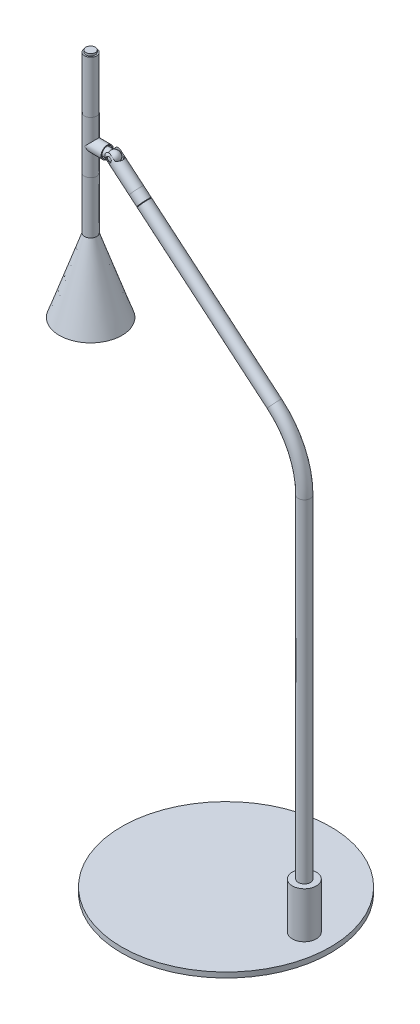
ISO-10303-21;
HEADER;
FILE_DESCRIPTION(('STEP AP214'),'2;1');
FILE_NAME('part.step','',(''),(''),'','','');
FILE_SCHEMA(('AUTOMOTIVE_DESIGN { 1 0 10303 214 1 1 1 1 }'));
ENDSEC;
DATA;
#1=APPLICATION_CONTEXT('core data for automotive mechanical design processes');
#2=APPLICATION_PROTOCOL_DEFINITION('international standard','automotive_design',2000,#1);
#3=PRODUCT_CONTEXT('',#1,'mechanical');
#4=PRODUCT('Part','Part','',(#3));
#5=PRODUCT_RELATED_PRODUCT_CATEGORY('part','',(#4));
#6=PRODUCT_DEFINITION_FORMATION('','',#4);
#7=PRODUCT_DEFINITION_CONTEXT('part definition',#1,'design');
#8=PRODUCT_DEFINITION('design','',#6,#7);
#9=PRODUCT_DEFINITION_SHAPE('','',#8);
#10=(LENGTH_UNIT() NAMED_UNIT(*) SI_UNIT(.MILLI.,.METRE.));
#11=(NAMED_UNIT(*) PLANE_ANGLE_UNIT() SI_UNIT($,.RADIAN.));
#12=(NAMED_UNIT(*) SI_UNIT($,.STERADIAN.) SOLID_ANGLE_UNIT());
#13=UNCERTAINTY_MEASURE_WITH_UNIT(LENGTH_MEASURE(1.E-05),#10,'distance_accuracy_value','');
#14=(GEOMETRIC_REPRESENTATION_CONTEXT(3) GLOBAL_UNCERTAINTY_ASSIGNED_CONTEXT((#13)) GLOBAL_UNIT_ASSIGNED_CONTEXT((#10,
#11,#12)) REPRESENTATION_CONTEXT('',''));
#15=CARTESIAN_POINT('',(0.,0.,0.));
#16=DIRECTION('',(0.,0.,1.));
#17=DIRECTION('',(1.,0.,0.));
#18=AXIS2_PLACEMENT_3D('',#15,#16,#17);
#19=CARTESIAN_POINT('',(-129.758853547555,582.63965191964,0.));
#20=DIRECTION('',(0.,-1.,0.));
#21=DIRECTION('',(-1.,0.,0.));
#22=AXIS2_PLACEMENT_3D('',#19,#20,#21);
#23=CYLINDRICAL_SURFACE('',#22,5.85);
#24=CARTESIAN_POINT('',(-129.758853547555,532.63965191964,0.));
#25=DIRECTION('',(0.,1.,0.));
#26=DIRECTION('',(1.,0.,0.));
#27=AXIS2_PLACEMENT_3D('',#24,#25,#26);
#28=CIRCLE('',#27,5.85);
#29=CARTESIAN_POINT('',(-123.908853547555,532.63965191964,0.));
#30=VERTEX_POINT('',#29);
#31=EDGE_CURVE('P0_E21',#30,#30,#28,.T.);
#32=ORIENTED_EDGE('',*,*,#31,.T.);
#33=EDGE_LOOP('',(#32));
#34=FACE_BOUND('',#33,.T.);
#35=CARTESIAN_POINT('',(-129.758853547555,582.63965191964,0.));
#36=DIRECTION('',(0.,1.,0.));
#37=DIRECTION('',(1.,0.,0.));
#38=AXIS2_PLACEMENT_3D('',#35,#36,#37);
#39=CIRCLE('',#38,5.85);
#40=CARTESIAN_POINT('',(-123.908853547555,582.63965191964,0.));
#41=VERTEX_POINT('',#40);
#42=EDGE_CURVE('P0_E11',#41,#41,#39,.T.);
#43=ORIENTED_EDGE('',*,*,#42,.F.);
#44=EDGE_LOOP('',(#43));
#45=FACE_BOUND('',#44,.T.);
#46=CARTESIAN_POINT('',(-129.758853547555,557.63965191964,0.));
#47=DIRECTION('',(0.707106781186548,0.707106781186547,0.));
#48=DIRECTION('',(0.707106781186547,-0.707106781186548,0.));
#49=AXIS2_PLACEMENT_3D('',#46,#47,#48);
#50=ELLIPSE('',#49,8.27314933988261,5.85);
#51=CARTESIAN_POINT('',(-129.758853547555,557.63965191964,5.85));
#52=VERTEX_POINT('',#51);
#53=CARTESIAN_POINT('',(-129.758853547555,557.63965191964,-5.85));
#54=VERTEX_POINT('',#53);
#55=EDGE_CURVE('P0_E33',#52,#54,#50,.T.);
#56=ORIENTED_EDGE('',*,*,#55,.F.);
#57=CARTESIAN_POINT('',(-129.758853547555,557.63965191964,0.));
#58=DIRECTION('',(0.707106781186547,-0.707106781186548,0.));
#59=DIRECTION('',(0.707106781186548,0.707106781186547,0.));
#60=AXIS2_PLACEMENT_3D('',#57,#58,#59);
#61=ELLIPSE('',#60,8.27314933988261,5.85);
#62=EDGE_CURVE('P0_E31',#54,#52,#61,.T.);
#63=ORIENTED_EDGE('',*,*,#62,.F.);
#64=EDGE_LOOP('',(#56,#63));
#65=FACE_BOUND('',#64,.T.);
#66=ADVANCED_FACE('P0_F17',(#34,#45,#65),#23,.T.);
#67=CARTESIAN_POINT('',(-129.758853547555,582.63965191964,0.));
#68=DIRECTION('',(0.,1.,0.));
#69=DIRECTION('',(1.,0.,0.));
#70=AXIS2_PLACEMENT_3D('',#67,#68,#69);
#71=PLANE('',#70);
#72=ORIENTED_EDGE('',*,*,#42,.T.);
#73=EDGE_LOOP('',(#72));
#74=FACE_BOUND('',#73,.T.);
#75=CARTESIAN_POINT('',(-129.758853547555,582.63965191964,0.));
#76=DIRECTION('',(0.,1.,0.));
#77=DIRECTION('',(1.,0.,0.));
#78=AXIS2_PLACEMENT_3D('',#75,#76,#77);
#79=CIRCLE('',#78,5.);
#80=CARTESIAN_POINT('',(-124.758853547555,582.63965191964,0.));
#81=VERTEX_POINT('',#80);
#82=EDGE_CURVE('P0_E143',#81,#81,#79,.T.);
#83=ORIENTED_EDGE('',*,*,#82,.F.);
#84=EDGE_LOOP('',(#83));
#85=FACE_BOUND('',#84,.T.);
#86=ADVANCED_FACE('P0_F68',(#74,#85),#71,.T.);
#87=CARTESIAN_POINT('',(-129.758853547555,532.63965191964,0.));
#88=DIRECTION('',(0.,1.,0.));
#89=DIRECTION('',(1.,0.,0.));
#90=AXIS2_PLACEMENT_3D('',#87,#88,#89);
#91=PLANE('',#90);
#92=ORIENTED_EDGE('',*,*,#31,.F.);
#93=EDGE_LOOP('',(#92));
#94=FACE_BOUND('',#93,.T.);
#95=CARTESIAN_POINT('',(-129.758853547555,532.63965191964,0.));
#96=DIRECTION('',(0.,1.,0.));
#97=DIRECTION('',(1.,0.,0.));
#98=AXIS2_PLACEMENT_3D('',#95,#96,#97);
#99=CIRCLE('',#98,5.);
#100=CARTESIAN_POINT('',(-124.758853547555,532.63965191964,0.));
#101=VERTEX_POINT('',#100);
#102=EDGE_CURVE('P0_E144',#101,#101,#99,.T.);
#103=ORIENTED_EDGE('',*,*,#102,.T.);
#104=EDGE_LOOP('',(#103));
#105=FACE_BOUND('',#104,.T.);
#106=ADVANCED_FACE('P0_F66',(#94,#105),#91,.F.);
#107=CARTESIAN_POINT('',(-129.758853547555,582.63965191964,0.));
#108=DIRECTION('',(0.,-1.,0.));
#109=DIRECTION('',(-1.,0.,0.));
#110=AXIS2_PLACEMENT_3D('',#107,#108,#109);
#111=CYLINDRICAL_SURFACE('',#110,5.);
#112=ORIENTED_EDGE('',*,*,#82,.T.);
#113=EDGE_LOOP('',(#112));
#114=FACE_BOUND('',#113,.T.);
#115=ORIENTED_EDGE('',*,*,#102,.F.);
#116=EDGE_LOOP('',(#115));
#117=FACE_BOUND('',#116,.T.);
#118=ADVANCED_FACE('P0_F59',(#114,#117),#111,.F.);
#119=CARTESIAN_POINT('',(-113.908853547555,557.63965191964,0.));
#120=DIRECTION('',(1.,0.,0.));
#121=DIRECTION('',(0.,0.,-1.));
#122=AXIS2_PLACEMENT_3D('',#119,#120,#121);
#123=PLANE('',#122);
#124=CARTESIAN_POINT('',(-113.908853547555,557.63965191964,0.));
#125=DIRECTION('',(1.,0.,0.));
#126=DIRECTION('',(0.,0.,-1.));
#127=AXIS2_PLACEMENT_3D('',#124,#125,#126);
#128=CIRCLE('',#127,5.85);
#129=CARTESIAN_POINT('',(-113.908853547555,557.63965191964,-5.85));
#130=VERTEX_POINT('',#129);
#131=EDGE_CURVE('P0_E147',#130,#130,#128,.T.);
#132=ORIENTED_EDGE('',*,*,#131,.T.);
#133=EDGE_LOOP('',(#132));
#134=FACE_BOUND('',#133,.T.);
#135=CARTESIAN_POINT('',(-113.908853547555,557.63965191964,0.));
#136=DIRECTION('',(1.,0.,0.));
#137=DIRECTION('',(0.,0.,-1.));
#138=AXIS2_PLACEMENT_3D('',#135,#136,#137);
#139=CIRCLE('',#138,5.);
#140=CARTESIAN_POINT('',(-113.908853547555,557.63965191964,-5.00000000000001));
#141=VERTEX_POINT('',#140);
#142=EDGE_CURVE('P0_E35',#141,#141,#139,.T.);
#143=ORIENTED_EDGE('',*,*,#142,.F.);
#144=EDGE_LOOP('',(#143));
#145=FACE_BOUND('',#144,.T.);
#146=ADVANCED_FACE('P0_F56',(#134,#145),#123,.T.);
#147=CARTESIAN_POINT('',(-113.908853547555,557.63965191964,0.));
#148=DIRECTION('',(-1.,0.,0.));
#149=DIRECTION('',(0.,0.,1.));
#150=AXIS2_PLACEMENT_3D('',#147,#148,#149);
#151=CYLINDRICAL_SURFACE('',#150,5.85);
#152=ORIENTED_EDGE('',*,*,#131,.F.);
#153=EDGE_LOOP('',(#152));
#154=FACE_BOUND('',#153,.T.);
#155=ORIENTED_EDGE('',*,*,#62,.T.);
#156=ORIENTED_EDGE('',*,*,#55,.T.);
#157=EDGE_LOOP('',(#155,#156));
#158=FACE_BOUND('',#157,.T.);
#159=ADVANCED_FACE('P0_F37',(#154,#158),#151,.T.);
#160=CARTESIAN_POINT('',(-113.908853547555,557.63965191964,0.));
#161=DIRECTION('',(-1.,0.,0.));
#162=DIRECTION('',(0.,0.,1.));
#163=AXIS2_PLACEMENT_3D('',#160,#161,#162);
#164=CYLINDRICAL_SURFACE('',#163,5.);
#165=ORIENTED_EDGE('',*,*,#142,.T.);
#166=EDGE_LOOP('',(#165));
#167=FACE_BOUND('',#166,.T.);
#168=CARTESIAN_POINT('',(-126.721996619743,557.63965191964,-5.00000000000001));
#169=CARTESIAN_POINT('',(-126.721993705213,557.72410819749,-4.99999890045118));
#170=CARTESIAN_POINT('',(-126.718451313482,557.808581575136,-4.99785243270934));
#171=CARTESIAN_POINT('',(-126.704498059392,557.976757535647,-4.98933577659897));
#172=CARTESIAN_POINT('',(-126.694083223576,558.060459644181,-4.98296314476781));
#173=CARTESIAN_POINT('',(-126.653251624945,558.309776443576,-4.95770067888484));
#174=CARTESIAN_POINT('',(-126.613251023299,558.473279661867,-4.93266721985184));
#175=CARTESIAN_POINT('',(-126.528987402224,558.744691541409,-4.87772143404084));
#176=CARTESIAN_POINT('',(-126.489370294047,558.854906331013,-4.85136160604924));
#177=CARTESIAN_POINT('',(-126.403136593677,559.070768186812,-4.79211920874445));
#178=CARTESIAN_POINT('',(-126.356518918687,559.176414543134,-4.75923563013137));
#179=CARTESIAN_POINT('',(-126.258111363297,559.383509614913,-4.68732620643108));
#180=CARTESIAN_POINT('',(-126.206305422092,559.484943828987,-4.64828105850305));
#181=CARTESIAN_POINT('',(-126.099244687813,559.683474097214,-4.56447051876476));
#182=CARTESIAN_POINT('',(-126.04399070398,559.780571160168,-4.51970646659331));
#183=CARTESIAN_POINT('',(-125.902359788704,560.019464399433,-4.40026953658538));
#184=CARTESIAN_POINT('',(-125.814555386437,560.15864372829,-4.32203235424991));
#185=CARTESIAN_POINT('',(-125.637184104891,560.428186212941,-4.15323558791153));
#186=CARTESIAN_POINT('',(-125.547616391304,560.558545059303,-4.06267004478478));
#187=CARTESIAN_POINT('',(-125.369354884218,560.81031185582,-3.86937530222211));
#188=CARTESIAN_POINT('',(-125.280660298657,560.931728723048,-3.7666584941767));
#189=CARTESIAN_POINT('',(-125.106274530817,561.165272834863,-3.54900947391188));
#190=CARTESIAN_POINT('',(-125.020582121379,561.277403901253,-3.43408233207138));
#191=CARTESIAN_POINT('',(-124.807852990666,561.551299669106,-3.12447262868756));
#192=CARTESIAN_POINT('',(-124.684302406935,561.706020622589,-2.92095900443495));
#193=CARTESIAN_POINT('',(-124.45716102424,561.986156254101,-2.48492369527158));
#194=CARTESIAN_POINT('',(-124.353537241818,562.111619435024,-2.25245101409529));
#195=CARTESIAN_POINT('',(-124.190344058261,562.307431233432,-1.8055551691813));
#196=CARTESIAN_POINT('',(-124.126201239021,562.383636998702,-1.59542535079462));
#197=CARTESIAN_POINT('',(-124.047312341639,562.47695176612,-1.27016143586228));
#198=CARTESIAN_POINT('',(-124.023899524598,562.504562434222,-1.16003010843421));
#199=CARTESIAN_POINT('',(-123.98328247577,562.552378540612,-0.937065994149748));
#200=CARTESIAN_POINT('',(-123.966075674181,562.57258704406,-0.824234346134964));
#201=CARTESIAN_POINT('',(-123.938161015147,562.605337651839,-0.596084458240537));
#202=CARTESIAN_POINT('',(-123.927486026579,562.617840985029,-0.480756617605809));
#203=CARTESIAN_POINT('',(-123.913006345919,562.634794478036,-0.249076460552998));
#204=CARTESIAN_POINT('',(-123.909201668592,562.639244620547,-0.132724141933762));
#205=CARTESIAN_POINT('',(-123.908551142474,562.640005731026,0.100017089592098));
#206=CARTESIAN_POINT('',(-123.911704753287,562.636317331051,0.21640599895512));
#207=CARTESIAN_POINT('',(-123.924896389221,562.620873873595,0.448247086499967));
#208=CARTESIAN_POINT('',(-123.934934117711,562.609119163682,0.563699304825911));
#209=CARTESIAN_POINT('',(-123.960647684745,562.578958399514,0.783995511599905));
#210=CARTESIAN_POINT('',(-123.975834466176,562.561128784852,0.888976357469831));
#211=CARTESIAN_POINT('',(-124.011607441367,562.519043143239,1.09671866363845));
#212=CARTESIAN_POINT('',(-124.032195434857,562.494784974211,1.19947937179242));
#213=CARTESIAN_POINT('',(-124.10154545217,562.412857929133,1.50348095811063));
#214=CARTESIAN_POINT('',(-124.157914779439,562.346011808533,1.70061655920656));
#215=CARTESIAN_POINT('',(-124.29251489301,562.185029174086,2.09485798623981));
#216=CARTESIAN_POINT('',(-124.372098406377,562.089182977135,2.29078435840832));
#217=CARTESIAN_POINT('',(-124.546389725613,561.876514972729,2.66366388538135));
#218=CARTESIAN_POINT('',(-124.641108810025,561.759677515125,2.84060272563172));
#219=CARTESIAN_POINT('',(-124.816283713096,561.539619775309,3.13287210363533));
#220=CARTESIAN_POINT('',(-124.894415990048,561.440256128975,3.25257077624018));
#221=CARTESIAN_POINT('',(-125.054966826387,561.232479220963,3.48071746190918));
#222=CARTESIAN_POINT('',(-125.137385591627,561.124065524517,3.58916493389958));
#223=CARTESIAN_POINT('',(-125.304908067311,560.898614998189,3.79506631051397));
#224=CARTESIAN_POINT('',(-125.390017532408,560.781558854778,3.89249428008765));
#225=CARTESIAN_POINT('',(-125.560807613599,560.539389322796,4.07610244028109));
#226=CARTESIAN_POINT('',(-125.646488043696,560.414278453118,4.16228612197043));
#227=CARTESIAN_POINT('',(-125.797895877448,560.183765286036,4.30601265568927));
#228=CARTESIAN_POINT('',(-125.863946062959,560.079922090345,4.36572617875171));
#229=CARTESIAN_POINT('',(-125.993680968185,559.867017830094,4.47809502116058));
#230=CARTESIAN_POINT('',(-126.057365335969,559.757955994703,4.53074929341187));
#231=CARTESIAN_POINT('',(-126.18049099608,559.534604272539,4.62860510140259));
#232=CARTESIAN_POINT('',(-126.239942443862,559.420328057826,4.67382484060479));
#233=CARTESIAN_POINT('',(-126.352497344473,559.186035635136,4.75648123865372));
#234=CARTESIAN_POINT('',(-126.405604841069,559.066023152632,4.79392286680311));
#235=CARTESIAN_POINT('',(-126.513084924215,558.793519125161,4.86750164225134));
#236=CARTESIAN_POINT('',(-126.565279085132,558.639588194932,4.90163119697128));
#237=CARTESIAN_POINT('',(-126.649524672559,558.323934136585,4.95551895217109));
#238=CARTESIAN_POINT('',(-126.681627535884,558.162232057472,4.97531387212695));
#239=CARTESIAN_POINT('',(-126.710589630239,557.915778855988,4.99306392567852));
#240=CARTESIAN_POINT('',(-126.717026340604,557.832507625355,4.99697813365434));
#241=CARTESIAN_POINT('',(-126.723026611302,557.665610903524,5.00062758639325));
#242=CARTESIAN_POINT('',(-126.72259056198,557.581985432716,5.00036306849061));
#243=CARTESIAN_POINT('',(-126.71485095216,557.415131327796,4.99565466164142));
#244=CARTESIAN_POINT('',(-126.707543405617,557.331902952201,4.99120834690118));
#245=CARTESIAN_POINT('',(-126.686462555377,557.166558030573,4.97825926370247));
#246=CARTESIAN_POINT('',(-126.672685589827,557.084442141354,4.96975419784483));
#247=CARTESIAN_POINT('',(-126.636224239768,556.906690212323,4.94694127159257));
#248=CARTESIAN_POINT('',(-126.612355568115,556.811399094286,4.93184544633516));
#249=CARTESIAN_POINT('',(-126.557826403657,556.623704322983,4.89662975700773));
#250=CARTESIAN_POINT('',(-126.527160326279,556.531303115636,4.87650576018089));
#251=CARTESIAN_POINT('',(-126.426936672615,556.258368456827,4.80908079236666));
#252=CARTESIAN_POINT('',(-126.349250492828,556.082520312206,4.7547832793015));
#253=CARTESIAN_POINT('',(-126.195634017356,555.771746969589,4.64042986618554));
#254=CARTESIAN_POINT('',(-126.121587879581,555.634899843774,4.58286058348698));
#255=CARTESIAN_POINT('',(-125.968514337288,555.368972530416,4.45708885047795));
#256=CARTESIAN_POINT('',(-125.889483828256,555.239897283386,4.38887973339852));
#257=CARTESIAN_POINT('',(-125.729097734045,554.989041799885,4.24210027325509));
#258=CARTESIAN_POINT('',(-125.647739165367,554.867271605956,4.16351612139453));
#259=CARTESIAN_POINT('',(-125.484895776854,554.631077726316,3.99617535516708));
#260=CARTESIAN_POINT('',(-125.403410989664,554.516652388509,3.90742104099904));
#261=CARTESIAN_POINT('',(-125.238182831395,554.289985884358,3.71521945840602));
#262=CARTESIAN_POINT('',(-125.154517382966,554.178109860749,3.61127298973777));
#263=CARTESIAN_POINT('',(-124.990738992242,553.963068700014,3.39209530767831));
#264=CARTESIAN_POINT('',(-124.910626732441,553.859905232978,3.27686193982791));
#265=CARTESIAN_POINT('',(-124.755923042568,553.66341378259,3.0354038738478));
#266=CARTESIAN_POINT('',(-124.68131838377,553.570061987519,2.90920721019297));
#267=CARTESIAN_POINT('',(-124.539256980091,553.394139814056,2.6458875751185));
#268=CARTESIAN_POINT('',(-124.471796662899,553.311564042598,2.5087701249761));
#269=CARTESIAN_POINT('',(-124.321584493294,553.129105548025,2.1690836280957));
#270=CARTESIAN_POINT('',(-124.242901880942,553.034745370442,1.96159315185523));
#271=CARTESIAN_POINT('',(-124.141596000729,552.91402514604,1.63761723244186));
#272=CARTESIAN_POINT('',(-124.110608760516,552.877249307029,1.52747637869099));
#273=CARTESIAN_POINT('',(-124.054757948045,552.811140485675,1.3034894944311));
#274=CARTESIAN_POINT('',(-124.029891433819,552.781803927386,1.18964527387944));
#275=CARTESIAN_POINT('',(-123.986639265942,552.730870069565,0.958130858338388));
#276=CARTESIAN_POINT('',(-123.968301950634,552.709330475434,0.84043889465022));
#277=CARTESIAN_POINT('',(-123.938782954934,552.674694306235,0.602978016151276));
#278=CARTESIAN_POINT('',(-123.927598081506,552.661593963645,0.483210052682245));
#279=CARTESIAN_POINT('',(-123.912642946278,552.644083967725,0.242590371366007));
#280=CARTESIAN_POINT('',(-123.908871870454,552.639673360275,0.121738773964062));
#281=CARTESIAN_POINT('',(-123.908835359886,552.639630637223,-0.119959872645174));
#282=CARTESIAN_POINT('',(-123.912569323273,552.643997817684,-0.240806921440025));
#283=CARTESIAN_POINT('',(-123.92668228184,552.660521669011,-0.469004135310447));
#284=CARTESIAN_POINT('',(-123.936336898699,552.67182930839,-0.576461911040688));
#285=CARTESIAN_POINT('',(-123.961412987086,552.701243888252,-0.789771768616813));
#286=CARTESIAN_POINT('',(-123.976836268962,552.719352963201,-0.8956233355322));
#287=CARTESIAN_POINT('',(-124.031358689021,552.783498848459,-1.20967165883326));
#288=CARTESIAN_POINT('',(-124.07872241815,552.839368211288,-1.41454566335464));
#289=CARTESIAN_POINT('',(-124.19431835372,552.976716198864,-1.81772008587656));
#290=CARTESIAN_POINT('',(-124.263230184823,553.05903166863,-2.01553077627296));
#291=CARTESIAN_POINT('',(-124.417240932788,553.244990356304,-2.39404021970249));
#292=CARTESIAN_POINT('',(-124.502344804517,553.348640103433,-2.57473370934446));
#293=CARTESIAN_POINT('',(-124.660948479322,553.54471198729,-2.87307571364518));
#294=CARTESIAN_POINT('',(-124.731728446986,553.633067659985,-2.99491628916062));
#295=CARTESIAN_POINT('',(-124.878360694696,553.81866353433,-3.22835507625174));
#296=CARTESIAN_POINT('',(-124.954213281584,553.915904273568,-3.33995266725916));
#297=CARTESIAN_POINT('',(-125.10971795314,554.118823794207,-3.55324123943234));
#298=CARTESIAN_POINT('',(-125.189382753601,554.224531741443,-3.65489504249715));
#299=CARTESIAN_POINT('',(-125.350665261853,554.443542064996,-3.84788027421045));
#300=CARTESIAN_POINT('',(-125.432282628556,554.556843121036,-3.93921349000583));
#301=CARTESIAN_POINT('',(-125.597396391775,554.793158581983,-4.1133255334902));
#302=CARTESIAN_POINT('',(-125.680897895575,554.916321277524,-4.19589827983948));
#303=CARTESIAN_POINT('',(-125.846062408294,555.170484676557,-4.35032695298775));
#304=CARTESIAN_POINT('',(-125.927724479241,555.301489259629,-4.42217751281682));
#305=CARTESIAN_POINT('',(-126.086134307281,555.571258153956,-4.5545847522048));
#306=CARTESIAN_POINT('',(-126.16289803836,555.709994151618,-4.61517951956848));
#307=CARTESIAN_POINT('',(-126.307966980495,555.996078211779,-4.72462865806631));
#308=CARTESIAN_POINT('',(-126.376282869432,556.14341504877,-4.77349792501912));
#309=CARTESIAN_POINT('',(-126.500405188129,556.450160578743,-4.85909614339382));
#310=CARTESIAN_POINT('',(-126.555975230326,556.60973379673,-4.89560088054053));
#311=CARTESIAN_POINT('',(-126.623297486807,556.855188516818,-4.93877530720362));
#312=CARTESIAN_POINT('',(-126.643048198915,556.93789228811,-4.95122616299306));
#313=CARTESIAN_POINT('',(-126.676380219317,557.105022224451,-4.97204655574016));
#314=CARTESIAN_POINT('',(-126.68996550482,557.189447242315,-4.9804187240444));
#315=CARTESIAN_POINT('',(-126.707335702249,557.334902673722,-4.9910728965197));
#316=CARTESIAN_POINT('',(-126.712817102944,557.395657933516,-4.9944149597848));
#317=CARTESIAN_POINT('',(-126.720149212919,557.517489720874,-4.99887927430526));
#318=CARTESIAN_POINT('',(-126.721998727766,557.57856634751,-5.00000079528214));
#319=CARTESIAN_POINT('',(-126.721996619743,557.63965191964,-5.00000000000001));
#320=B_SPLINE_CURVE_WITH_KNOTS('',3,(#168,#169,#170,#171,#172,#173,#174,#175,#176,#177,#178,
#179,#180,#181,#182,#183,#184,#185,#186,#187,#188,#189,#190,#191,#192,#193,#194,#195,#196,#197,
#198,#199,#200,#201,#202,#203,#204,#205,#206,#207,#208,#209,#210,#211,#212,#213,#214,#215,#216,
#217,#218,#219,#220,#221,#222,#223,#224,#225,#226,#227,#228,#229,#230,#231,#232,#233,#234,#235,
#236,#237,#238,#239,#240,#241,#242,#243,#244,#245,#246,#247,#248,#249,#250,#251,#252,#253,#254,
#255,#256,#257,#258,#259,#260,#261,#262,#263,#264,#265,#266,#267,#268,#269,#270,#271,#272,#273,
#274,#275,#276,#277,#278,#279,#280,#281,#282,#283,#284,#285,#286,#287,#288,#289,#290,#291,#292,
#293,#294,#295,#296,#297,#298,#299,#300,#301,#302,#303,#304,#305,#306,#307,#308,#309,#310,#311,
#312,#313,#314,#315,#316,#317,#318,#319),.UNSPECIFIED.,.T.,.F.,(4,2,2,2,2,2,2,2,2,2,2,2,2,2,2,2,
2,2,2,2,2,2,2,2,2,2,2,2,2,2,2,2,2,2,2,2,2,2,2,2,2,2,2,2,2,2,2,2,2,2,2,2,2,2,2,2,2,2,2,2,2,2,2,2,
2,2,2,2,2,2,2,2,2,2,2,4),(0.,0.253292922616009,0.506732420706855,1.01456233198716,
1.37427744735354,1.73404825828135,2.09496938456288,2.45580612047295,3.00171632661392,
3.54789135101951,4.09351413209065,4.63891122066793,5.48737679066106,6.33442563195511,
7.02887485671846,7.37629152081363,7.72356416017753,8.07257024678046,8.42157708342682,
8.77055681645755,9.1195215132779,9.44183914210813,9.76426430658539,10.4085858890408,
11.1026968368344,11.7973274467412,12.3189440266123,12.8405856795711,13.3634305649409,
13.886112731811,14.2962162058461,14.7063804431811,15.1155249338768,15.5244072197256,
16.0211143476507,16.5165445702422,16.7670377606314,17.0175167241,17.2681410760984,
17.5189074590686,17.816591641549,18.1145213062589,18.7116585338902,19.2088076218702,
19.7062694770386,20.2044002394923,20.7024185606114,21.2242154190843,21.7461120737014,
22.2667113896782,22.7870491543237,23.5071076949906,23.8672947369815,24.2273083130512,
24.5899343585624,24.9523984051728,25.3148226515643,25.6772178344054,26.002270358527,
26.327424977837,26.9771873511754,27.6499600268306,28.322938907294,28.8212761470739,
29.3196435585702,29.8198082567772,30.3198862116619,30.8299025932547,31.3401734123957,
31.8486847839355,32.3565466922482,32.8731784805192,33.1307128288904,33.3880808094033,
33.5712224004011,33.7544242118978),.UNSPECIFIED.);
#321=CARTESIAN_POINT('',(-126.721996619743,557.63965191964,-5.00000000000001));
#322=VERTEX_POINT('',#321);
#323=EDGE_CURVE('P0_E38',#322,#322,#320,.T.);
#324=ORIENTED_EDGE('',*,*,#323,.F.);
#325=EDGE_LOOP('',(#324));
#326=FACE_BOUND('',#325,.T.);
#327=ADVANCED_FACE('P0_F52',(#167,#326),#164,.F.);
#328=ORIENTED_EDGE('',*,*,#323,.T.);
#329=EDGE_LOOP('',(#328));
#330=FACE_BOUND('',#329,.T.);
#331=ADVANCED_FACE('P0_F19',(#330),#23,.T.);
#332=CLOSED_SHELL('',(#66,#86,#106,#118,#146,#159,#327,#331));
#333=MANIFOLD_SOLID_BREP('P0_B1',#332);
#334=CARTESIAN_POINT('',(-129.758853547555,634.63965191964,0.));
#335=DIRECTION('',(0.,-1.,0.));
#336=DIRECTION('',(0.487164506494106,0.,0.873310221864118));
#337=AXIS2_PLACEMENT_3D('',#334,#335,#336);
#338=CYLINDRICAL_SURFACE('',#337,4.5);
#339=CARTESIAN_POINT('',(-129.758853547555,634.63965191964,0.));
#340=DIRECTION('',(0.,1.,0.));
#341=DIRECTION('',(-0.487164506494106,0.,-0.873310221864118));
#342=AXIS2_PLACEMENT_3D('',#339,#340,#341);
#343=CIRCLE('',#342,4.5);
#344=CARTESIAN_POINT('',(-131.951093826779,634.63965191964,-3.92989599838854));
#345=VERTEX_POINT('',#344);
#346=EDGE_CURVE('P1_E10',#345,#345,#343,.T.);
#347=ORIENTED_EDGE('',*,*,#346,.F.);
#348=EDGE_LOOP('',(#347));
#349=FACE_BOUND('',#348,.T.);
#350=CARTESIAN_POINT('',(-129.758853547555,632.63965191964,0.));
#351=DIRECTION('',(0.,1.,0.));
#352=DIRECTION('',(-0.487164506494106,0.,-0.873310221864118));
#353=AXIS2_PLACEMENT_3D('',#350,#351,#352);
#354=CIRCLE('',#353,4.5);
#355=CARTESIAN_POINT('',(-131.951093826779,632.63965191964,-3.92989599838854));
#356=VERTEX_POINT('',#355);
#357=EDGE_CURVE('P1_E18',#356,#356,#354,.T.);
#358=ORIENTED_EDGE('',*,*,#357,.T.);
#359=EDGE_LOOP('',(#358));
#360=FACE_BOUND('',#359,.T.);
#361=ADVANCED_FACE('P1_F15',(#349,#360),#338,.T.);
#362=CARTESIAN_POINT('',(-129.758853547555,634.63965191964,0.));
#363=DIRECTION('',(0.,1.,0.));
#364=DIRECTION('',(-0.487164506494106,0.,-0.873310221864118));
#365=AXIS2_PLACEMENT_3D('',#362,#363,#364);
#366=PLANE('',#365);
#367=ORIENTED_EDGE('',*,*,#346,.T.);
#368=EDGE_LOOP('',(#367));
#369=FACE_BOUND('',#368,.T.);
#370=ADVANCED_FACE('P1_F30',(#369),#366,.T.);
#371=CARTESIAN_POINT('',(-129.758853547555,632.63965191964,0.));
#372=DIRECTION('',(0.,1.,0.));
#373=DIRECTION('',(-0.487164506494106,0.,-0.873310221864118));
#374=AXIS2_PLACEMENT_3D('',#371,#372,#373);
#375=PLANE('',#374);
#376=ORIENTED_EDGE('',*,*,#357,.F.);
#377=EDGE_LOOP('',(#376));
#378=FACE_BOUND('',#377,.T.);
#379=ADVANCED_FACE('P1_F28',(#378),#375,.F.);
#380=CLOSED_SHELL('',(#361,#370,#379));
#381=MANIFOLD_SOLID_BREP('P1_B1',#380);
#382=CARTESIAN_POINT('',(-129.758853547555,632.63965191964,0.));
#383=DIRECTION('',(0.,-1.,0.));
#384=DIRECTION('',(0.487164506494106,0.,0.873310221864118));
#385=AXIS2_PLACEMENT_3D('',#382,#383,#384);
#386=CYLINDRICAL_SURFACE('',#385,5.85);
#387=CARTESIAN_POINT('',(-129.758853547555,632.63965191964,0.));
#388=DIRECTION('',(0.,1.,0.));
#389=DIRECTION('',(-0.487164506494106,0.,-0.873310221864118));
#390=AXIS2_PLACEMENT_3D('',#387,#388,#389);
#391=CIRCLE('',#390,5.85);
#392=CARTESIAN_POINT('',(-132.608765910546,632.63965191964,-5.1088647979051));
#393=VERTEX_POINT('',#392);
#394=EDGE_CURVE('P2_E10',#393,#393,#391,.T.);
#395=ORIENTED_EDGE('',*,*,#394,.F.);
#396=EDGE_LOOP('',(#395));
#397=FACE_BOUND('',#396,.T.);
#398=CARTESIAN_POINT('',(-129.758853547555,582.63965191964,0.));
#399=DIRECTION('',(0.,1.,0.));
#400=DIRECTION('',(-0.487164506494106,0.,-0.873310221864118));
#401=AXIS2_PLACEMENT_3D('',#398,#399,#400);
#402=CIRCLE('',#401,5.85);
#403=CARTESIAN_POINT('',(-132.608765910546,582.63965191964,-5.1088647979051));
#404=VERTEX_POINT('',#403);
#405=EDGE_CURVE('P2_E18',#404,#404,#402,.T.);
#406=ORIENTED_EDGE('',*,*,#405,.T.);
#407=EDGE_LOOP('',(#406));
#408=FACE_BOUND('',#407,.T.);
#409=ADVANCED_FACE('P2_F15',(#397,#408),#386,.T.);
#410=CARTESIAN_POINT('',(-129.758853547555,632.63965191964,0.));
#411=DIRECTION('',(0.,1.,0.));
#412=DIRECTION('',(-0.487164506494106,0.,-0.873310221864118));
#413=AXIS2_PLACEMENT_3D('',#410,#411,#412);
#414=PLANE('',#413);
#415=ORIENTED_EDGE('',*,*,#394,.T.);
#416=EDGE_LOOP('',(#415));
#417=FACE_BOUND('',#416,.T.);
#418=ADVANCED_FACE('P2_F30',(#417),#414,.T.);
#419=CARTESIAN_POINT('',(-129.758853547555,582.63965191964,0.));
#420=DIRECTION('',(0.,1.,0.));
#421=DIRECTION('',(-0.487164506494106,0.,-0.873310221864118));
#422=AXIS2_PLACEMENT_3D('',#419,#420,#421);
#423=PLANE('',#422);
#424=ORIENTED_EDGE('',*,*,#405,.F.);
#425=EDGE_LOOP('',(#424));
#426=FACE_BOUND('',#425,.T.);
#427=ADVANCED_FACE('P2_F28',(#426),#423,.F.);
#428=CLOSED_SHELL('',(#409,#418,#427));
#429=MANIFOLD_SOLID_BREP('P2_B1',#428);
#430=CARTESIAN_POINT('',(-129.758853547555,532.639651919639,0.));
#431=DIRECTION('',(0.,-1.,0.));
#432=DIRECTION('',(0.226403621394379,0.,-0.974033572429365));
#433=AXIS2_PLACEMENT_3D('',#430,#431,#432);
#434=CYLINDRICAL_SURFACE('',#433,5.85);
#435=CARTESIAN_POINT('',(-129.758853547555,532.639651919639,0.));
#436=DIRECTION('',(0.,1.,0.));
#437=DIRECTION('',(-0.226403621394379,0.,0.974033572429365));
#438=AXIS2_PLACEMENT_3D('',#435,#436,#437);
#439=CIRCLE('',#438,5.85);
#440=CARTESIAN_POINT('',(-131.083314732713,532.639651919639,5.69809639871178));
#441=VERTEX_POINT('',#440);
#442=EDGE_CURVE('P3_E9',#441,#441,#439,.T.);
#443=ORIENTED_EDGE('',*,*,#442,.F.);
#444=EDGE_LOOP('',(#443));
#445=FACE_BOUND('',#444,.T.);
#446=CARTESIAN_POINT('',(-129.758853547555,482.639651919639,0.));
#447=DIRECTION('',(0.,1.,0.));
#448=DIRECTION('',(-0.226403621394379,0.,0.974033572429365));
#449=AXIS2_PLACEMENT_3D('',#446,#447,#448);
#450=CIRCLE('',#449,5.85);
#451=CARTESIAN_POINT('',(-131.083314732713,482.639651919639,5.69809639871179));
#452=VERTEX_POINT('',#451);
#453=EDGE_CURVE('P3_E17',#452,#452,#450,.T.);
#454=ORIENTED_EDGE('',*,*,#453,.T.);
#455=EDGE_LOOP('',(#454));
#456=FACE_BOUND('',#455,.T.);
#457=ADVANCED_FACE('P3_F14',(#445,#456),#434,.T.);
#458=CARTESIAN_POINT('',(-129.758853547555,532.639651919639,0.));
#459=DIRECTION('',(0.,1.,0.));
#460=DIRECTION('',(-0.226403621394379,0.,0.974033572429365));
#461=AXIS2_PLACEMENT_3D('',#458,#459,#460);
#462=PLANE('',#461);
#463=ORIENTED_EDGE('',*,*,#442,.T.);
#464=EDGE_LOOP('',(#463));
#465=FACE_BOUND('',#464,.T.);
#466=ADVANCED_FACE('P3_F29',(#465),#462,.T.);
#467=CARTESIAN_POINT('',(-129.758853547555,482.639651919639,0.));
#468=DIRECTION('',(0.,1.,0.));
#469=DIRECTION('',(-0.226403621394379,0.,0.974033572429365));
#470=AXIS2_PLACEMENT_3D('',#467,#468,#469);
#471=PLANE('',#470);
#472=ORIENTED_EDGE('',*,*,#453,.F.);
#473=EDGE_LOOP('',(#472));
#474=FACE_BOUND('',#473,.T.);
#475=ADVANCED_FACE('P3_F27',(#474),#471,.F.);
#476=CLOSED_SHELL('',(#457,#466,#475));
#477=MANIFOLD_SOLID_BREP('P3_B1',#476);
#478=CARTESIAN_POINT('',(-108.084621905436,558.626238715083,0.));
#479=DIRECTION('',(-0.766044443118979,0.642787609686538,0.));
#480=DIRECTION('',(0.,0.,1.));
#481=AXIS2_PLACEMENT_3D('',#478,#479,#480);
#482=DEGENERATE_TOROIDAL_SURFACE('',#481,0.849999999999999,5.,.T.);
#483=CARTESIAN_POINT('',(-106.815906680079,560.137923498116,5.50705645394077));
#484=CARTESIAN_POINT('',(-106.884333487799,560.14047670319,5.52212372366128));
#485=CARTESIAN_POINT('',(-106.95300947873,560.140209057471,5.53654114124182));
#486=CARTESIAN_POINT('',(-107.09037640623,560.133999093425,5.56405002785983));
#487=CARTESIAN_POINT('',(-107.159067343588,560.128056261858,5.57714137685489));
#488=CARTESIAN_POINT('',(-107.295973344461,560.11046181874,5.60197008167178));
#489=CARTESIAN_POINT('',(-107.364188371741,560.098809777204,5.61370733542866));
#490=CARTESIAN_POINT('',(-107.499607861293,560.069839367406,5.63580410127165));
#491=CARTESIAN_POINT('',(-107.566812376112,560.052521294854,5.64616368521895));
#492=CARTESIAN_POINT('',(-107.766323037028,559.992101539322,5.67517590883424));
#493=CARTESIAN_POINT('',(-107.896488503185,559.940539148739,5.69175524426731));
#494=CARTESIAN_POINT('',(-108.146725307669,559.816165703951,5.71926907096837));
#495=CARTESIAN_POINT('',(-108.266801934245,559.743365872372,5.73020653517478));
#496=CARTESIAN_POINT('',(-108.491537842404,559.579783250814,5.74633152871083));
#497=CARTESIAN_POINT('',(-108.596411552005,559.489304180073,5.75160755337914));
#498=CARTESIAN_POINT('',(-108.789868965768,559.29218236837,5.75672046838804));
#499=CARTESIAN_POINT('',(-108.878449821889,559.185536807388,5.75655640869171));
#500=CARTESIAN_POINT('',(-109.036009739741,558.960231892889,5.7508143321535));
#501=CARTESIAN_POINT('',(-109.105161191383,558.841691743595,5.74528600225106));
#502=CARTESIAN_POINT('',(-109.223063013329,558.595211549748,5.72887967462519));
#503=CARTESIAN_POINT('',(-109.271813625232,558.467271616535,5.71800174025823));
#504=CARTESIAN_POINT('',(-109.347842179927,558.20533362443,5.69086698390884));
#505=CARTESIAN_POINT('',(-109.375058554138,558.071319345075,5.6745949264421));
#506=CARTESIAN_POINT('',(-109.407306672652,557.801423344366,5.63672511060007));
#507=CARTESIAN_POINT('',(-109.412351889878,557.665542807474,5.61513059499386));
#508=CARTESIAN_POINT('',(-109.403415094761,557.460375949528,5.57835064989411));
#509=CARTESIAN_POINT('',(-109.397377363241,557.390313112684,5.56503770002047));
#510=CARTESIAN_POINT('',(-109.379505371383,557.251356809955,5.53705936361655));
#511=CARTESIAN_POINT('',(-109.367683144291,557.182461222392,5.52239683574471));
#512=CARTESIAN_POINT('',(-109.353030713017,557.114296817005,5.50705645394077));
#513=B_SPLINE_CURVE_WITH_KNOTS('',3,(#483,#484,#485,#486,#487,#488,#489,#490,#491,#492,#493,
#494,#495,#496,#497,#498,#499,#500,#501,#502,#503,#504,#505,#506,#507,#508,#509,#510,#511,#512),
.UNSPECIFIED.,.F.,.F.,(4,2,2,2,2,2,2,2,2,2,2,2,2,2,4),(0.,0.21027826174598,0.420575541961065,
0.630888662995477,0.841190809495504,1.26190972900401,1.68240672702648,2.09623055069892,
2.51012664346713,2.92022523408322,3.33031896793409,3.74158100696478,4.15259309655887,
4.36708305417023,4.58112870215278),.UNSPECIFIED.);
#514=CARTESIAN_POINT('',(-106.816159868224,560.137932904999,5.50711219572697));
#515=VERTEX_POINT('',#514);
#516=CARTESIAN_POINT('',(-109.353083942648,557.114544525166,5.50711219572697));
#517=VERTEX_POINT('',#516);
#518=EDGE_CURVE('P4_E32',#515,#517,#513,.T.);
#519=ORIENTED_EDGE('',*,*,#518,.F.);
#520=CARTESIAN_POINT('',(-108.084621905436,558.626238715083,0.));
#521=DIRECTION('',(-0.766044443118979,0.642787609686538,0.));
#522=DIRECTION('',(0.,0.,1.));
#523=AXIS2_PLACEMENT_3D('',#520,#521,#522);
#524=CIRCLE('',#523,5.85);
#525=CARTESIAN_POINT('',(-105.681894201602,561.489698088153,4.5));
#526=VERTEX_POINT('',#525);
#527=EDGE_CURVE('P4_E253',#526,#515,#524,.F.);
#528=ORIENTED_EDGE('',*,*,#527,.F.);
#529=CARTESIAN_POINT('',(-110.702376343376,560.82279549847,4.5));
#530=CARTESIAN_POINT('',(-110.556776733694,560.996310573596,4.5));
#531=CARTESIAN_POINT('',(-110.397071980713,561.158219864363,4.49999999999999));
#532=CARTESIAN_POINT('',(-110.053187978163,561.454041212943,4.49999999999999));
#533=CARTESIAN_POINT('',(-109.868973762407,561.587912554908,4.5));
#534=CARTESIAN_POINT('',(-109.47521187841,561.825438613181,4.5));
#535=CARTESIAN_POINT('',(-109.265128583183,561.928213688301,4.49999999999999));
#536=CARTESIAN_POINT('',(-108.829580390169,562.093063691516,4.49999999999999));
#537=CARTESIAN_POINT('',(-108.604128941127,562.155173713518,4.5));
#538=CARTESIAN_POINT('',(-108.165853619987,562.230657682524,4.5));
#539=CARTESIAN_POINT('',(-107.953694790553,562.24788140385,4.49999999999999));
#540=CARTESIAN_POINT('',(-107.529844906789,562.24261608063,4.49999999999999));
#541=CARTESIAN_POINT('',(-107.318153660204,562.220148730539,4.5));
#542=CARTESIAN_POINT('',(-106.922099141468,562.139021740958,4.5));
#543=CARTESIAN_POINT('',(-106.737011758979,562.083876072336,4.49999999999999));
#544=CARTESIAN_POINT('',(-106.379565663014,561.941617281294,4.49999999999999));
#545=CARTESIAN_POINT('',(-106.20720234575,561.854515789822,4.5));
#546=CARTESIAN_POINT('',(-105.889271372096,561.656063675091,4.5));
#547=CARTESIAN_POINT('',(-105.742783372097,561.546183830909,4.49999999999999));
#548=CARTESIAN_POINT('',(-105.470705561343,561.30305824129,4.49999999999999));
#549=CARTESIAN_POINT('',(-105.345112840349,561.169815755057,4.49999999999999));
#550=CARTESIAN_POINT('',(-105.120006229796,560.886033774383,4.49999999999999));
#551=CARTESIAN_POINT('',(-105.020142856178,560.7357709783,4.49999999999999));
#552=CARTESIAN_POINT('',(-104.846613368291,560.420837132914,4.49999999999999));
#553=CARTESIAN_POINT('',(-104.772947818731,560.256165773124,4.49999999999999));
#554=CARTESIAN_POINT('',(-104.652256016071,559.914260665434,4.49999999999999));
#555=CARTESIAN_POINT('',(-104.605695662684,559.736862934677,4.49999999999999));
#556=CARTESIAN_POINT('',(-104.54155329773,559.37693733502,4.49999999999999));
#557=CARTESIAN_POINT('',(-104.523975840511,559.194408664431,4.49999999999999));
#558=CARTESIAN_POINT('',(-104.517045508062,558.820001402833,4.49999999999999));
#559=CARTESIAN_POINT('',(-104.529100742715,558.628098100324,4.49999999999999));
#560=CARTESIAN_POINT('',(-104.582754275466,558.248502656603,4.49999999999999));
#561=CARTESIAN_POINT('',(-104.624361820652,558.060811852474,4.49999999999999));
#562=CARTESIAN_POINT('',(-104.739336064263,557.678678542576,4.49999999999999));
#563=CARTESIAN_POINT('',(-104.815015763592,557.484933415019,4.49999999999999));
#564=CARTESIAN_POINT('',(-104.995000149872,557.111215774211,4.49999999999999));
#565=CARTESIAN_POINT('',(-105.0993203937,556.931250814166,4.49999999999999));
#566=CARTESIAN_POINT('',(-105.344625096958,556.572300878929,4.49999999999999));
#567=CARTESIAN_POINT('',(-105.488161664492,556.395055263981,4.49999999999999));
#568=CARTESIAN_POINT('',(-105.801974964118,556.065952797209,4.49999999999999));
#569=CARTESIAN_POINT('',(-105.972261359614,555.914105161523,4.49999999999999));
#570=CARTESIAN_POINT('',(-106.342351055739,555.635754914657,4.49999999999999));
#571=CARTESIAN_POINT('',(-106.542999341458,555.510367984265,4.49999999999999));
#572=CARTESIAN_POINT('',(-106.963741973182,555.298013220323,4.49999999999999));
#573=CARTESIAN_POINT('',(-107.183826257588,555.211025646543,4.49999999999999));
#574=CARTESIAN_POINT('',(-107.62062073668,555.085467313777,4.49999999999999));
#575=CARTESIAN_POINT('',(-107.836466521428,555.043904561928,4.49999999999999));
#576=CARTESIAN_POINT('',(-108.272147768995,555.001957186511,4.49999999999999));
#577=CARTESIAN_POINT('',(-108.491980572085,555.001546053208,4.49999999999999));
#578=CARTESIAN_POINT('',(-108.905894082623,555.041388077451,4.49999999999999));
#579=CARTESIAN_POINT('',(-109.100366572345,555.077612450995,4.49999999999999));
#580=CARTESIAN_POINT('',(-109.479624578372,555.184449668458,4.49999999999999));
#581=CARTESIAN_POINT('',(-109.664414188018,555.255047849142,4.49999999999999));
#582=CARTESIAN_POINT('',(-110.006741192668,555.423273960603,4.49999999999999));
#583=CARTESIAN_POINT('',(-110.165263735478,555.518903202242,4.49999999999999));
#584=CARTESIAN_POINT('',(-110.463446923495,555.73604317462,4.49999999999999));
#585=CARTESIAN_POINT('',(-110.603111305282,555.857548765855,4.5));
#586=CARTESIAN_POINT('',(-110.856316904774,556.119562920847,4.5));
#587=CARTESIAN_POINT('',(-110.970407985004,556.259541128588,4.49999999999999));
#588=CARTESIAN_POINT('',(-111.173657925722,556.556537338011,4.49999999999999));
#589=CARTESIAN_POINT('',(-111.262817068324,556.713555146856,4.5));
#590=CARTESIAN_POINT('',(-111.414753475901,557.041360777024,4.5));
#591=CARTESIAN_POINT('',(-111.477316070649,557.21224786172,4.49999999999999));
#592=CARTESIAN_POINT('',(-111.574016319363,557.561842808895,4.49999999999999));
#593=CARTESIAN_POINT('',(-111.608152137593,557.740551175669,4.5));
#594=CARTESIAN_POINT('',(-111.648799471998,558.108083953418,4.5));
#595=CARTESIAN_POINT('',(-111.654186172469,558.297031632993,4.49999999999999));
#596=CARTESIAN_POINT('',(-111.635386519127,558.673465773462,4.49999999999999));
#597=CARTESIAN_POINT('',(-111.611184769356,558.860951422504,4.5));
#598=CARTESIAN_POINT('',(-111.532295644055,559.243609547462,4.5));
#599=CARTESIAN_POINT('',(-111.475517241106,559.438348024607,4.49999999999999));
#600=CARTESIAN_POINT('',(-111.332993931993,559.81673625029,4.49999999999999));
#601=CARTESIAN_POINT('',(-111.247267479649,560.000392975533,4.5));
#602=CARTESIAN_POINT('',(-111.084630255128,560.291100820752,4.5));
#603=CARTESIAN_POINT('',(-111.01518971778,560.402410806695,4.49999999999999));
#604=CARTESIAN_POINT('',(-110.866200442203,560.618042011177,4.49999999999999));
#605=CARTESIAN_POINT('',(-110.786651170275,560.722362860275,4.5));
#606=CARTESIAN_POINT('',(-110.702376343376,560.82279549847,4.5));
#607=B_SPLINE_CURVE_WITH_KNOTS('',3,(#529,#530,#531,#532,#533,#534,#535,#536,#537,#538,#539,
#540,#541,#542,#543,#544,#545,#546,#547,#548,#549,#550,#551,#552,#553,#554,#555,#556,#557,#558,
#559,#560,#561,#562,#563,#564,#565,#566,#567,#568,#569,#570,#571,#572,#573,#574,#575,#576,#577,
#578,#579,#580,#581,#582,#583,#584,#585,#586,#587,#588,#589,#590,#591,#592,#593,#594,#595,#596,
#597,#598,#599,#600,#601,#602,#603,#604,#605,#606),.UNSPECIFIED.,.T.,.F.,(4,2,2,2,2,2,2,2,2,2,2,
2,2,2,2,2,2,2,2,2,2,2,2,2,2,2,2,2,2,2,2,2,2,2,2,2,2,2,4),(0.,0.679084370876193,1.3591481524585,
2.05695781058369,2.75416446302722,3.38924130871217,4.02397113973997,4.60039843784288,
5.1766161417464,5.7233160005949,6.26993965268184,6.80869212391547,7.34745620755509,
7.89522651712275,8.4430828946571,9.01747133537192,9.5920395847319,10.2134580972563,
10.8352148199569,11.5164274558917,12.1978867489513,12.9039999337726,13.6097496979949,
14.2655300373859,14.9208879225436,15.5112515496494,16.1013635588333,16.6540423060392,
17.2066113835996,17.7458232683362,18.2850290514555,18.8285079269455,19.3720218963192,
19.9366529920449,20.5015780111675,21.1076282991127,21.7132929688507,22.1063345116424,
22.4993968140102),.UNSPECIFIED.);
#608=CARTESIAN_POINT('',(-110.487349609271,555.762779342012,4.5));
#609=VERTEX_POINT('',#608);
#610=EDGE_CURVE('P4_E232',#609,#526,#607,.T.);
#611=ORIENTED_EDGE('',*,*,#610,.F.);
#612=EDGE_CURVE('P4_E250',#517,#609,#524,.F.);
#613=ORIENTED_EDGE('',*,*,#612,.F.);
#614=EDGE_LOOP('',(#519,#528,#611,#613));
#615=FACE_BOUND('',#614,.T.);
#616=ADVANCED_FACE('P4_F17',(#615),#482,.T.);
#617=CARTESIAN_POINT('',(-111.914844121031,561.840176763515,0.));
#618=DIRECTION('',(0.766044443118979,-0.642787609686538,0.));
#619=DIRECTION('',(0.,0.,-1.));
#620=AXIS2_PLACEMENT_3D('',#617,#618,#619);
#621=CYLINDRICAL_SURFACE('',#620,5.85);
#622=ORIENTED_EDGE('',*,*,#527,.T.);
#623=CARTESIAN_POINT('',(-106.816159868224,560.137932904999,5.50711219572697));
#624=CARTESIAN_POINT('',(-106.748809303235,560.135429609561,5.4922861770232));
#625=CARTESIAN_POINT('',(-106.681534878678,560.130208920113,5.47769797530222));
#626=CARTESIAN_POINT('',(-106.547428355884,560.114312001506,5.4493673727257));
#627=CARTESIAN_POINT('',(-106.480596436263,560.103633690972,5.43562529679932));
#628=CARTESIAN_POINT('',(-106.280999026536,560.063331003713,5.39618591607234));
#629=CARTESIAN_POINT('',(-106.149416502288,560.025449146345,5.37234068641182));
#630=CARTESIAN_POINT('',(-105.892818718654,559.928007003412,5.33251993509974));
#631=CARTESIAN_POINT('',(-105.767823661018,559.868384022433,5.31656749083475));
#632=CARTESIAN_POINT('',(-105.528955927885,559.728896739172,5.2948890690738));
#633=CARTESIAN_POINT('',(-105.415061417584,559.649073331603,5.2891426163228));
#634=CARTESIAN_POINT('',(-105.208622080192,559.477084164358,5.28869295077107));
#635=CARTESIAN_POINT('',(-105.115197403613,559.385972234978,5.29333564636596));
#636=CARTESIAN_POINT('',(-104.943977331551,559.19082072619,5.31171121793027));
#637=CARTESIAN_POINT('',(-104.866191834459,559.086773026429,5.32544982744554));
#638=CARTESIAN_POINT('',(-104.728618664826,558.869683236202,5.36016930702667));
#639=CARTESIAN_POINT('',(-104.668698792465,558.756715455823,5.38109438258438));
#640=CARTESIAN_POINT('',(-104.566998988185,558.523885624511,5.42790454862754));
#641=CARTESIAN_POINT('',(-104.525222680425,558.404022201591,5.45379062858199));
#642=CARTESIAN_POINT('',(-104.457564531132,558.149512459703,5.51030723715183));
#643=CARTESIAN_POINT('',(-104.433331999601,558.014474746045,5.5411539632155));
#644=CARTESIAN_POINT('',(-104.407209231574,557.742133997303,5.60252169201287));
#645=CARTESIAN_POINT('',(-104.405328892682,557.604829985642,5.63304254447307));
#646=CARTESIAN_POINT('',(-104.424667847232,557.324056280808,5.6921735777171));
#647=CARTESIAN_POINT('',(-104.447063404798,557.180627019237,5.72060837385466));
#648=CARTESIAN_POINT('',(-104.516775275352,556.898692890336,5.77054611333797));
#649=CARTESIAN_POINT('',(-104.5640806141,556.760185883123,5.79205210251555));
#650=CARTESIAN_POINT('',(-104.679753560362,556.499281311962,5.82475958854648));
#651=CARTESIAN_POINT('',(-104.746952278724,556.376424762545,5.83642175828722));
#652=CARTESIAN_POINT('',(-104.901237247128,556.143327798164,5.84987130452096));
#653=CARTESIAN_POINT('',(-104.988314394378,556.033081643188,5.85166319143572));
#654=CARTESIAN_POINT('',(-105.173083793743,555.835725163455,5.8453983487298));
#655=CARTESIAN_POINT('',(-105.269678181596,555.747561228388,5.83799160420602));
#656=CARTESIAN_POINT('',(-105.474801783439,555.587724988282,5.81517002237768));
#657=CARTESIAN_POINT('',(-105.583331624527,555.516053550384,5.79975476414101));
#658=CARTESIAN_POINT('',(-105.810392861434,555.390115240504,5.76221137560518));
#659=CARTESIAN_POINT('',(-105.929013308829,555.336029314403,5.74001774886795));
#660=CARTESIAN_POINT('',(-106.172350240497,555.247088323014,5.69102559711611));
#661=CARTESIAN_POINT('',(-106.297068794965,555.212239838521,5.66422550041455));
#662=CARTESIAN_POINT('',(-106.559064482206,555.160388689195,5.60637408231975));
#663=CARTESIAN_POINT('',(-106.69659720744,555.14486032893,5.57515545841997));
#664=CARTESIAN_POINT('',(-106.972534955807,555.136651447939,5.51332940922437));
#665=CARTESIAN_POINT('',(-107.110940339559,555.143981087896,5.48272226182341));
#666=CARTESIAN_POINT('',(-107.391181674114,555.182383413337,5.42426476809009));
#667=CARTESIAN_POINT('',(-107.532922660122,555.214425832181,5.39658086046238));
#668=CARTESIAN_POINT('',(-107.809880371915,555.303146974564,5.34918667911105));
#669=CARTESIAN_POINT('',(-107.945101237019,555.359809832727,5.32947128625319));
#670=CARTESIAN_POINT('',(-108.196391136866,555.492293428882,5.30187296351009));
#671=CARTESIAN_POINT('',(-108.313127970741,555.566706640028,5.29333151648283));
#672=CARTESIAN_POINT('',(-108.532834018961,555.73394512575,5.28714473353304));
#673=CARTESIAN_POINT('',(-108.635811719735,555.826758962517,5.28949264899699));
#674=CARTESIAN_POINT('',(-108.81768900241,556.020183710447,5.30413909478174));
#675=CARTESIAN_POINT('',(-108.897802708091,556.119718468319,5.3156927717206));
#676=CARTESIAN_POINT('',(-109.041570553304,556.329061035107,5.34639518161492));
#677=CARTESIAN_POINT('',(-109.105213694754,556.438875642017,5.36554896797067));
#678=CARTESIAN_POINT('',(-109.203509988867,556.642374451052,5.40477923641));
#679=CARTESIAN_POINT('',(-109.241436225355,556.734700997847,5.42384665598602));
#680=CARTESIAN_POINT('',(-109.305836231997,556.922501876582,5.46414751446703));
#681=CARTESIAN_POINT('',(-109.332343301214,557.017966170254,5.48537442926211));
#682=CARTESIAN_POINT('',(-109.353083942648,557.114544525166,5.50711219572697));
#683=B_SPLINE_CURVE_WITH_KNOTS('',3,(#623,#624,#625,#626,#627,#628,#629,#630,#631,#632,#633,
#634,#635,#636,#637,#638,#639,#640,#641,#642,#643,#644,#645,#646,#647,#648,#649,#650,#651,#652,
#653,#654,#655,#656,#657,#658,#659,#660,#661,#662,#663,#664,#665,#666,#667,#668,#669,#670,#671,
#672,#673,#674,#675,#676,#677,#678,#679,#680,#681,#682),.UNSPECIFIED.,.F.,.F.,(4,2,2,2,2,2,2,2,
2,2,2,2,2,2,2,2,2,2,2,2,2,2,2,2,2,2,2,2,2,4),(0.,0.206914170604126,0.413907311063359,
0.828759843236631,1.24481828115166,1.66004107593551,2.04986153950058,2.43992795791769,
2.82703197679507,3.21421328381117,3.63424515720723,4.05446301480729,4.49599095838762,
4.93732454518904,5.35663402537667,5.77575187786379,6.16686858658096,6.55800585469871,
6.95304895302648,7.34822710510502,7.77200924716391,8.19597979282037,8.63749051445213,
9.07871714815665,9.49255527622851,9.90613696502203,10.289288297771,10.672694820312,
10.9768513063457,11.2801147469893),.UNSPECIFIED.);
#684=EDGE_CURVE('P4_E192',#515,#517,#683,.T.);
#685=ORIENTED_EDGE('',*,*,#684,.T.);
#686=ORIENTED_EDGE('',*,*,#612,.T.);
#687=DIRECTION('',(0.766044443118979,-0.642787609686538,0.));
#688=VECTOR('',#687,1.);
#689=CARTESIAN_POINT('',(-114.317571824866,558.976717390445,4.5));
#690=LINE('',#689,#688);
#691=CARTESIAN_POINT('',(-106.657127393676,552.548841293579,4.49999999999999));
#692=VERTEX_POINT('',#691);
#693=EDGE_CURVE('P4_E170',#609,#692,#690,.T.);
#694=ORIENTED_EDGE('',*,*,#693,.T.);
#695=CARTESIAN_POINT('',(-106.657127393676,552.548841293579,4.49999999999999));
#696=CARTESIAN_POINT('',(-106.649909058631,552.391308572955,4.40358474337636));
#697=CARTESIAN_POINT('',(-106.642306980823,552.236958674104,4.30186378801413));
#698=CARTESIAN_POINT('',(-106.626679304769,551.935773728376,4.08736643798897));
#699=CARTESIAN_POINT('',(-106.618652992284,551.78895223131,3.97457110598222));
#700=CARTESIAN_POINT('',(-106.602471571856,551.503174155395,3.73668482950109));
#701=CARTESIAN_POINT('',(-106.594315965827,551.364306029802,3.61148679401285));
#702=CARTESIAN_POINT('',(-106.578265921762,551.097913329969,3.34976036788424));
#703=CARTESIAN_POINT('',(-106.570371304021,550.970380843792,3.21324001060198));
#704=CARTESIAN_POINT('',(-106.551115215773,550.664978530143,2.85393753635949));
#705=CARTESIAN_POINT('',(-106.540108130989,550.495807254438,2.62347901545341));
#706=CARTESIAN_POINT('',(-106.525302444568,550.27194641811,2.2600117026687));
#707=CARTESIAN_POINT('',(-106.520655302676,550.202365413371,2.13603012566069));
#708=CARTESIAN_POINT('',(-106.51203234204,550.074121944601,1.88254500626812));
#709=CARTESIAN_POINT('',(-106.50805617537,550.01545382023,1.75304436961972));
#710=CARTESIAN_POINT('',(-106.500842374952,549.909536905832,1.48780018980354));
#711=CARTESIAN_POINT('',(-106.497613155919,549.862417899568,1.35200443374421));
#712=CARTESIAN_POINT('',(-106.492044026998,549.78142922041,1.07647710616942));
#713=CARTESIAN_POINT('',(-106.489704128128,549.747559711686,0.93674548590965));
#714=CARTESIAN_POINT('',(-106.485988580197,549.693879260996,0.654610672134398));
#715=CARTESIAN_POINT('',(-106.484612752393,549.674065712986,0.512207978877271));
#716=CARTESIAN_POINT('',(-106.48287086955,549.648992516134,0.226128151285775));
#717=CARTESIAN_POINT('',(-106.482504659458,549.643730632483,0.082451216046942));
#718=CARTESIAN_POINT('',(-106.482772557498,549.647583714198,-0.183831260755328));
#719=CARTESIAN_POINT('',(-106.483269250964,549.654723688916,-0.306469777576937));
#720=CARTESIAN_POINT('',(-106.484996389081,549.679592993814,-0.550703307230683));
#721=CARTESIAN_POINT('',(-106.486227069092,549.697325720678,-0.672297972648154));
#722=CARTESIAN_POINT('',(-106.489392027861,549.743049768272,-0.913458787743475));
#723=CARTESIAN_POINT('',(-106.491325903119,549.771035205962,-1.03302605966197));
#724=CARTESIAN_POINT('',(-106.495851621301,549.836773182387,-1.26944861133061));
#725=CARTESIAN_POINT('',(-106.498443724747,549.874529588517,-1.3863027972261));
#726=CARTESIAN_POINT('',(-106.507072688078,550.000814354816,-1.72963738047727));
#727=CARTESIAN_POINT('',(-106.513995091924,550.10282574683,-1.95126185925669));
#728=CARTESIAN_POINT('',(-106.52967243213,550.337469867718,-2.37742373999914));
#729=CARTESIAN_POINT('',(-106.538428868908,550.470127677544,-2.58194695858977));
#730=CARTESIAN_POINT('',(-106.561708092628,550.830651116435,-3.06622703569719));
#731=CARTESIAN_POINT('',(-106.576976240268,551.073591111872,-3.33474500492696));
#732=CARTESIAN_POINT('',(-106.608209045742,551.599301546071,-3.8289384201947));
#733=CARTESIAN_POINT('',(-106.62417419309,551.882100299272,-4.05458314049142));
#734=CARTESIAN_POINT('',(-106.642316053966,552.239369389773,-4.30125483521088));
#735=CARTESIAN_POINT('',(-106.64535737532,552.300582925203,-4.34224908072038));
#736=CARTESIAN_POINT('',(-106.651329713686,552.423969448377,-4.42243547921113));
#737=CARTESIAN_POINT('',(-106.654260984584,552.486139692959,-4.46163183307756));
#738=CARTESIAN_POINT('',(-106.657127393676,552.548841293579,-4.50000000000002));
#739=B_SPLINE_CURVE_WITH_KNOTS('',3,(#695,#696,#697,#698,#699,#700,#701,#702,#703,#704,#705,
#706,#707,#708,#709,#710,#711,#712,#713,#714,#715,#716,#717,#718,#719,#720,#721,#722,#723,#724,
#725,#726,#727,#728,#729,#730,#731,#732,#733,#734,#735,#736,#737,#738),.UNSPECIFIED.,.F.,.F.,(4,
2,2,2,2,2,2,2,2,2,2,2,2,2,2,2,2,2,2,2,2,4),(0.,0.554506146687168,1.10997759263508,
1.67075133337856,2.23113054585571,3.08553787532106,3.51186018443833,3.93796074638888,
4.36865015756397,4.79934490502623,5.22995977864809,5.6605085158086,6.02859489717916,
6.39679937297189,6.76479290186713,7.13293230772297,7.86204198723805,8.59175049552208,
9.67309381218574,10.7552091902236,10.97640648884,11.1970574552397),.UNSPECIFIED.);
#740=CARTESIAN_POINT('',(-106.657127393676,552.548841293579,-4.5));
#741=VERTEX_POINT('',#740);
#742=EDGE_CURVE('P4_E162',#692,#741,#739,.T.);
#743=ORIENTED_EDGE('',*,*,#742,.T.);
#744=DIRECTION('',(0.766044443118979,-0.642787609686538,0.));
#745=VECTOR('',#744,1.);
#746=CARTESIAN_POINT('',(-114.317571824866,558.976717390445,-4.50000000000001));
#747=LINE('',#746,#745);
#748=CARTESIAN_POINT('',(-110.487349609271,555.762779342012,-4.50000000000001));
#749=VERTEX_POINT('',#748);
#750=EDGE_CURVE('P4_E129',#741,#749,#747,.F.);
#751=ORIENTED_EDGE('',*,*,#750,.T.);
#752=CARTESIAN_POINT('',(-109.353083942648,557.114544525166,-5.50711219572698));
#753=VERTEX_POINT('',#752);
#754=EDGE_CURVE('P4_E255',#749,#753,#524,.F.);
#755=ORIENTED_EDGE('',*,*,#754,.T.);
#756=CARTESIAN_POINT('',(-109.353083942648,557.114544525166,-5.50711219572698));
#757=CARTESIAN_POINT('',(-109.338923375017,557.048651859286,-5.49228617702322));
#758=CARTESIAN_POINT('',(-109.322099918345,556.983306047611,-5.47769797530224));
#759=CARTESIAN_POINT('',(-109.283157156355,556.853997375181,-5.44936737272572));
#760=CARTESIAN_POINT('',(-109.2610358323,556.790035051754,-5.43562529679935));
#761=CARTESIAN_POINT('',(-109.186685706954,556.600468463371,-5.39618591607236));
#762=CARTESIAN_POINT('',(-109.126530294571,556.477463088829,-5.37234068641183));
#763=CARTESIAN_POINT('',(-108.98601077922,556.24168425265,-5.33251993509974));
#764=CARTESIAN_POINT('',(-108.905588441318,556.128941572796,-5.31656749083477));
#765=CARTESIAN_POINT('',(-108.726741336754,555.917924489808,-5.29488906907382));
#766=CARTESIAN_POINT('',(-108.628353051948,555.819621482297,-5.28914261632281));
#767=CARTESIAN_POINT('',(-108.423128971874,555.646184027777,-5.28869295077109));
#768=CARTESIAN_POINT('',(-108.317178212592,555.57000010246,-5.293335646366));
#769=CARTESIAN_POINT('',(-108.095259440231,555.435268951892,-5.31171121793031));
#770=CARTESIAN_POINT('',(-107.979285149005,555.376732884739,-5.32544982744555));
#771=CARTESIAN_POINT('',(-107.741604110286,555.27894700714,-5.36016930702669));
#772=CARTESIAN_POINT('',(-107.619947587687,555.239554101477,-5.38109438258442));
#773=CARTESIAN_POINT('',(-107.372994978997,555.179829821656,-5.42790454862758));
#774=CARTESIAN_POINT('',(-107.24769817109,555.159502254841,-5.453790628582));
#775=CARTESIAN_POINT('',(-106.985306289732,555.13706713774,-5.51030723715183));
#776=CARTESIAN_POINT('',(-106.848112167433,555.136651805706,-5.54115396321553));
#777=CARTESIAN_POINT('',(-106.575372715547,555.158217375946,-5.6025216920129));
#778=CARTESIAN_POINT('',(-106.439828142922,555.180208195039,-5.63304254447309));
#779=CARTESIAN_POINT('',(-106.166678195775,555.248009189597,-5.69217357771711));
#780=CARTESIAN_POINT('',(-106.029316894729,555.294970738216,-5.72060837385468));
#781=CARTESIAN_POINT('',(-105.763771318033,555.41258087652,-5.77054611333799));
#782=CARTESIAN_POINT('',(-105.63558302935,555.483219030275,-5.79205210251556));
#783=CARTESIAN_POINT('',(-105.398728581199,555.642440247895,-5.82475958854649));
#784=CARTESIAN_POINT('',(-105.289407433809,555.729951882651,-5.83642175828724));
#785=CARTESIAN_POINT('',(-105.086643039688,555.922369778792,-5.84987130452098));
#786=CARTESIAN_POINT('',(-104.993192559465,556.027268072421,-5.85166319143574));
#787=CARTESIAN_POINT('',(-104.830919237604,556.243501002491,-5.84539834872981));
#788=CARTESIAN_POINT('',(-104.760868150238,556.353937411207,-5.83799160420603));
#789=CARTESIAN_POINT('',(-104.639079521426,556.583699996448,-5.81517002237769));
#790=CARTESIAN_POINT('',(-104.587342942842,556.703026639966,-5.79975476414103));
#791=CARTESIAN_POINT('',(-104.502746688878,556.948507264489,-5.76221137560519));
#792=CARTESIAN_POINT('',(-104.470080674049,557.074717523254,-5.74001774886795));
#793=CARTESIAN_POINT('',(-104.424745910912,557.32980206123,-5.69102559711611));
#794=CARTESIAN_POINT('',(-104.412084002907,557.458677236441,-5.66422550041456));
#795=CARTESIAN_POINT('',(-104.406515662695,557.725696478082,-5.60637408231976));
#796=CARTESIAN_POINT('',(-104.41510552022,557.863836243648,-5.57515545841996));
#797=CARTESIAN_POINT('',(-104.45493743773,558.137007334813,-5.51332940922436));
#798=CARTESIAN_POINT('',(-104.486189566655,558.27203725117,-5.48272226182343));
#799=CARTESIAN_POINT('',(-104.572671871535,558.541352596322,-5.42426476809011));
#800=CARTESIAN_POINT('',(-104.628840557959,558.675376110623,-5.39658086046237));
#801=CARTESIAN_POINT('',(-104.764307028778,558.932719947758,-5.34918667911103));
#802=CARTESIAN_POINT('',(-104.843589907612,559.05604710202,-5.3294712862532));
#803=CARTESIAN_POINT('',(-105.017696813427,559.280513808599,-5.3018729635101));
#804=CARTESIAN_POINT('',(-105.111250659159,559.382555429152,-5.29333151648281));
#805=CARTESIAN_POINT('',(-105.314099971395,559.569882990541,-5.28714473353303));
#806=CARTESIAN_POINT('',(-105.423385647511,559.655179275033,-5.28949264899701));
#807=CARTESIAN_POINT('',(-105.645454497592,559.800705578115,-5.30413909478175));
#808=CARTESIAN_POINT('',(-105.757388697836,559.862318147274,-5.31569277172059));
#809=CARTESIAN_POINT('',(-105.988515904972,559.967549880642,-5.3463951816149));
#810=CARTESIAN_POINT('',(-106.107713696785,560.011157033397,-5.36554896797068));
#811=CARTESIAN_POINT('',(-106.325189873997,560.072622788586,-5.40477923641));
#812=CARTESIAN_POINT('',(-106.42269959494,560.093940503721,-5.42384665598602));
#813=CARTESIAN_POINT('',(-106.618830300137,560.124750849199,-5.46414751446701));
#814=CARTESIAN_POINT('',(-106.717447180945,560.134278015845,-5.48537442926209));
#815=CARTESIAN_POINT('',(-106.816159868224,560.137932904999,-5.50711219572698));
#816=B_SPLINE_CURVE_WITH_KNOTS('',3,(#756,#757,#758,#759,#760,#761,#762,#763,#764,#765,#766,
#767,#768,#769,#770,#771,#772,#773,#774,#775,#776,#777,#778,#779,#780,#781,#782,#783,#784,#785,
#786,#787,#788,#789,#790,#791,#792,#793,#794,#795,#796,#797,#798,#799,#800,#801,#802,#803,#804,
#805,#806,#807,#808,#809,#810,#811,#812,#813,#814,#815),.UNSPECIFIED.,.F.,.F.,(4,2,2,2,2,2,2,2,
2,2,2,2,2,2,2,2,2,2,2,2,2,2,2,2,2,2,2,2,2,4),(0.,0.206914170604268,0.413907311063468,
0.828759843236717,1.24481828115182,1.66004107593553,2.04986153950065,2.43992795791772,
2.82703197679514,3.21421328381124,3.6342451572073,4.05446301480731,4.49599095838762,
4.93732454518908,5.35663402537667,5.7757518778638,6.16686858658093,6.55800585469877,
6.95304895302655,7.34822710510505,7.77200924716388,8.19597979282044,8.63749051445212,
9.07871714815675,9.49255527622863,9.90613696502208,10.2892882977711,10.6726948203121,
10.9768513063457,11.2801147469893),.UNSPECIFIED.);
#817=CARTESIAN_POINT('',(-106.816159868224,560.137932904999,-5.50711219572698));
#818=VERTEX_POINT('',#817);
#819=EDGE_CURVE('P4_E39',#753,#818,#816,.T.);
#820=ORIENTED_EDGE('',*,*,#819,.T.);
#821=CARTESIAN_POINT('',(-105.681894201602,561.489698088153,-4.50000000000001));
#822=VERTEX_POINT('',#821);
#823=EDGE_CURVE('P4_E254',#818,#822,#524,.F.);
#824=ORIENTED_EDGE('',*,*,#823,.T.);
#825=DIRECTION('',(0.766044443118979,-0.642787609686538,0.));
#826=VECTOR('',#825,1.);
#827=CARTESIAN_POINT('',(-109.512116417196,564.703636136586,-4.50000000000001));
#828=LINE('',#827,#826);
#829=CARTESIAN_POINT('',(-101.851671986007,558.27576003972,-4.5));
#830=VERTEX_POINT('',#829);
#831=EDGE_CURVE('P4_E236',#822,#830,#828,.T.);
#832=ORIENTED_EDGE('',*,*,#831,.T.);
#833=CARTESIAN_POINT('',(-101.851671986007,558.27576003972,-4.50000000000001));
#834=CARTESIAN_POINT('',(-101.695279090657,558.296006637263,-4.40358474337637));
#835=CARTESIAN_POINT('',(-101.541954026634,558.315322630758,-4.30186378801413));
#836=CARTESIAN_POINT('',(-101.242631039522,558.352232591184,-4.08736643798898));
#837=CARTESIAN_POINT('',(-101.096646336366,558.36982350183,-3.97457110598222));
#838=CARTESIAN_POINT('',(-100.812399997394,558.403512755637,-3.73668482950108));
#839=CARTESIAN_POINT('',(-100.67422538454,558.419595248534,-3.61148679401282));
#840=CARTESIAN_POINT('',(-100.409092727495,558.450047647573,-3.34976036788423));
#841=CARTESIAN_POINT('',(-100.282126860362,558.464418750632,-3.21324001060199));
#842=CARTESIAN_POINT('',(-99.9780205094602,558.498487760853,-2.85393753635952));
#843=CARTESIAN_POINT('',(-99.8095079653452,558.517024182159,-2.62347901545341));
#844=CARTESIAN_POINT('',(-99.5864770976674,558.541316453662,-2.26001170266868));
#845=CARTESIAN_POINT('',(-99.5171462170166,558.548822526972,-2.13603012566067));
#846=CARTESIAN_POINT('',(-99.3893536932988,558.562599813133,-1.88254500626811));
#847=CARTESIAN_POINT('',(-99.3308864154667,558.568871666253,-1.75304436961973));
#848=CARTESIAN_POINT('',(-99.2253259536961,558.580159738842,-1.48780018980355));
#849=CARTESIAN_POINT('',(-99.1783620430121,558.585161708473,-1.3520044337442));
#850=CARTESIAN_POINT('',(-99.0976366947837,558.593740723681,-1.0764771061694));
#851=CARTESIAN_POINT('',(-99.0638754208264,558.597317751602,-0.936745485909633));
#852=CARTESIAN_POINT('',(-99.0103652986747,558.602980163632,-0.654610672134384));
#853=CARTESIAN_POINT('',(-98.9906138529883,558.605065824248,-0.512207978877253));
#854=CARTESIAN_POINT('',(-98.9656190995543,558.607704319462,-0.226128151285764));
#855=CARTESIAN_POINT('',(-98.9603735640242,558.608257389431,-0.082451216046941));
#856=CARTESIAN_POINT('',(-98.9642146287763,558.607852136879,0.183831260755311));
#857=CARTESIAN_POINT('',(-98.9713323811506,558.607101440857,0.306469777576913));
#858=CARTESIAN_POINT('',(-98.9961237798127,558.604483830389,0.550703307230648));
#859=CARTESIAN_POINT('',(-99.0138008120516,558.602616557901,0.672297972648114));
#860=CARTESIAN_POINT('',(-99.059379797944,558.597793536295,0.913458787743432));
#861=CARTESIAN_POINT('',(-99.0872758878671,558.594838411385,1.03302605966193));
#862=CARTESIAN_POINT('',(-99.1528010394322,558.587880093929,1.26944861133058));
#863=CARTESIAN_POINT('',(-99.1904339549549,558.583876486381,1.38630279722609));
#864=CARTESIAN_POINT('',(-99.3162985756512,558.570445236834,1.72963738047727));
#865=CARTESIAN_POINT('',(-99.4179622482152,558.559548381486,1.95126185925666));
#866=CARTESIAN_POINT('',(-99.6517639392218,558.534242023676,2.3774237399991));
#867=CARTESIAN_POINT('',(-99.7839269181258,558.519829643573,2.58194695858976));
#868=CARTESIAN_POINT('',(-100.143015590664,558.480150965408,3.06622703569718));
#869=CARTESIAN_POINT('',(-100.384916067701,558.453001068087,3.3347450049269));
#870=CARTESIAN_POINT('',(-100.908063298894,558.392470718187,3.82893842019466));
#871=CARTESIAN_POINT('',(-101.189338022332,558.359085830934,4.05458314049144));
#872=CARTESIAN_POINT('',(-101.544329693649,558.314912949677,4.30125483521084));
#873=CARTESIAN_POINT('',(-101.605141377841,558.30727844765,4.34224908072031));
#874=CARTESIAN_POINT('',(-101.727690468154,558.291734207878,4.42243547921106));
#875=CARTESIAN_POINT('',(-101.789425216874,558.283825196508,4.46163183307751));
#876=CARTESIAN_POINT('',(-101.851671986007,558.27576003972,4.50000000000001));
#877=B_SPLINE_CURVE_WITH_KNOTS('',3,(#833,#834,#835,#836,#837,#838,#839,#840,#841,#842,#843,
#844,#845,#846,#847,#848,#849,#850,#851,#852,#853,#854,#855,#856,#857,#858,#859,#860,#861,#862,
#863,#864,#865,#866,#867,#868,#869,#870,#871,#872,#873,#874,#875,#876),.UNSPECIFIED.,.F.,.F.,(4,
2,2,2,2,2,2,2,2,2,2,2,2,2,2,2,2,2,2,2,2,4),(0.,0.55450614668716,1.10997759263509,
1.67075133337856,2.23113054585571,3.08553787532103,3.51186018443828,3.93796074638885,
4.36865015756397,4.79934490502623,5.22995977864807,5.66050851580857,6.02859489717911,
6.39679937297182,6.76479290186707,7.13293230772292,7.86204198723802,8.59175049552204,
9.67309381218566,10.7552091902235,10.9764064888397,11.1970574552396),.UNSPECIFIED.);
#878=CARTESIAN_POINT('',(-101.851671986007,558.27576003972,4.49999999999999));
#879=VERTEX_POINT('',#878);
#880=EDGE_CURVE('P4_E169',#830,#879,#877,.T.);
#881=ORIENTED_EDGE('',*,*,#880,.T.);
#882=DIRECTION('',(0.766044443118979,-0.642787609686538,0.));
#883=VECTOR('',#882,1.);
#884=CARTESIAN_POINT('',(-109.512116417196,564.703636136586,4.5));
#885=LINE('',#884,#883);
#886=EDGE_CURVE('P4_E234',#879,#526,#885,.F.);
#887=ORIENTED_EDGE('',*,*,#886,.T.);
#888=EDGE_LOOP('',(#622,#685,#686,#694,#743,#751,#755,#820,#824,#832,#881,#887));
#889=FACE_BOUND('',#888,.T.);
#890=CARTESIAN_POINT('',(-85.8693330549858,539.985398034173,0.));
#891=DIRECTION('',(-0.766044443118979,0.642787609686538,0.));
#892=DIRECTION('',(0.,0.,1.));
#893=AXIS2_PLACEMENT_3D('',#890,#891,#892);
#894=CIRCLE('',#893,5.85);
#895=CARTESIAN_POINT('',(-85.8693330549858,539.985398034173,5.84999999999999));
#896=VERTEX_POINT('',#895);
#897=EDGE_CURVE('P4_E256',#896,#896,#894,.T.);
#898=ORIENTED_EDGE('',*,*,#897,.T.);
#899=EDGE_LOOP('',(#898));
#900=FACE_BOUND('',#899,.T.);
#901=ADVANCED_FACE('P4_F177',(#889,#900),#621,.T.);
#902=CARTESIAN_POINT('',(-85.8693330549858,539.985398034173,0.));
#903=DIRECTION('',(-0.766044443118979,0.642787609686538,0.));
#904=DIRECTION('',(0.,0.,1.));
#905=AXIS2_PLACEMENT_3D('',#902,#903,#904);
#906=PLANE('',#905);
#907=CARTESIAN_POINT('',(-85.8693330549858,539.985398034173,0.));
#908=DIRECTION('',(-0.766044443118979,0.642787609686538,0.));
#909=DIRECTION('',(0.,0.,1.));
#910=AXIS2_PLACEMENT_3D('',#907,#908,#909);
#911=CIRCLE('',#910,4.6);
#912=CARTESIAN_POINT('',(-85.8693330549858,539.985398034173,4.59999999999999));
#913=VERTEX_POINT('',#912);
#914=EDGE_CURVE('P4_E355',#913,#913,#911,.T.);
#915=ORIENTED_EDGE('',*,*,#914,.T.);
#916=EDGE_LOOP('',(#915));
#917=FACE_BOUND('',#916,.T.);
#918=ORIENTED_EDGE('',*,*,#897,.F.);
#919=EDGE_LOOP('',(#918));
#920=FACE_BOUND('',#919,.T.);
#921=ADVANCED_FACE('P4_F180',(#917,#920),#906,.F.);
#922=CARTESIAN_POINT('',(-109.353030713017,557.114296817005,-5.50705645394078));
#923=CARTESIAN_POINT('',(-109.367427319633,557.181240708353,-5.52212372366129));
#924=CARTESIAN_POINT('',(-109.379089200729,557.24891983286,-5.53654114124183));
#925=CARTESIAN_POINT('',(-109.396827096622,557.385278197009,-5.56405002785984));
#926=CARTESIAN_POINT('',(-109.402902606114,557.453957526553,-5.57714137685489));
#927=CARTESIAN_POINT('',(-109.409348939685,557.591838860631,-5.60197008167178));
#928=CARTESIAN_POINT('',(-109.409719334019,557.661040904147,-5.61370733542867));
#929=CARTESIAN_POINT('',(-109.404704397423,557.799433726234,-5.63580410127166));
#930=CARTESIAN_POINT('',(-109.399319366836,557.868624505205,-5.64616368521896));
#931=CARTESIAN_POINT('',(-109.374462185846,558.075595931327,-5.67517590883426));
#932=CARTESIAN_POINT('',(-109.34628613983,558.212737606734,-5.69175524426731));
#933=CARTESIAN_POINT('',(-109.267255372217,558.480769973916,-5.71926907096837));
#934=CARTESIAN_POINT('',(-109.216412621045,558.611663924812,-5.73020653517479));
#935=CARTESIAN_POINT('',(-109.094340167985,558.861391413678,-5.74633152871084));
#936=CARTESIAN_POINT('',(-109.023446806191,558.980383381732,-5.75160755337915));
#937=CARTESIAN_POINT('',(-108.862913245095,559.205131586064,-5.75672046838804));
#938=CARTESIAN_POINT('',(-108.773269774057,559.310885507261,-5.75655640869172));
#939=CARTESIAN_POINT('',(-108.578747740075,559.505175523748,-5.75081433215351));
#940=CARTESIAN_POINT('',(-108.474016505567,559.593860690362,-5.74528600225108));
#941=CARTESIAN_POINT('',(-108.251754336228,559.752772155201,-5.72887967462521));
#942=CARTESIAN_POINT('',(-108.134223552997,559.822998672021,-5.71800174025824));
#943=CARTESIAN_POINT('',(-107.889467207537,559.943357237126,-5.69086698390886));
#944=CARTESIAN_POINT('',(-107.762214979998,559.993431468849,-5.67459492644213));
#945=CARTESIAN_POINT('',(-107.502019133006,560.072056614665,-5.6367251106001));
#946=CARTESIAN_POINT('',(-107.369079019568,560.100620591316,-5.61513059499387));
#947=CARTESIAN_POINT('',(-107.165477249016,560.127446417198,-5.57835064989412));
#948=CARTESIAN_POINT('',(-107.095430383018,560.133666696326,-5.56503770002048));
#949=CARTESIAN_POINT('',(-106.955481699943,560.140195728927,-5.53705936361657));
#950=CARTESIAN_POINT('',(-106.885579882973,560.140516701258,-5.52239683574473));
#951=CARTESIAN_POINT('',(-106.815906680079,560.137923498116,-5.50705645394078));
#952=B_SPLINE_CURVE_WITH_KNOTS('',3,(#922,#923,#924,#925,#926,#927,#928,#929,#930,#931,#932,
#933,#934,#935,#936,#937,#938,#939,#940,#941,#942,#943,#944,#945,#946,#947,#948,#949,#950,#951),
.UNSPECIFIED.,.F.,.F.,(4,2,2,2,2,2,2,2,2,2,2,2,2,2,4),(0.,0.210278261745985,0.420575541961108,
0.630888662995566,0.841190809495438,1.26190972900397,1.68240672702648,2.09623055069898,
2.51012664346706,2.92022523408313,3.33031896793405,3.74158100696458,4.15259309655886,
4.36708305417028,4.5811287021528),.UNSPECIFIED.);
#953=EDGE_CURVE('P4_E193',#753,#818,#952,.T.);
#954=ORIENTED_EDGE('',*,*,#953,.F.);
#955=ORIENTED_EDGE('',*,*,#754,.F.);
#956=CARTESIAN_POINT('',(-110.702376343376,560.82279549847,-4.50000000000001));
#957=CARTESIAN_POINT('',(-110.847972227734,560.649277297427,-4.50000000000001));
#958=CARTESIAN_POINT('',(-110.979689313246,560.463883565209,-4.50000000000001));
#959=CARTESIAN_POINT('',(-111.211301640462,560.073855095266,-4.50000000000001));
#960=CARTESIAN_POINT('',(-111.311150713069,559.869192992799,-4.50000000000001));
#961=CARTESIAN_POINT('',(-111.476692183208,559.440167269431,-4.50000000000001));
#962=CARTESIAN_POINT('',(-111.541425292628,559.21542890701,-4.50000000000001));
#963=CARTESIAN_POINT('',(-111.628138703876,558.757871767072,-4.50000000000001));
#964=CARTESIAN_POINT('',(-111.650155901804,558.525060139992,-4.50000000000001));
#965=CARTESIAN_POINT('',(-111.648387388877,558.080335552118,-4.50000000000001));
#966=CARTESIAN_POINT('',(-111.628508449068,557.868409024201,-4.50000000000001));
#967=CARTESIAN_POINT('',(-111.549722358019,557.451912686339,-4.50000000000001));
#968=CARTESIAN_POINT('',(-111.490836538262,557.247338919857,-4.50000000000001));
#969=CARTESIAN_POINT('',(-111.342167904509,556.871388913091,-4.50000000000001));
#970=CARTESIAN_POINT('',(-111.255719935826,556.698689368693,-4.50000000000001));
#971=CARTESIAN_POINT('',(-111.053552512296,556.371376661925,-4.50000000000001));
#972=CARTESIAN_POINT('',(-110.937843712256,556.216756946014,-4.50000000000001));
#973=CARTESIAN_POINT('',(-110.687198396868,555.938116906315,-4.50000000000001));
#974=CARTESIAN_POINT('',(-110.553550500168,555.812934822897,-4.50000000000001));
#975=CARTESIAN_POINT('',(-110.266872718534,555.587208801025,-4.50000000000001));
#976=CARTESIAN_POINT('',(-110.113845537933,555.486661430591,-4.5));
#977=CARTESIAN_POINT('',(-109.795285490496,555.314252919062,-4.5));
#978=CARTESIAN_POINT('',(-109.629964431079,555.241999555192,-4.50000000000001));
#979=CARTESIAN_POINT('',(-109.289682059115,555.125794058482,-4.50000000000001));
#980=CARTESIAN_POINT('',(-109.114720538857,555.081842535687,-4.5));
#981=CARTESIAN_POINT('',(-108.757051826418,555.022355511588,-4.5));
#982=CARTESIAN_POINT('',(-108.574264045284,555.007307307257,-4.50000000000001));
#983=CARTESIAN_POINT('',(-108.208668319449,555.00663983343,-4.50000000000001));
#984=CARTESIAN_POINT('',(-108.025860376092,555.021025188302,-4.5));
#985=CARTESIAN_POINT('',(-107.655937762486,555.079215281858,-4.5));
#986=CARTESIAN_POINT('',(-107.469043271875,555.124411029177,-4.50000000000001));
#987=CARTESIAN_POINT('',(-107.104531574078,555.24316550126,-4.50000000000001));
#988=CARTESIAN_POINT('',(-106.926917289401,555.316733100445,-4.5));
#989=CARTESIAN_POINT('',(-106.570554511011,555.496317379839,-4.5));
#990=CARTESIAN_POINT('',(-106.392894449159,555.604490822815,-4.5));
#991=CARTESIAN_POINT('',(-106.056108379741,555.846636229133,-4.5));
#992=CARTESIAN_POINT('',(-105.896992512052,555.980622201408,-4.5));
#993=CARTESIAN_POINT('',(-105.586092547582,556.284531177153,-4.5));
#994=CARTESIAN_POINT('',(-105.436464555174,556.456665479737,-4.5));
#995=CARTESIAN_POINT('',(-105.16685500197,556.822859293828,-4.5));
#996=CARTESIAN_POINT('',(-105.046884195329,557.016926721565,-4.5));
#997=CARTESIAN_POINT('',(-104.837028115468,557.42972893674,-4.5));
#998=CARTESIAN_POINT('',(-104.748388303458,557.64910213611,-4.50000000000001));
#999=CARTESIAN_POINT('',(-104.612320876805,558.100327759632,-4.50000000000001));
#1000=CARTESIAN_POINT('',(-104.564872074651,558.332173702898,-4.5));
#1001=CARTESIAN_POINT('',(-104.517069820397,558.784135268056,-4.5));
#1002=CARTESIAN_POINT('',(-104.513619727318,559.003919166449,-4.50000000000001));
#1003=CARTESIAN_POINT('',(-104.547964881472,559.440265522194,-4.50000000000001));
#1004=CARTESIAN_POINT('',(-104.585733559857,559.656829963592,-4.5));
#1005=CARTESIAN_POINT('',(-104.696845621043,560.057536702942,-4.5));
#1006=CARTESIAN_POINT('',(-104.766289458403,560.242764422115,-4.50000000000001));
#1007=CARTESIAN_POINT('',(-104.937361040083,560.597708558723,-4.50000000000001));
#1008=CARTESIAN_POINT('',(-105.038975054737,560.767431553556,-4.5));
#1009=CARTESIAN_POINT('',(-105.264089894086,561.07534568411,-4.5));
#1010=CARTESIAN_POINT('',(-105.385793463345,561.214854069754,-4.50000000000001));
#1011=CARTESIAN_POINT('',(-105.651413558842,561.470801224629,-4.50000000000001));
#1012=CARTESIAN_POINT('',(-105.795325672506,561.587244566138,-4.50000000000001));
#1013=CARTESIAN_POINT('',(-106.097327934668,561.791105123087,-4.50000000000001));
#1014=CARTESIAN_POINT('',(-106.254991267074,561.879155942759,-4.50000000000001));
#1015=CARTESIAN_POINT('',(-106.582769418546,562.027745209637,-4.50000000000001));
#1016=CARTESIAN_POINT('',(-106.752884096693,562.088283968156,-4.50000000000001));
#1017=CARTESIAN_POINT('',(-107.10209310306,562.180989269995,-4.50000000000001));
#1018=CARTESIAN_POINT('',(-107.281247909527,562.212927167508,-4.50000000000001));
#1019=CARTESIAN_POINT('',(-107.642323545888,562.247451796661,-4.50000000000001));
#1020=CARTESIAN_POINT('',(-107.824244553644,562.250036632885,-4.50000000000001));
#1021=CARTESIAN_POINT('',(-108.193252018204,562.226245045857,-4.50000000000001));
#1022=CARTESIAN_POINT('',(-108.380264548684,562.198739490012,-4.50000000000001));
#1023=CARTESIAN_POINT('',(-108.747715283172,562.114858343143,-4.50000000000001));
#1024=CARTESIAN_POINT('',(-108.928150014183,562.058467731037,-4.50000000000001));
#1025=CARTESIAN_POINT('',(-109.291295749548,561.914329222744,-4.50000000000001));
#1026=CARTESIAN_POINT('',(-109.473216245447,561.824597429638,-4.50000000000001));
#1027=CARTESIAN_POINT('',(-109.821106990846,561.618532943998,-4.50000000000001));
#1028=CARTESIAN_POINT('',(-109.987087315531,561.502217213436,-4.50000000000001));
#1029=CARTESIAN_POINT('',(-110.245136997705,561.291569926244,-4.50000000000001));
#1030=CARTESIAN_POINT('',(-110.342697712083,561.203855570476,-4.50000000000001));
#1031=CARTESIAN_POINT('',(-110.529181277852,561.019685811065,-4.50000000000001));
#1032=CARTESIAN_POINT('',(-110.61810367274,560.923229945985,-4.50000000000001));
#1033=CARTESIAN_POINT('',(-110.702376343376,560.82279549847,-4.50000000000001));
#1034=B_SPLINE_CURVE_WITH_KNOTS('',3,(#956,#957,#958,#959,#960,#961,#962,#963,#964,#965,#966,
#967,#968,#969,#970,#971,#972,#973,#974,#975,#976,#977,#978,#979,#980,#981,#982,#983,#984,#985,
#986,#987,#988,#989,#990,#991,#992,#993,#994,#995,#996,#997,#998,#999,#1000,#1001,#1002,#1003,
#1004,#1005,#1006,#1007,#1008,#1009,#1010,#1011,#1012,#1013,#1014,#1015,#1016,#1017,#1018,#1019,
#1020,#1021,#1022,#1023,#1024,#1025,#1026,#1027,#1028,#1029,#1030,#1031,#1032,#1033),
.UNSPECIFIED.,.T.,.F.,(4,2,2,2,2,2,2,2,2,2,2,2,2,2,2,2,2,2,2,2,2,2,2,2,2,2,2,2,2,2,2,2,2,2,2,2,
2,2,4),(0.,0.679084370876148,1.35914815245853,2.05695781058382,2.75416446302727,
3.38924130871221,4.02397113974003,4.60039843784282,5.1766161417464,5.72331600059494,
6.26993965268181,6.80869212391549,7.34745620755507,7.89522651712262,8.44308289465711,
9.01747133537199,9.59203958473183,10.2134580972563,10.8352148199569,11.5164274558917,
12.1978867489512,12.9039999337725,13.6097496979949,14.2655300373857,14.9208879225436,
15.5112515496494,16.1013635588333,16.6540423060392,17.2066113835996,17.7458232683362,
18.2850290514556,18.8285079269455,19.3720218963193,19.9366529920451,20.5015780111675,
21.1076282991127,21.7132929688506,22.1063345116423,22.4993968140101),.UNSPECIFIED.);
#1035=EDGE_CURVE('P4_E116',#822,#749,#1034,.T.);
#1036=ORIENTED_EDGE('',*,*,#1035,.F.);
#1037=ORIENTED_EDGE('',*,*,#823,.F.);
#1038=EDGE_LOOP('',(#954,#955,#1036,#1037));
#1039=FACE_BOUND('',#1038,.T.);
#1040=ADVANCED_FACE('P4_F19',(#1039),#482,.T.);
#1041=CARTESIAN_POINT('',(-111.914844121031,561.840176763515,0.));
#1042=DIRECTION('',(0.766044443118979,-0.642787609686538,0.));
#1043=DIRECTION('',(0.,0.,-1.));
#1044=AXIS2_PLACEMENT_3D('',#1041,#1042,#1043);
#1045=CYLINDRICAL_SURFACE('',#1044,4.6);
#1046=CARTESIAN_POINT('',(-106.816159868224,560.137932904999,4.1552117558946));
#1047=CARTESIAN_POINT('',(-106.68493799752,560.133089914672,4.11691766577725));
#1048=CARTESIAN_POINT('',(-106.553596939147,560.117832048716,4.0794836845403));
#1049=CARTESIAN_POINT('',(-106.292726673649,560.066205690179,4.01009319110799));
#1050=CARTESIAN_POINT('',(-106.163215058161,560.029699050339,3.97817431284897));
#1051=CARTESIAN_POINT('',(-105.90926954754,559.935135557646,3.92405535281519));
#1052=CARTESIAN_POINT('',(-105.78486195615,559.876979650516,3.90190098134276));
#1053=CARTESIAN_POINT('',(-105.546433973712,559.740268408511,3.87118600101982));
#1054=CARTESIAN_POINT('',(-105.432377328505,559.661788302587,3.86257607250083));
#1055=CARTESIAN_POINT('',(-105.229926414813,559.496127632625,3.86047846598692));
#1056=CARTESIAN_POINT('',(-105.140096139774,559.410710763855,3.86550587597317));
#1057=CARTESIAN_POINT('',(-104.974555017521,559.228262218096,3.88681857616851));
#1058=CARTESIAN_POINT('',(-104.898859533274,559.131218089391,3.90311602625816));
#1059=CARTESIAN_POINT('',(-104.764726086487,558.930760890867,3.9443064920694));
#1060=CARTESIAN_POINT('',(-104.705947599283,558.82753299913,3.96900418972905));
#1061=CARTESIAN_POINT('',(-104.604029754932,558.615187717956,4.02436316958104));
#1062=CARTESIAN_POINT('',(-104.560893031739,558.506069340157,4.05502545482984));
#1063=CARTESIAN_POINT('',(-104.485393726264,558.267833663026,4.12419612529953));
#1064=CARTESIAN_POINT('',(-104.455457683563,558.138089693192,4.16319933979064));
#1065=CARTESIAN_POINT('',(-104.416465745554,557.875532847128,4.24158265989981));
#1066=CARTESIAN_POINT('',(-104.40742694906,557.742717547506,4.28096304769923));
#1067=CARTESIAN_POINT('',(-104.41080301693,557.463096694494,4.36030631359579));
#1068=CARTESIAN_POINT('',(-104.425440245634,557.316213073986,4.39993782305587));
#1069=CARTESIAN_POINT('',(-104.480975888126,557.025422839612,4.47097669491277));
#1070=CARTESIAN_POINT('',(-104.521858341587,556.881514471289,4.50238903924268));
#1071=CARTESIAN_POINT('',(-104.626138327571,556.610640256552,4.55160007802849));
#1072=CARTESIAN_POINT('',(-104.687887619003,556.483181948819,4.57015505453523));
#1073=CARTESIAN_POINT('',(-104.832740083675,556.239736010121,4.59466348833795));
#1074=CARTESIAN_POINT('',(-104.915824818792,556.123738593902,4.6006277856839));
#1075=CARTESIAN_POINT('',(-105.09026465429,555.919547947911,4.59933955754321));
#1076=CARTESIAN_POINT('',(-105.179707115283,555.82970003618,4.59346762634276));
#1077=CARTESIAN_POINT('',(-105.370419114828,555.665041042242,4.57178992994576));
#1078=CARTESIAN_POINT('',(-105.471688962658,555.590230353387,4.55598390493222));
#1079=CARTESIAN_POINT('',(-105.682451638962,555.457594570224,4.51600353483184));
#1080=CARTESIAN_POINT('',(-105.791898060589,555.399681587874,4.49187396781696));
#1081=CARTESIAN_POINT('',(-106.016739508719,555.301015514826,4.43725220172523));
#1082=CARTESIAN_POINT('',(-106.132136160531,555.260267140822,4.40675825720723));
#1083=CARTESIAN_POINT('',(-106.378170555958,555.192977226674,4.3385245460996));
#1084=CARTESIAN_POINT('',(-106.509185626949,555.168243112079,4.30036622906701));
#1085=CARTESIAN_POINT('',(-106.773138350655,555.139806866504,4.22255946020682));
#1086=CARTESIAN_POINT('',(-106.906077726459,555.136124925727,4.18290961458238));
#1087=CARTESIAN_POINT('',(-107.184325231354,555.15060414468,4.10210782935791));
#1088=CARTESIAN_POINT('',(-107.329593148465,555.170900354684,4.06117823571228));
#1089=CARTESIAN_POINT('',(-107.616354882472,555.237359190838,3.98731353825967));
#1090=CARTESIAN_POINT('',(-107.757851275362,555.283503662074,3.95437284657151));
#1091=CARTESIAN_POINT('',(-107.95973094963,555.370150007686,3.91573894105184));
#1092=CARTESIAN_POINT('',(-108.023490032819,555.400763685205,3.90484294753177));
#1093=CARTESIAN_POINT('',(-108.148545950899,555.467515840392,3.88647758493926));
#1094=CARTESIAN_POINT('',(-108.209844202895,555.503651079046,3.8790062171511));
#1095=CARTESIAN_POINT('',(-108.329308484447,555.581164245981,3.86785319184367));
#1096=CARTESIAN_POINT('',(-108.387477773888,555.622536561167,3.86416751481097));
#1097=CARTESIAN_POINT('',(-108.500117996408,555.710150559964,3.8607458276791));
#1098=CARTESIAN_POINT('',(-108.554589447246,555.756391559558,3.86100926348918));
#1099=CARTESIAN_POINT('',(-108.695939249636,555.887229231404,3.86707423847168));
#1100=CARTESIAN_POINT('',(-108.778844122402,555.976036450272,3.87661950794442));
#1101=CARTESIAN_POINT('',(-108.93025353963,556.163668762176,3.90587004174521));
#1102=CARTESIAN_POINT('',(-108.998744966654,556.262502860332,3.9255845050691));
#1103=CARTESIAN_POINT('',(-109.121242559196,556.469177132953,3.97311669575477));
#1104=CARTESIAN_POINT('',(-109.174991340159,556.577138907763,4.0010626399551));
#1105=CARTESIAN_POINT('',(-109.266034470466,556.798241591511,4.06196565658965));
#1106=CARTESIAN_POINT('',(-109.303352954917,556.911374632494,4.09491528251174));
#1107=CARTESIAN_POINT('',(-109.339842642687,557.055519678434,4.13762827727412));
#1108=CARTESIAN_POINT('',(-109.346734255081,557.084986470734,4.1463974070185));
#1109=CARTESIAN_POINT('',(-109.353083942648,557.114544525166,4.1552117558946));
#1110=B_SPLINE_CURVE_WITH_KNOTS('',3,(#1046,#1047,#1048,#1049,#1050,#1051,#1052,#1053,#1054,
#1055,#1056,#1057,#1058,#1059,#1060,#1061,#1062,#1063,#1064,#1065,#1066,#1067,#1068,#1069,#1070,
#1071,#1072,#1073,#1074,#1075,#1076,#1077,#1078,#1079,#1080,#1081,#1082,#1083,#1084,#1085,#1086,
#1087,#1088,#1089,#1090,#1091,#1092,#1093,#1094,#1095,#1096,#1097,#1098,#1099,#1100,#1101,#1102,
#1103,#1104,#1105,#1106,#1107,#1108,#1109),.UNSPECIFIED.,.F.,.F.,(4,2,2,2,2,2,2,2,2,2,2,2,2,2,2,
2,2,2,2,2,2,2,2,2,2,2,2,2,2,2,2,4),(0.,0.410341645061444,0.823381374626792,1.23833463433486,
1.65177338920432,2.02204939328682,2.39272553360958,2.75531338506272,3.11796226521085,
3.53252851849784,3.94743386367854,4.4035908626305,4.85947072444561,5.28552141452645,
5.71120514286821,6.09010257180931,6.46900991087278,6.84590984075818,7.22291327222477,
7.63726668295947,8.05201741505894,8.50666109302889,8.96098584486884,9.17539393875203,
9.38967673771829,9.60373178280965,9.8177567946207,10.1814395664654,10.5454519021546,
10.9154645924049,11.2849319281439,11.3794296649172),.UNSPECIFIED.);
#1111=CARTESIAN_POINT('',(-104.52546404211,556.885029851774,4.5));
#1112=VERTEX_POINT('',#1111);
#1113=CARTESIAN_POINT('',(-105.75182464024,555.423510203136,4.5));
#1114=VERTEX_POINT('',#1113);
#1115=EDGE_CURVE('P4_E216',#1112,#1114,#1110,.T.);
#1116=ORIENTED_EDGE('',*,*,#1115,.F.);
#1117=DIRECTION('',(0.766044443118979,-0.642787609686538,0.));
#1118=VECTOR('',#1117,1.);
#1119=CARTESIAN_POINT('',(-111.301663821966,562.570936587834,4.5));
#1120=LINE('',#1119,#1118);
#1121=CARTESIAN_POINT('',(-103.641219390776,556.143060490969,4.49999999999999));
#1122=VERTEX_POINT('',#1121);
#1123=EDGE_CURVE('P4_E230',#1122,#1112,#1120,.F.);
#1124=ORIENTED_EDGE('',*,*,#1123,.F.);
#1125=CARTESIAN_POINT('',(-103.641219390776,556.143060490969,-4.50000000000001));
#1126=CARTESIAN_POINT('',(-103.535700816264,556.221952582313,-4.47280588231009));
#1127=CARTESIAN_POINT('',(-103.427858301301,556.295608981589,-4.44042603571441));
#1128=CARTESIAN_POINT('',(-103.209764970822,556.433415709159,-4.36614328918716));
#1129=CARTESIAN_POINT('',(-103.09952042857,556.497588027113,-4.32426300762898));
#1130=CARTESIAN_POINT('',(-102.879055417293,556.617367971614,-4.23198905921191));
#1131=CARTESIAN_POINT('',(-102.76883932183,556.673027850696,-4.18165167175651));
#1132=CARTESIAN_POINT('',(-102.549130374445,556.777442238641,-4.07277882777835));
#1133=CARTESIAN_POINT('',(-102.439638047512,556.826192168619,-4.01423798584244));
#1134=CARTESIAN_POINT('',(-102.116192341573,556.962731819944,-3.82806600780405));
#1135=CARTESIAN_POINT('',(-101.905089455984,557.041927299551,-3.68897632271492));
#1136=CARTESIAN_POINT('',(-101.498181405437,557.183116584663,-3.38118826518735));
#1137=CARTESIAN_POINT('',(-101.302428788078,557.245053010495,-3.21239410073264));
#1138=CARTESIAN_POINT('',(-101.010688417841,557.332055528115,-2.92196095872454));
#1139=CARTESIAN_POINT('',(-100.906823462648,557.361799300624,-2.80954298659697));
#1140=CARTESIAN_POINT('',(-100.709054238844,557.416739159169,-2.57513181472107));
#1141=CARTESIAN_POINT('',(-100.615151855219,557.44193438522,-2.45313681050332));
#1142=CARTESIAN_POINT('',(-100.439450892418,557.487929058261,-2.20040854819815));
#1143=CARTESIAN_POINT('',(-100.357620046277,557.508740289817,-2.06969999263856));
#1144=CARTESIAN_POINT('',(-100.20773296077,557.546129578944,-1.80012691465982));
#1145=CARTESIAN_POINT('',(-100.13966916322,557.562709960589,-1.66126692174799));
#1146=CARTESIAN_POINT('',(-99.9963767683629,557.597129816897,-1.32251396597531));
#1147=CARTESIAN_POINT('',(-99.9281546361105,557.613078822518,-1.11938102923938));
#1148=CARTESIAN_POINT('',(-99.8258353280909,557.636789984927,-0.704316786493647));
#1149=CARTESIAN_POINT('',(-99.7917141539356,557.644557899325,-0.492391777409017));
#1150=CARTESIAN_POINT('',(-99.7599549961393,557.651792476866,-0.0651410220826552));
#1151=CARTESIAN_POINT('',(-99.7624010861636,557.651240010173,0.150191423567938));
#1152=CARTESIAN_POINT('',(-99.80380938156,557.641796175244,0.577131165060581));
#1153=CARTESIAN_POINT('',(-99.8427808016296,557.632902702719,0.788737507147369));
#1154=CARTESIAN_POINT('',(-99.9527403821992,557.607324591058,1.19605607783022));
#1155=CARTESIAN_POINT('',(-100.022743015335,557.590879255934,1.39205373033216));
#1156=CARTESIAN_POINT('',(-100.190312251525,557.550431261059,1.77091181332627));
#1157=CARTESIAN_POINT('',(-100.287881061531,557.526427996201,1.95377119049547));
#1158=CARTESIAN_POINT('',(-100.518323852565,557.467658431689,2.32374522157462));
#1159=CARTESIAN_POINT('',(-100.65394539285,557.431980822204,2.50899475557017));
#1160=CARTESIAN_POINT('',(-100.947525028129,557.350556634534,2.85856559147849));
#1161=CARTESIAN_POINT('',(-101.105516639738,557.304794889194,3.02285477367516));
#1162=CARTESIAN_POINT('',(-101.47185033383,557.191397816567,3.36055040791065));
#1163=CARTESIAN_POINT('',(-101.683917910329,557.121211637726,3.52910079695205));
#1164=CARTESIAN_POINT('',(-102.012812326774,557.000168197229,3.75700189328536));
#1165=CARTESIAN_POINT('',(-102.124174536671,556.957222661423,3.82878022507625));
#1166=CARTESIAN_POINT('',(-102.349416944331,556.865140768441,3.96390466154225));
#1167=CARTESIAN_POINT('',(-102.463296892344,556.816005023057,4.02725159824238));
#1168=CARTESIAN_POINT('',(-102.756208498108,556.681003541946,4.17805326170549));
#1169=CARTESIAN_POINT('',(-102.93619847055,556.58992353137,4.25928266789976));
#1170=CARTESIAN_POINT('',(-103.203706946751,556.436325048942,4.36342673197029));
#1171=CARTESIAN_POINT('',(-103.29263705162,556.382171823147,4.39523666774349));
#1172=CARTESIAN_POINT('',(-103.468632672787,556.267520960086,4.45250793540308));
#1173=CARTESIAN_POINT('',(-103.555694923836,556.207013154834,4.47795886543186));
#1174=CARTESIAN_POINT('',(-103.641219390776,556.143060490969,4.49999999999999));
#1175=B_SPLINE_CURVE_WITH_KNOTS('',3,(#1125,#1126,#1127,#1128,#1129,#1130,#1131,#1132,#1133,
#1134,#1135,#1136,#1137,#1138,#1139,#1140,#1141,#1142,#1143,#1144,#1145,#1146,#1147,#1148,#1149,
#1150,#1151,#1152,#1153,#1154,#1155,#1156,#1157,#1158,#1159,#1160,#1161,#1162,#1163,#1164,#1165,
#1166,#1167,#1168,#1169,#1170,#1171,#1172,#1173,#1174),.UNSPECIFIED.,.F.,.F.,(4,2,2,2,2,2,2,2,2,
2,2,2,2,2,2,2,2,2,2,2,2,2,2,2,4),(0.,0.403074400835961,0.805199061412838,1.2047466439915,
1.60455776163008,2.39642281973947,3.19088993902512,3.65806127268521,4.12532084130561,
4.59130787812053,5.05703838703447,5.69870491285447,6.33991955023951,6.98260866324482,
7.62545995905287,8.24921381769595,8.87301762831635,9.56749668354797,10.2630274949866,
11.0989837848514,11.5164751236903,11.9339252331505,12.5838953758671,12.9101732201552,
13.2369813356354),.UNSPECIFIED.);
#1176=CARTESIAN_POINT('',(-103.641219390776,556.143060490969,-4.5));
#1177=VERTEX_POINT('',#1176);
#1178=EDGE_CURVE('P4_E26',#1177,#1122,#1175,.T.);
#1179=ORIENTED_EDGE('',*,*,#1178,.F.);
#1180=DIRECTION('',(0.766044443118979,-0.642787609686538,0.));
#1181=VECTOR('',#1180,1.);
#1182=CARTESIAN_POINT('',(-111.301663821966,562.570936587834,-4.50000000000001));
#1183=LINE('',#1182,#1181);
#1184=CARTESIAN_POINT('',(-104.52546404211,556.885029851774,-4.50000000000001));
#1185=VERTEX_POINT('',#1184);
#1186=EDGE_CURVE('P4_E107',#1185,#1177,#1183,.T.);
#1187=ORIENTED_EDGE('',*,*,#1186,.F.);
#1188=CARTESIAN_POINT('',(-109.353083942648,557.114544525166,-4.15521175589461));
#1189=CARTESIAN_POINT('',(-109.325528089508,556.986157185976,-4.11691766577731));
#1190=CARTESIAN_POINT('',(-109.287694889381,556.85946099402,-4.07948368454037));
#1191=CARTESIAN_POINT('',(-109.191553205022,556.611518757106,-4.01009319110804));
#1192=CARTESIAN_POINT('',(-109.133111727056,556.49031402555,-3.97817431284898));
#1193=CARTESIAN_POINT('',(-108.995887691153,556.256647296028,-3.9240553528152));
#1194=CARTESIAN_POINT('',(-108.917012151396,556.144228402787,-3.9019009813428));
#1195=CARTESIAN_POINT('',(-108.74097527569,555.933162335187,-3.87118600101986));
#1196=CARTESIAN_POINT('',(-108.643881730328,555.834466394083,-3.86257607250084));
#1197=CARTESIAN_POINT('',(-108.445582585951,555.663857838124,-3.86047846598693));
#1198=CARTESIAN_POINT('',(-108.345864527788,555.590224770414,-3.86550587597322));
#1199=CARTESIAN_POINT('',(-108.13744187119,555.458880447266,-3.88681857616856));
#1200=CARTESIAN_POINT('',(-108.028727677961,555.401186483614,-3.90311602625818));
#1201=CARTESIAN_POINT('',(-107.808023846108,555.303899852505,-3.9443064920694));
#1202=CARTESIAN_POINT('',(-107.69615744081,555.26393967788,-3.96900418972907));
#1203=CARTESIAN_POINT('',(-107.46934031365,555.200443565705,-4.02436316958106));
#1204=CARTESIAN_POINT('',(-107.354389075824,555.176910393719,-4.05502545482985));
#1205=CARTESIAN_POINT('',(-107.106662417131,555.14392728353,-4.12419612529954));
#1206=CARTESIAN_POINT('',(-106.973691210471,555.136975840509,-4.16319933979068));
#1207=CARTESIAN_POINT('',(-106.708352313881,555.144168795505,-4.24158265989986));
#1208=CARTESIAN_POINT('',(-106.575985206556,555.158330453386,-4.28096304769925));
#1209=CARTESIAN_POINT('',(-106.301198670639,555.210210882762,-4.3603063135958));
#1210=CARTESIAN_POINT('',(-106.159088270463,555.250131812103,-4.39993782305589));
#1211=CARTESIAN_POINT('',(-105.882359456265,555.355318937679,-4.47097669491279));
#1212=CARTESIAN_POINT('',(-105.74773654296,555.420569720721,-4.50238903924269));
#1213=CARTESIAN_POINT('',(-105.499085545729,555.570302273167,-4.55160007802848));
#1214=CARTESIAN_POINT('',(-105.384286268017,555.653246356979,-4.57015505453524));
#1215=CARTESIAN_POINT('',(-105.169692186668,555.838172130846,-4.59466348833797));
#1216=CARTESIAN_POINT('',(-105.069884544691,555.940137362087,-4.60062778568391));
#1217=CARTESIAN_POINT('',(-104.899087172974,556.147384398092,-4.59933955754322));
#1218=CARTESIAN_POINT('',(-104.826135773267,556.251069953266,-4.59346762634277));
#1219=CARTESIAN_POINT('',(-104.697095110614,556.467477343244,-4.57178992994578));
#1220=CARTESIAN_POINT('',(-104.641006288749,556.580199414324,-4.55598390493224));
#1221=CARTESIAN_POINT('',(-104.546984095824,556.810792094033,-4.51600353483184));
#1222=CARTESIAN_POINT('',(-104.508956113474,556.928632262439,-4.49187396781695));
#1223=CARTESIAN_POINT('',(-104.450832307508,557.167191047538,-4.43725220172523));
#1224=CARTESIAN_POINT('',(-104.430741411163,557.287910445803,-4.40675825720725));
#1225=CARTESIAN_POINT('',(-104.407197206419,557.541891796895,-4.33852454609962));
#1226=CARTESIAN_POINT('',(-104.405589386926,557.675211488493,-4.30036622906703));
#1227=CARTESIAN_POINT('',(-104.423420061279,557.940092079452,-4.22255946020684));
#1228=CARTESIAN_POINT('',(-104.442878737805,558.07165116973,-4.1829096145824));
#1229=CARTESIAN_POINT('',(-104.505455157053,558.343157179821,-4.10210782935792));
#1230=CARTESIAN_POINT('',(-104.550668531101,558.482693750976,-4.06117823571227));
#1231=CARTESIAN_POINT('',(-104.665913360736,558.753558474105,-3.98731353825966));
#1232=CARTESIAN_POINT('',(-104.73592738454,558.884892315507,-3.95437284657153));
#1233=CARTESIAN_POINT('',(-104.856313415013,559.068659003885,-3.91573894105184));
#1234=CARTESIAN_POINT('',(-104.897533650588,559.126133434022,-3.90484294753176));
#1235=CARTESIAN_POINT('',(-104.984987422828,559.237698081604,-3.88647758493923));
#1236=CARTESIAN_POINT('',(-105.031218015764,559.291790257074,-3.87900621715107));
#1237=CARTESIAN_POINT('',(-105.128298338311,559.39597958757,-3.86785319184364));
#1238=CARTESIAN_POINT('',(-105.179143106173,559.446080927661,-3.86416751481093));
#1239=CARTESIAN_POINT('',(-105.284985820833,559.541795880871,-3.86074582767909));
#1240=CARTESIAN_POINT('',(-105.339983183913,559.58741012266,-3.86100926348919));
#1241=CARTESIAN_POINT('',(-105.493378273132,559.703892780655,-3.8670742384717));
#1242=CARTESIAN_POINT('',(-105.595232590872,559.770116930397,-3.8766195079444));
#1243=CARTESIAN_POINT('',(-105.806306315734,559.886644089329,-3.90587004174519));
#1244=CARTESIAN_POINT('',(-105.915532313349,559.93693261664,-3.92558450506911));
#1245=CARTESIAN_POINT('',(-106.140338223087,560.02168058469,-3.97311669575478));
#1246=CARTESIAN_POINT('',(-106.255993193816,560.055865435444,-4.00106263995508));
#1247=CARTESIAN_POINT('',(-106.489546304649,560.107131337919,-4.06196565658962));
#1248=CARTESIAN_POINT('',(-106.60744088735,560.124237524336,-4.09491528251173));
#1249=CARTESIAN_POINT('',(-106.755732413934,560.13514232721,-4.13762827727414));
#1250=CARTESIAN_POINT('',(-106.785948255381,560.136812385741,-4.14639740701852));
#1251=CARTESIAN_POINT('',(-106.816159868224,560.137932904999,-4.15521175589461));
#1252=B_SPLINE_CURVE_WITH_KNOTS('',3,(#1188,#1189,#1190,#1191,#1192,#1193,#1194,#1195,#1196,
#1197,#1198,#1199,#1200,#1201,#1202,#1203,#1204,#1205,#1206,#1207,#1208,#1209,#1210,#1211,#1212,
#1213,#1214,#1215,#1216,#1217,#1218,#1219,#1220,#1221,#1222,#1223,#1224,#1225,#1226,#1227,#1228,
#1229,#1230,#1231,#1232,#1233,#1234,#1235,#1236,#1237,#1238,#1239,#1240,#1241,#1242,#1243,#1244,
#1245,#1246,#1247,#1248,#1249,#1250,#1251),.UNSPECIFIED.,.F.,.F.,(4,2,2,2,2,2,2,2,2,2,2,2,2,2,2,
2,2,2,2,2,2,2,2,2,2,2,2,2,2,2,2,4),(0.,0.410341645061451,0.82338137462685,1.23833463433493,
1.65177338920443,2.02204939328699,2.39272553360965,2.75531338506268,3.11796226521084,
3.53252851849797,3.94743386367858,4.40359086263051,4.8594707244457,5.28552141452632,
5.71120514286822,6.09010257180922,6.46900991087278,6.84590984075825,7.22291327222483,
7.63726668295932,8.05201741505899,8.50666109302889,8.96098584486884,9.17539393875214,
9.38967673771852,9.60373178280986,9.81775679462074,10.1814395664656,10.5454519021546,
10.9154645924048,11.2849319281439,11.3794296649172),.UNSPECIFIED.);
#1253=CARTESIAN_POINT('',(-105.75182464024,555.423510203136,-4.50000000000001));
#1254=VERTEX_POINT('',#1253);
#1255=EDGE_CURVE('P4_E95',#1254,#1185,#1252,.T.);
#1256=ORIENTED_EDGE('',*,*,#1255,.F.);
#1257=DIRECTION('',(0.766044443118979,-0.642787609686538,0.));
#1258=VECTOR('',#1257,1.);
#1259=CARTESIAN_POINT('',(-112.528024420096,561.109416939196,-4.50000000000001));
#1260=LINE('',#1259,#1258);
#1261=CARTESIAN_POINT('',(-104.867579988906,554.681540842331,-4.5));
#1262=VERTEX_POINT('',#1261);
#1263=EDGE_CURVE('P4_E105',#1262,#1254,#1260,.F.);
#1264=ORIENTED_EDGE('',*,*,#1263,.F.);
#1265=CARTESIAN_POINT('',(-104.867579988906,554.681540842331,4.49999999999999));
#1266=CARTESIAN_POINT('',(-104.92695042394,554.563925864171,4.4728058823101));
#1267=CARTESIAN_POINT('',(-104.980761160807,554.444931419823,4.44042603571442));
#1268=CARTESIAN_POINT('',(-105.078602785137,554.206221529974,4.36614328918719));
#1269=CARTESIAN_POINT('',(-105.122656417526,554.086508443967,4.32426300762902));
#1270=CARTESIAN_POINT('',(-105.202333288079,553.848593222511,4.23198905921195));
#1271=CARTESIAN_POINT('',(-105.238008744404,553.73038632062,4.18165167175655));
#1272=CARTESIAN_POINT('',(-105.302684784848,553.49588387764,4.07277882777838));
#1273=CARTESIAN_POINT('',(-105.331680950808,553.37958964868,4.01423798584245));
#1274=CARTESIAN_POINT('',(-105.409980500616,553.03734794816,3.82806600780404));
#1275=CARTESIAN_POINT('',(-105.451315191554,552.815700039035,3.68897632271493));
#1276=CARTESIAN_POINT('',(-105.519700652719,552.390456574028,3.38118826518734));
#1277=CARTESIAN_POINT('',(-105.546704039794,552.186922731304,3.2123941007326));
#1278=CARTESIAN_POINT('',(-105.581724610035,551.88450672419,2.92196095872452));
#1279=CARTESIAN_POINT('',(-105.592980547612,551.777054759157,2.80954298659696));
#1280=CARTESIAN_POINT('',(-105.612743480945,551.57274988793,2.57513181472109));
#1281=CARTESIAN_POINT('',(-105.621249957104,551.47589898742,2.45313681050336));
#1282=CARTESIAN_POINT('',(-105.636035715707,551.294880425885,2.20040854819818));
#1283=CARTESIAN_POINT('',(-105.642321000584,551.210678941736,2.06969999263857));
#1284=CARTESIAN_POINT('',(-105.653114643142,551.05657639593,1.80012691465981));
#1285=CARTESIAN_POINT('',(-105.657623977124,550.986667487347,1.66126692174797));
#1286=CARTESIAN_POINT('',(-105.666638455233,550.83957508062,1.3225139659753));
#1287=CARTESIAN_POINT('',(-105.670498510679,550.769619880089,1.11938102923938));
#1288=CARTESIAN_POINT('',(-105.676081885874,550.664737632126,0.704316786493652));
#1289=CARTESIAN_POINT('',(-105.677806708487,550.629785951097,0.492391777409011));
#1290=CARTESIAN_POINT('',(-105.679416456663,550.597253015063,0.0651410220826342));
#1291=CARTESIAN_POINT('',(-105.679297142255,550.599757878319,-0.150191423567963));
#1292=CARTESIAN_POINT('',(-105.677187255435,550.64217699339,-0.5771311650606));
#1293=CARTESIAN_POINT('',(-105.675196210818,550.682100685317,-0.788737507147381));
#1294=CARTESIAN_POINT('',(-105.66910096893,550.794831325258,-1.19605607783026));
#1295=CARTESIAN_POINT('',(-105.665061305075,550.866626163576,-1.39205373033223));
#1296=CARTESIAN_POINT('',(-105.654325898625,551.038673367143,-1.77091181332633));
#1297=CARTESIAN_POINT('',(-105.64762994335,551.13892801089,-1.9537711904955));
#1298=CARTESIAN_POINT('',(-105.629769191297,551.376075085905,-2.32374522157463));
#1299=CARTESIAN_POINT('',(-105.61818403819,551.515831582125,-2.50899475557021));
#1300=CARTESIAN_POINT('',(-105.588976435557,551.819090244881,-2.85856559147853));
#1301=CARTESIAN_POINT('',(-105.571344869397,551.982628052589,-3.02285477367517));
#1302=CARTESIAN_POINT('',(-105.523283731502,552.363087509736,-3.36055040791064));
#1303=CARTESIAN_POINT('',(-105.490988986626,552.584121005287,-3.52910079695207));
#1304=CARTESIAN_POINT('',(-105.428896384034,552.929037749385,-3.75700189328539));
#1305=CARTESIAN_POINT('',(-105.405941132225,553.046165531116,-3.82878022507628));
#1306=CARTESIAN_POINT('',(-105.354371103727,553.283975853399,-3.96390466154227));
#1307=CARTESIAN_POINT('',(-105.325756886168,553.404658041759,-4.02725159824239));
#1308=CARTESIAN_POINT('',(-105.243669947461,553.71656242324,-4.17805326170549));
#1309=CARTESIAN_POINT('',(-105.185228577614,553.909633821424,-4.25928266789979));
#1310=CARTESIAN_POINT('',(-105.080415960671,554.199750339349,-4.36342673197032));
#1311=CARTESIAN_POINT('',(-105.042527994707,554.296733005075,-4.39523666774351));
#1312=CARTESIAN_POINT('',(-104.960180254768,554.489963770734,-4.45250793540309));
#1313=CARTESIAN_POINT('',(-104.915709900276,554.586210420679,-4.47795886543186));
#1314=CARTESIAN_POINT('',(-104.867579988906,554.681540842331,-4.50000000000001));
#1315=B_SPLINE_CURVE_WITH_KNOTS('',3,(#1265,#1266,#1267,#1268,#1269,#1270,#1271,#1272,#1273,
#1274,#1275,#1276,#1277,#1278,#1279,#1280,#1281,#1282,#1283,#1284,#1285,#1286,#1287,#1288,#1289,
#1290,#1291,#1292,#1293,#1294,#1295,#1296,#1297,#1298,#1299,#1300,#1301,#1302,#1303,#1304,#1305,
#1306,#1307,#1308,#1309,#1310,#1311,#1312,#1313,#1314),.UNSPECIFIED.,.F.,.F.,(4,2,2,2,2,2,2,2,2,
2,2,2,2,2,2,2,2,2,2,2,2,2,2,2,4),(0.,0.403074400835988,0.805199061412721,1.20474664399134,
1.60455776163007,2.39642281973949,3.19088993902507,3.65806127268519,4.12532084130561,
4.59130787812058,5.0570383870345,5.69870491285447,6.33991955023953,6.98260866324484,
7.6254599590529,8.24921381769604,8.87301762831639,9.567496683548,10.2630274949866,
11.0989837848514,11.5164751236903,11.9339252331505,12.5838953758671,12.9101732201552,
13.2369813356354),.UNSPECIFIED.);
#1316=CARTESIAN_POINT('',(-104.867579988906,554.681540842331,4.49999999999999));
#1317=VERTEX_POINT('',#1316);
#1318=EDGE_CURVE('P4_E149',#1317,#1262,#1315,.T.);
#1319=ORIENTED_EDGE('',*,*,#1318,.F.);
#1320=DIRECTION('',(0.766044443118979,-0.642787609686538,0.));
#1321=VECTOR('',#1320,1.);
#1322=CARTESIAN_POINT('',(-112.528024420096,561.109416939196,4.5));
#1323=LINE('',#1322,#1321);
#1324=EDGE_CURVE('P4_E227',#1114,#1317,#1323,.T.);
#1325=ORIENTED_EDGE('',*,*,#1324,.F.);
#1326=EDGE_LOOP('',(#1116,#1124,#1179,#1187,#1256,#1264,#1319,#1325));
#1327=FACE_BOUND('',#1326,.T.);
#1328=ORIENTED_EDGE('',*,*,#914,.F.);
#1329=EDGE_LOOP('',(#1328));
#1330=FACE_BOUND('',#1329,.T.);
#1331=ADVANCED_FACE('P4_F102',(#1327,#1330),#1045,.F.);
#1332=CARTESIAN_POINT('',(-118.293844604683,545.000869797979,0.));
#1333=DIRECTION('',(0.642787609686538,0.766044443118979,0.));
#1334=DIRECTION('',(0.,0.,1.));
#1335=AXIS2_PLACEMENT_3D('',#1332,#1333,#1334);
#1336=CYLINDRICAL_SURFACE('',#1335,6.0625);
#1337=DIRECTION('',(0.642787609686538,0.766044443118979,0.));
#1338=VECTOR('',#1337,1.);
#1339=CARTESIAN_POINT('',(-115.181789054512,542.389545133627,-4.5));
#1340=LINE('',#1339,#1338);
#1341=EDGE_CURVE('P4_E122',#1177,#830,#1340,.T.);
#1342=ORIENTED_EDGE('',*,*,#1341,.F.);
#1343=ORIENTED_EDGE('',*,*,#1178,.T.);
#1344=DIRECTION('',(0.642787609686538,0.766044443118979,0.));
#1345=VECTOR('',#1344,1.);
#1346=CARTESIAN_POINT('',(-115.181789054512,542.389545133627,4.49999999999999));
#1347=LINE('',#1346,#1345);
#1348=EDGE_CURVE('P4_E119',#1122,#879,#1347,.T.);
#1349=ORIENTED_EDGE('',*,*,#1348,.T.);
#1350=ORIENTED_EDGE('',*,*,#880,.F.);
#1351=EDGE_LOOP('',(#1342,#1343,#1349,#1350));
#1352=FACE_BOUND('',#1351,.T.);
#1353=ADVANCED_FACE('P4_F138',(#1352),#1336,.F.);
#1354=EDGE_CURVE('P4_E114',#692,#1317,#1347,.T.);
#1355=ORIENTED_EDGE('',*,*,#1354,.T.);
#1356=ORIENTED_EDGE('',*,*,#1318,.T.);
#1357=EDGE_CURVE('P4_E113',#741,#1262,#1340,.T.);
#1358=ORIENTED_EDGE('',*,*,#1357,.F.);
#1359=ORIENTED_EDGE('',*,*,#742,.F.);
#1360=EDGE_LOOP('',(#1355,#1356,#1358,#1359));
#1361=FACE_BOUND('',#1360,.T.);
#1362=ADVANCED_FACE('P4_F142',(#1361),#1336,.F.);
#1363=CARTESIAN_POINT('',(-115.181789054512,542.389545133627,4.49999999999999));
#1364=DIRECTION('',(0.,0.,1.));
#1365=DIRECTION('',(0.766044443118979,-0.642787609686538,0.));
#1366=AXIS2_PLACEMENT_3D('',#1363,#1364,#1365);
#1367=PLANE('',#1366);
#1368=ORIENTED_EDGE('',*,*,#1123,.T.);
#1369=CARTESIAN_POINT('',(-106.908853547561,557.639651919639,4.5));
#1370=DIRECTION('',(0.,0.,1.));
#1371=DIRECTION('',(0.766044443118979,-0.642787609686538,0.));
#1372=AXIS2_PLACEMENT_3D('',#1369,#1370,#1371);
#1373=CIRCLE('',#1372,2.5);
#1374=EDGE_CURVE('P4_E108',#1112,#1114,#1373,.T.);
#1375=ORIENTED_EDGE('',*,*,#1374,.T.);
#1376=ORIENTED_EDGE('',*,*,#1324,.T.);
#1377=ORIENTED_EDGE('',*,*,#1354,.F.);
#1378=ORIENTED_EDGE('',*,*,#693,.F.);
#1379=ORIENTED_EDGE('',*,*,#610,.T.);
#1380=ORIENTED_EDGE('',*,*,#886,.F.);
#1381=ORIENTED_EDGE('',*,*,#1348,.F.);
#1382=EDGE_LOOP('',(#1368,#1375,#1376,#1377,#1378,#1379,#1380,#1381));
#1383=FACE_BOUND('',#1382,.T.);
#1384=ADVANCED_FACE('P4_F135',(#1383),#1367,.F.);
#1385=CARTESIAN_POINT('',(-115.181789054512,542.389545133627,-4.5));
#1386=DIRECTION('',(0.,0.,-1.));
#1387=DIRECTION('',(-0.766044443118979,0.642787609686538,0.));
#1388=AXIS2_PLACEMENT_3D('',#1385,#1386,#1387);
#1389=PLANE('',#1388);
#1390=ORIENTED_EDGE('',*,*,#1263,.T.);
#1391=CARTESIAN_POINT('',(-106.908853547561,557.639651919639,-4.50000000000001));
#1392=DIRECTION('',(0.,0.,-1.));
#1393=DIRECTION('',(-0.766044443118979,0.642787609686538,0.));
#1394=AXIS2_PLACEMENT_3D('',#1391,#1392,#1393);
#1395=CIRCLE('',#1394,2.5);
#1396=EDGE_CURVE('P4_E11',#1254,#1185,#1395,.T.);
#1397=ORIENTED_EDGE('',*,*,#1396,.T.);
#1398=ORIENTED_EDGE('',*,*,#1186,.T.);
#1399=ORIENTED_EDGE('',*,*,#1341,.T.);
#1400=ORIENTED_EDGE('',*,*,#831,.F.);
#1401=ORIENTED_EDGE('',*,*,#1035,.T.);
#1402=ORIENTED_EDGE('',*,*,#750,.F.);
#1403=ORIENTED_EDGE('',*,*,#1357,.T.);
#1404=EDGE_LOOP('',(#1390,#1397,#1398,#1399,#1400,#1401,#1402,#1403));
#1405=FACE_BOUND('',#1404,.T.);
#1406=ADVANCED_FACE('P4_F111',(#1405),#1389,.F.);
#1407=CARTESIAN_POINT('',(-106.908853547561,557.639651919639,-17.));
#1408=DIRECTION('',(0.,0.,1.));
#1409=DIRECTION('',(0.766044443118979,-0.642787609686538,0.));
#1410=AXIS2_PLACEMENT_3D('',#1407,#1408,#1409);
#1411=CYLINDRICAL_SURFACE('',#1410,2.5);
#1412=ORIENTED_EDGE('',*,*,#1255,.T.);
#1413=ORIENTED_EDGE('',*,*,#1396,.F.);
#1414=EDGE_LOOP('',(#1412,#1413));
#1415=FACE_BOUND('',#1414,.T.);
#1416=ORIENTED_EDGE('',*,*,#953,.T.);
#1417=ORIENTED_EDGE('',*,*,#819,.F.);
#1418=EDGE_LOOP('',(#1416,#1417));
#1419=FACE_BOUND('',#1418,.T.);
#1420=ADVANCED_FACE('P4_F94',(#1415,#1419),#1411,.F.);
#1421=ORIENTED_EDGE('',*,*,#518,.T.);
#1422=ORIENTED_EDGE('',*,*,#684,.F.);
#1423=EDGE_LOOP('',(#1421,#1422));
#1424=FACE_BOUND('',#1423,.T.);
#1425=ORIENTED_EDGE('',*,*,#1115,.T.);
#1426=ORIENTED_EDGE('',*,*,#1374,.F.);
#1427=EDGE_LOOP('',(#1425,#1426));
#1428=FACE_BOUND('',#1427,.T.);
#1429=ADVANCED_FACE('P4_F206',(#1424,#1428),#1411,.F.);
#1430=CLOSED_SHELL('',(#616,#901,#921,#1040,#1331,#1353,#1362,#1384,#1406,#1420,#1429));
#1431=MANIFOLD_SOLID_BREP('P4_B1',#1430);
#1432=CARTESIAN_POINT('',(-101.956266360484,553.48393783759,0.));
#1433=DIRECTION('',(0.766044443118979,-0.642787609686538,0.));
#1434=DIRECTION('',(-0.0457962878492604,-0.0545778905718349,-0.99745874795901));
#1435=AXIS2_PLACEMENT_3D('',#1432,#1433,#1434);
#1436=CYLINDRICAL_SURFACE('',#1435,4.75);
#1437=CARTESIAN_POINT('',(-101.956266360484,553.48393783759,0.));
#1438=DIRECTION('',(-0.766044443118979,0.642787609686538,0.));
#1439=DIRECTION('',(0.0457962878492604,0.0545778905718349,0.99745874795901));
#1440=AXIS2_PLACEMENT_3D('',#1437,#1438,#1439);
#1441=CIRCLE('',#1440,4.75);
#1442=CARTESIAN_POINT('',(-102.173798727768,553.224692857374,-4.7379290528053));
#1443=VERTEX_POINT('',#1442);
#1444=EDGE_CURVE('P5_E10',#1443,#1443,#1441,.T.);
#1445=CARTESIAN_POINT('',(-85.8693330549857,539.985398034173,0.));
#1446=DIRECTION('',(-0.766044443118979,0.642787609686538,0.));
#1447=DIRECTION('',(0.0457962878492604,0.0545778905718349,0.99745874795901));
#1448=AXIS2_PLACEMENT_3D('',#1445,#1446,#1447);
#1449=CIRCLE('',#1448,4.75);
#1450=CARTESIAN_POINT('',(-86.0868654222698,539.726153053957,-4.7379290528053));
#1451=VERTEX_POINT('',#1450);
#1452=EDGE_CURVE('P5_E22',#1451,#1451,#1449,.T.);
#1453=CARTESIAN_POINT('',(-102.173798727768,553.224692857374,-4.7379290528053));
#1454=CARTESIAN_POINT('',(-102.006226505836,553.084083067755,-4.7379290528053));
#1455=CARTESIAN_POINT('',(-101.838654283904,552.943473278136,-4.7379290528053));
#1456=CARTESIAN_POINT('',(-101.503509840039,552.662253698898,-4.7379290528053));
#1457=CARTESIAN_POINT('',(-101.335937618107,552.521643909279,-4.7379290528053));
#1458=CARTESIAN_POINT('',(-101.000793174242,552.240424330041,-4.7379290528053));
#1459=CARTESIAN_POINT('',(-100.83322095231,552.099814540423,-4.7379290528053));
#1460=CARTESIAN_POINT('',(-100.498076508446,551.818594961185,-4.7379290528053));
#1461=CARTESIAN_POINT('',(-100.330504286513,551.677985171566,-4.7379290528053));
#1462=CARTESIAN_POINT('',(-99.9953598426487,551.396765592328,-4.7379290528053));
#1463=CARTESIAN_POINT('',(-99.8277876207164,551.256155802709,-4.7379290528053));
#1464=CARTESIAN_POINT('',(-99.4926431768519,550.974936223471,-4.7379290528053));
#1465=CARTESIAN_POINT('',(-99.3250709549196,550.834326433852,-4.7379290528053));
#1466=CARTESIAN_POINT('',(-98.989926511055,550.553106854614,-4.7379290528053));
#1467=CARTESIAN_POINT('',(-98.8223542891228,550.412497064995,-4.7379290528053));
#1468=CARTESIAN_POINT('',(-98.4872098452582,550.131277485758,-4.7379290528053));
#1469=CARTESIAN_POINT('',(-98.3196376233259,549.990667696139,-4.7379290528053));
#1470=CARTESIAN_POINT('',(-97.9844931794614,549.709448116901,-4.7379290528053));
#1471=CARTESIAN_POINT('',(-97.8169209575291,549.568838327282,-4.7379290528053));
#1472=CARTESIAN_POINT('',(-97.4817765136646,549.287618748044,-4.7379290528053));
#1473=CARTESIAN_POINT('',(-97.3142042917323,549.147008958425,-4.7379290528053));
#1474=CARTESIAN_POINT('',(-96.9790598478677,548.865789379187,-4.7379290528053));
#1475=CARTESIAN_POINT('',(-96.8114876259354,548.725179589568,-4.7379290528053));
#1476=CARTESIAN_POINT('',(-96.4763431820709,548.44396001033,-4.7379290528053));
#1477=CARTESIAN_POINT('',(-96.3087709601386,548.303350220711,-4.7379290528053));
#1478=CARTESIAN_POINT('',(-95.9736265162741,548.022130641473,-4.7379290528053));
#1479=CARTESIAN_POINT('',(-95.8060542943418,547.881520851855,-4.7379290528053));
#1480=CARTESIAN_POINT('',(-95.4709098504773,547.600301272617,-4.7379290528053));
#1481=CARTESIAN_POINT('',(-95.303337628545,547.459691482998,-4.7379290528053));
#1482=CARTESIAN_POINT('',(-94.9681931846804,547.17847190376,-4.7379290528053));
#1483=CARTESIAN_POINT('',(-94.8006209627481,547.037862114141,-4.7379290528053));
#1484=CARTESIAN_POINT('',(-94.4654765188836,546.756642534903,-4.7379290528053));
#1485=CARTESIAN_POINT('',(-94.2979042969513,546.616032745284,-4.7379290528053));
#1486=CARTESIAN_POINT('',(-93.9627598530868,546.334813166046,-4.7379290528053));
#1487=CARTESIAN_POINT('',(-93.7951876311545,546.194203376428,-4.7379290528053));
#1488=CARTESIAN_POINT('',(-93.4600431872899,545.91298379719,-4.7379290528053));
#1489=CARTESIAN_POINT('',(-93.2924709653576,545.772374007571,-4.7379290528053));
#1490=CARTESIAN_POINT('',(-92.9573265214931,545.491154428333,-4.7379290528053));
#1491=CARTESIAN_POINT('',(-92.7897542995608,545.350544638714,-4.7379290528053));
#1492=CARTESIAN_POINT('',(-92.4546098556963,545.069325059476,-4.7379290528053));
#1493=CARTESIAN_POINT('',(-92.287037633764,544.928715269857,-4.7379290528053));
#1494=CARTESIAN_POINT('',(-91.9518931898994,544.647495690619,-4.7379290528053));
#1495=CARTESIAN_POINT('',(-91.7843209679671,544.506885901,-4.7379290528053));
#1496=CARTESIAN_POINT('',(-91.4491765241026,544.225666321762,-4.7379290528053));
#1497=CARTESIAN_POINT('',(-91.2816043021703,544.085056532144,-4.7379290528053));
#1498=CARTESIAN_POINT('',(-90.9464598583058,543.803836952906,-4.7379290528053));
#1499=CARTESIAN_POINT('',(-90.7788876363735,543.663227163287,-4.7379290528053));
#1500=CARTESIAN_POINT('',(-90.443743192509,543.382007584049,-4.7379290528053));
#1501=CARTESIAN_POINT('',(-90.2761709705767,543.24139779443,-4.7379290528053));
#1502=CARTESIAN_POINT('',(-89.9410265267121,542.960178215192,-4.7379290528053));
#1503=CARTESIAN_POINT('',(-89.7734543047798,542.819568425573,-4.7379290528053));
#1504=CARTESIAN_POINT('',(-89.4383098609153,542.538348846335,-4.7379290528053));
#1505=CARTESIAN_POINT('',(-89.270737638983,542.397739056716,-4.7379290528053));
#1506=CARTESIAN_POINT('',(-88.9355931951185,542.116519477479,-4.7379290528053));
#1507=CARTESIAN_POINT('',(-88.7680209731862,541.97590968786,-4.7379290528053));
#1508=CARTESIAN_POINT('',(-88.4328765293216,541.694690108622,-4.7379290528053));
#1509=CARTESIAN_POINT('',(-88.2653043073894,541.554080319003,-4.7379290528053));
#1510=CARTESIAN_POINT('',(-87.9301598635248,541.272860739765,-4.7379290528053));
#1511=CARTESIAN_POINT('',(-87.7625876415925,541.132250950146,-4.7379290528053));
#1512=CARTESIAN_POINT('',(-87.427443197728,540.851031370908,-4.7379290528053));
#1513=CARTESIAN_POINT('',(-87.2598709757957,540.710421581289,-4.7379290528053));
#1514=CARTESIAN_POINT('',(-86.9247265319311,540.429202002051,-4.7379290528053));
#1515=CARTESIAN_POINT('',(-86.7571543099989,540.288592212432,-4.7379290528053));
#1516=CARTESIAN_POINT('',(-86.4220098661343,540.007372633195,-4.7379290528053));
#1517=CARTESIAN_POINT('',(-86.254437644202,539.866762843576,-4.7379290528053));
#1518=CARTESIAN_POINT('',(-86.0868654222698,539.726153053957,-4.7379290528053));
#1519=B_SPLINE_CURVE_WITH_KNOTS('',3,(#1453,#1454,#1455,#1456,#1457,#1458,#1459,#1460,#1461,
#1462,#1463,#1464,#1465,#1466,#1467,#1468,#1469,#1470,#1471,#1472,#1473,#1474,#1475,#1476,#1477,
#1478,#1479,#1480,#1481,#1482,#1483,#1484,#1485,#1486,#1487,#1488,#1489,#1490,#1491,#1492,#1493,
#1494,#1495,#1496,#1497,#1498,#1499,#1500,#1501,#1502,#1503,#1504,#1505,#1506,#1507,#1508,#1509,
#1510,#1511,#1512,#1513,#1514,#1515,#1516,#1517,#1518),.UNSPECIFIED.,.F.,.F.,(4,2,2,2,2,2,2,2,2,
2,2,2,2,2,2,2,2,2,2,2,2,2,2,2,2,2,2,2,2,2,2,2,4),(0.,0.656250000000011,1.31249999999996,
1.96874999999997,2.62499999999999,3.28125000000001,3.93749999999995,4.59374999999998,5.25,
5.90625000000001,6.56249999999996,7.21874999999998,7.87499999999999,8.53125000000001,
9.18749999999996,9.84374999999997,10.5,11.1562499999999,11.8125,12.46875,13.125,
13.7812499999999,14.4375,15.09375,15.75,16.4062499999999,17.0625,17.71875,18.375,
19.0312499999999,19.6875,20.34375,21.),.UNSPECIFIED.);
#1520=EDGE_CURVE('P5_BSEAM15',#1443,#1451,#1519,.T.);
#1521=ORIENTED_EDGE('',*,*,#1444,.F.);
#1522=ORIENTED_EDGE('',*,*,#1452,.T.);
#1523=ORIENTED_EDGE('',*,*,#1520,.T.);
#1524=ORIENTED_EDGE('',*,*,#1520,.F.);
#1525=EDGE_LOOP('',(#1521,#1523,#1522,#1524));
#1526=FACE_BOUND('',#1525,.T.);
#1527=ADVANCED_FACE('P5_F15',(#1526),#1436,.T.);
#1528=CARTESIAN_POINT('',(-101.956266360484,553.48393783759,0.));
#1529=DIRECTION('',(-0.766044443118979,0.642787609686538,0.));
#1530=DIRECTION('',(0.0457962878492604,0.0545778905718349,0.99745874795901));
#1531=AXIS2_PLACEMENT_3D('',#1528,#1529,#1530);
#1532=PLANE('',#1531);
#1533=CARTESIAN_POINT('',(-101.956266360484,553.48393783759,0.));
#1534=DIRECTION('',(-0.766044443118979,0.642787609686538,0.));
#1535=DIRECTION('',(0.0457962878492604,0.0545778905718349,0.99745874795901));
#1536=AXIS2_PLACEMENT_3D('',#1533,#1534,#1535);
#1537=CIRCLE('',#1536,2.5);
#1538=CARTESIAN_POINT('',(-102.070757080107,553.347493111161,-2.49364686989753));
#1539=VERTEX_POINT('',#1538);
#1540=EDGE_CURVE('P5_E27',#1539,#1539,#1537,.T.);
#1541=ORIENTED_EDGE('',*,*,#1540,.F.);
#1542=EDGE_LOOP('',(#1541));
#1543=FACE_BOUND('',#1542,.T.);
#1544=ORIENTED_EDGE('',*,*,#1444,.T.);
#1545=EDGE_LOOP('',(#1544));
#1546=FACE_BOUND('',#1545,.T.);
#1547=ADVANCED_FACE('P5_F45',(#1543,#1546),#1532,.T.);
#1548=CARTESIAN_POINT('',(-85.8693330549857,539.985398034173,0.));
#1549=DIRECTION('',(-0.766044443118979,0.642787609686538,0.));
#1550=DIRECTION('',(0.0457962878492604,0.0545778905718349,0.99745874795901));
#1551=AXIS2_PLACEMENT_3D('',#1548,#1549,#1550);
#1552=PLANE('',#1551);
#1553=CARTESIAN_POINT('',(-85.8693330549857,539.985398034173,0.));
#1554=DIRECTION('',(-0.766044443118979,0.642787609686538,0.));
#1555=DIRECTION('',(0.0457962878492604,0.0545778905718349,0.99745874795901));
#1556=AXIS2_PLACEMENT_3D('',#1553,#1554,#1555);
#1557=CIRCLE('',#1556,2.5);
#1558=CARTESIAN_POINT('',(-85.9838237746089,539.848953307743,-2.49364686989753));
#1559=VERTEX_POINT('',#1558);
#1560=EDGE_CURVE('P5_E18',#1559,#1559,#1557,.T.);
#1561=ORIENTED_EDGE('',*,*,#1560,.T.);
#1562=EDGE_LOOP('',(#1561));
#1563=FACE_BOUND('',#1562,.T.);
#1564=ORIENTED_EDGE('',*,*,#1452,.F.);
#1565=EDGE_LOOP('',(#1564));
#1566=FACE_BOUND('',#1565,.T.);
#1567=ADVANCED_FACE('P5_F35',(#1563,#1566),#1552,.F.);
#1568=CARTESIAN_POINT('',(-108.850666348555,559.269026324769,0.));
#1569=DIRECTION('',(0.766044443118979,-0.642787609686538,0.));
#1570=DIRECTION('',(-0.0457962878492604,-0.0545778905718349,-0.99745874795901));
#1571=AXIS2_PLACEMENT_3D('',#1568,#1569,#1570);
#1572=CYLINDRICAL_SURFACE('',#1571,2.5);
#1573=CARTESIAN_POINT('',(-102.070757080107,553.347493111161,-2.49364686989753));
#1574=CARTESIAN_POINT('',(-101.903184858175,553.206883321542,-2.49364686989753));
#1575=CARTESIAN_POINT('',(-101.735612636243,553.066273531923,-2.49364686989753));
#1576=CARTESIAN_POINT('',(-101.400468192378,552.785053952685,-2.49364686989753));
#1577=CARTESIAN_POINT('',(-101.232895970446,552.644444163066,-2.49364686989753));
#1578=CARTESIAN_POINT('',(-100.897751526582,552.363224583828,-2.49364686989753));
#1579=CARTESIAN_POINT('',(-100.730179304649,552.222614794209,-2.49364686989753));
#1580=CARTESIAN_POINT('',(-100.395034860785,551.941395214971,-2.49364686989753));
#1581=CARTESIAN_POINT('',(-100.227462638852,551.800785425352,-2.49364686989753));
#1582=CARTESIAN_POINT('',(-99.8923181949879,551.519565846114,-2.49364686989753));
#1583=CARTESIAN_POINT('',(-99.7247459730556,551.378956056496,-2.49364686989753));
#1584=CARTESIAN_POINT('',(-99.389601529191,551.097736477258,-2.49364686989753));
#1585=CARTESIAN_POINT('',(-99.2220293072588,550.957126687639,-2.49364686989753));
#1586=CARTESIAN_POINT('',(-98.8868848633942,550.675907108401,-2.49364686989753));
#1587=CARTESIAN_POINT('',(-98.7193126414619,550.535297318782,-2.49364686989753));
#1588=CARTESIAN_POINT('',(-98.3841681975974,550.254077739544,-2.49364686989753));
#1589=CARTESIAN_POINT('',(-98.2165959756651,550.113467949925,-2.49364686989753));
#1590=CARTESIAN_POINT('',(-97.8814515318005,549.832248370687,-2.49364686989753));
#1591=CARTESIAN_POINT('',(-97.7138793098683,549.691638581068,-2.49364686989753));
#1592=CARTESIAN_POINT('',(-97.3787348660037,549.410419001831,-2.49364686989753));
#1593=CARTESIAN_POINT('',(-97.2111626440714,549.269809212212,-2.49364686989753));
#1594=CARTESIAN_POINT('',(-96.8760182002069,548.988589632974,-2.49364686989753));
#1595=CARTESIAN_POINT('',(-96.7084459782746,548.847979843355,-2.49364686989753));
#1596=CARTESIAN_POINT('',(-96.37330153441,548.566760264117,-2.49364686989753));
#1597=CARTESIAN_POINT('',(-96.2057293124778,548.426150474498,-2.49364686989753));
#1598=CARTESIAN_POINT('',(-95.8705848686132,548.14493089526,-2.49364686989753));
#1599=CARTESIAN_POINT('',(-95.703012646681,548.004321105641,-2.49364686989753));
#1600=CARTESIAN_POINT('',(-95.3678682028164,547.723101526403,-2.49364686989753));
#1601=CARTESIAN_POINT('',(-95.2002959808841,547.582491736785,-2.49364686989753));
#1602=CARTESIAN_POINT('',(-94.8651515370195,547.301272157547,-2.49364686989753));
#1603=CARTESIAN_POINT('',(-94.6975793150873,547.160662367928,-2.49364686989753));
#1604=CARTESIAN_POINT('',(-94.3624348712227,546.87944278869,-2.49364686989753));
#1605=CARTESIAN_POINT('',(-94.1948626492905,546.738832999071,-2.49364686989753));
#1606=CARTESIAN_POINT('',(-93.8597182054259,546.457613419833,-2.49364686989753));
#1607=CARTESIAN_POINT('',(-93.6921459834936,546.317003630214,-2.49364686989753));
#1608=CARTESIAN_POINT('',(-93.3570015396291,546.035784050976,-2.49364686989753));
#1609=CARTESIAN_POINT('',(-93.1894293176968,545.895174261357,-2.49364686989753));
#1610=CARTESIAN_POINT('',(-92.8542848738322,545.613954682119,-2.49364686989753));
#1611=CARTESIAN_POINT('',(-92.6867126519,545.473344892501,-2.49364686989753));
#1612=CARTESIAN_POINT('',(-92.3515682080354,545.192125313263,-2.49364686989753));
#1613=CARTESIAN_POINT('',(-92.1839959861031,545.051515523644,-2.49364686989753));
#1614=CARTESIAN_POINT('',(-91.8488515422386,544.770295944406,-2.49364686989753));
#1615=CARTESIAN_POINT('',(-91.6812793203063,544.629686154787,-2.49364686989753));
#1616=CARTESIAN_POINT('',(-91.3461348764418,544.348466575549,-2.49364686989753));
#1617=CARTESIAN_POINT('',(-91.1785626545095,544.20785678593,-2.49364686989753));
#1618=CARTESIAN_POINT('',(-90.8434182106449,543.926637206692,-2.49364686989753));
#1619=CARTESIAN_POINT('',(-90.6758459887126,543.786027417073,-2.49364686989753));
#1620=CARTESIAN_POINT('',(-90.3407015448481,543.504807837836,-2.49364686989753));
#1621=CARTESIAN_POINT('',(-90.1731293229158,543.364198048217,-2.49364686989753));
#1622=CARTESIAN_POINT('',(-89.8379848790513,543.082978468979,-2.49364686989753));
#1623=CARTESIAN_POINT('',(-89.670412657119,542.94236867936,-2.49364686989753));
#1624=CARTESIAN_POINT('',(-89.3352682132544,542.661149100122,-2.49364686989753));
#1625=CARTESIAN_POINT('',(-89.1676959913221,542.520539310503,-2.49364686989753));
#1626=CARTESIAN_POINT('',(-88.8325515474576,542.239319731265,-2.49364686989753));
#1627=CARTESIAN_POINT('',(-88.6649793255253,542.098709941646,-2.49364686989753));
#1628=CARTESIAN_POINT('',(-88.3298348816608,541.817490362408,-2.49364686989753));
#1629=CARTESIAN_POINT('',(-88.1622626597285,541.676880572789,-2.49364686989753));
#1630=CARTESIAN_POINT('',(-87.8271182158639,541.395660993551,-2.49364686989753));
#1631=CARTESIAN_POINT('',(-87.6595459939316,541.255051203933,-2.49364686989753));
#1632=CARTESIAN_POINT('',(-87.3244015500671,540.973831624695,-2.49364686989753));
#1633=CARTESIAN_POINT('',(-87.1568293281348,540.833221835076,-2.49364686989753));
#1634=CARTESIAN_POINT('',(-86.8216848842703,540.552002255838,-2.49364686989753));
#1635=CARTESIAN_POINT('',(-86.654112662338,540.411392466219,-2.49364686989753));
#1636=CARTESIAN_POINT('',(-86.3189682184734,540.130172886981,-2.49364686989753));
#1637=CARTESIAN_POINT('',(-86.1513959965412,539.989563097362,-2.49364686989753));
#1638=CARTESIAN_POINT('',(-85.9838237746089,539.848953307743,-2.49364686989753));
#1639=B_SPLINE_CURVE_WITH_KNOTS('',3,(#1573,#1574,#1575,#1576,#1577,#1578,#1579,#1580,#1581,
#1582,#1583,#1584,#1585,#1586,#1587,#1588,#1589,#1590,#1591,#1592,#1593,#1594,#1595,#1596,#1597,
#1598,#1599,#1600,#1601,#1602,#1603,#1604,#1605,#1606,#1607,#1608,#1609,#1610,#1611,#1612,#1613,
#1614,#1615,#1616,#1617,#1618,#1619,#1620,#1621,#1622,#1623,#1624,#1625,#1626,#1627,#1628,#1629,
#1630,#1631,#1632,#1633,#1634,#1635,#1636,#1637,#1638),.UNSPECIFIED.,.F.,.F.,(4,2,2,2,2,2,2,2,2,
2,2,2,2,2,2,2,2,2,2,2,2,2,2,2,2,2,2,2,2,2,2,2,4),(0.,0.656250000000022,1.31249999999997,
1.96874999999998,2.625,3.28125000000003,3.93749999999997,4.59374999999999,5.25000000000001,
5.90625000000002,6.56249999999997,7.21874999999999,7.875,8.53125000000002,9.18749999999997,
9.84374999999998,10.5,11.15625,11.8125,12.46875,13.125,13.78125,14.4375,15.09375,15.75,16.40625,
17.0625,17.71875,18.375,19.03125,19.6875,20.34375,21.),.UNSPECIFIED.);
#1640=EDGE_CURVE('P5_BSEAM38',#1539,#1559,#1639,.T.);
#1641=ORIENTED_EDGE('',*,*,#1540,.T.);
#1642=ORIENTED_EDGE('',*,*,#1560,.F.);
#1643=ORIENTED_EDGE('',*,*,#1640,.T.);
#1644=ORIENTED_EDGE('',*,*,#1640,.F.);
#1645=EDGE_LOOP('',(#1641,#1643,#1642,#1644));
#1646=FACE_BOUND('',#1645,.T.);
#1647=ADVANCED_FACE('P5_F38',(#1646),#1572,.F.);
#1648=CLOSED_SHELL('',(#1527,#1547,#1567,#1647));
#1649=MANIFOLD_SOLID_BREP('P5_B1',#1648);
#1650=CARTESIAN_POINT('',(-85.8693330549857,539.985398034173,0.));
#1651=DIRECTION('',(0.766044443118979,-0.642787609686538,0.));
#1652=DIRECTION('',(-0.0457962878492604,-0.0545778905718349,-0.99745874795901));
#1653=AXIS2_PLACEMENT_3D('',#1650,#1651,#1652);
#1654=CYLINDRICAL_SURFACE('',#1653,5.85);
#1655=CARTESIAN_POINT('',(-78.5919108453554,533.878915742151,0.));
#1656=DIRECTION('',(0.766044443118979,-0.642787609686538,0.));
#1657=DIRECTION('',(-0.0457962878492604,-0.0545778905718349,-0.99745874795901));
#1658=AXIS2_PLACEMENT_3D('',#1655,#1656,#1657);
#1659=CIRCLE('',#1658,5.85);
#1660=CARTESIAN_POINT('',(-78.8598191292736,533.559635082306,-5.83513367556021));
#1661=VERTEX_POINT('',#1660);
#1662=EDGE_CURVE('P6_E10',#1661,#1661,#1659,.F.);
#1663=CARTESIAN_POINT('',(-85.8693330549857,539.985398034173,0.));
#1664=DIRECTION('',(0.766044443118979,-0.642787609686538,0.));
#1665=DIRECTION('',(-0.0457962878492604,-0.0545778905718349,-0.99745874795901));
#1666=AXIS2_PLACEMENT_3D('',#1663,#1664,#1665);
#1667=CIRCLE('',#1666,5.85);
#1668=CARTESIAN_POINT('',(-86.1372413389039,539.666117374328,-5.83513367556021));
#1669=VERTEX_POINT('',#1668);
#1670=EDGE_CURVE('P6_E26',#1669,#1669,#1667,.T.);
#1671=CARTESIAN_POINT('',(-78.8598191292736,533.559635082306,-5.83513367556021));
#1672=CARTESIAN_POINT('',(-78.935625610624,533.623244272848,-5.83513367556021));
#1673=CARTESIAN_POINT('',(-79.0114320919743,533.686853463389,-5.83513367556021));
#1674=CARTESIAN_POINT('',(-79.1630450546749,533.814071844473,-5.83513367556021));
#1675=CARTESIAN_POINT('',(-79.2388515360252,533.877681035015,-5.83513367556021));
#1676=CARTESIAN_POINT('',(-79.3904644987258,534.004899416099,-5.83513367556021));
#1677=CARTESIAN_POINT('',(-79.4662709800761,534.068508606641,-5.83513367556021));
#1678=CARTESIAN_POINT('',(-79.6178839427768,534.195726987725,-5.83513367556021));
#1679=CARTESIAN_POINT('',(-79.6936904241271,534.259336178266,-5.83513367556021));
#1680=CARTESIAN_POINT('',(-79.8453033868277,534.38655455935,-5.83513367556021));
#1681=CARTESIAN_POINT('',(-79.921109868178,534.450163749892,-5.83513367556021));
#1682=CARTESIAN_POINT('',(-80.0727228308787,534.577382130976,-5.83513367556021));
#1683=CARTESIAN_POINT('',(-80.148529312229,534.640991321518,-5.83513367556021));
#1684=CARTESIAN_POINT('',(-80.3001422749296,534.768209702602,-5.83513367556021));
#1685=CARTESIAN_POINT('',(-80.3759487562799,534.831818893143,-5.83513367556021));
#1686=CARTESIAN_POINT('',(-80.5275617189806,534.959037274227,-5.83513367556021));
#1687=CARTESIAN_POINT('',(-80.6033682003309,535.022646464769,-5.83513367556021));
#1688=CARTESIAN_POINT('',(-80.7549811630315,535.149864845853,-5.83513367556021));
#1689=CARTESIAN_POINT('',(-80.8307876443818,535.213474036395,-5.83513367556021));
#1690=CARTESIAN_POINT('',(-80.9824006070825,535.340692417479,-5.83513367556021));
#1691=CARTESIAN_POINT('',(-81.0582070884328,535.404301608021,-5.83513367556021));
#1692=CARTESIAN_POINT('',(-81.2098200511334,535.531519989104,-5.83513367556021));
#1693=CARTESIAN_POINT('',(-81.2856265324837,535.595129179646,-5.83513367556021));
#1694=CARTESIAN_POINT('',(-81.4372394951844,535.72234756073,-5.83513367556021));
#1695=CARTESIAN_POINT('',(-81.5130459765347,535.785956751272,-5.83513367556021));
#1696=CARTESIAN_POINT('',(-81.6646589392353,535.913175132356,-5.83513367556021));
#1697=CARTESIAN_POINT('',(-81.7404654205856,535.976784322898,-5.83513367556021));
#1698=CARTESIAN_POINT('',(-81.8920783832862,536.104002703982,-5.83513367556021));
#1699=CARTESIAN_POINT('',(-81.9678848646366,536.167611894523,-5.83513367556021));
#1700=CARTESIAN_POINT('',(-82.1194978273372,536.294830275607,-5.83513367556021));
#1701=CARTESIAN_POINT('',(-82.1953043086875,536.358439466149,-5.83513367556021));
#1702=CARTESIAN_POINT('',(-82.3469172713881,536.485657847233,-5.83513367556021));
#1703=CARTESIAN_POINT('',(-82.4227237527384,536.549267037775,-5.83513367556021));
#1704=CARTESIAN_POINT('',(-82.5743367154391,536.676485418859,-5.83513367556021));
#1705=CARTESIAN_POINT('',(-82.6501431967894,536.7400946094,-5.83513367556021));
#1706=CARTESIAN_POINT('',(-82.80175615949,536.867312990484,-5.83513367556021));
#1707=CARTESIAN_POINT('',(-82.8775626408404,536.930922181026,-5.83513367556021));
#1708=CARTESIAN_POINT('',(-83.029175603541,537.05814056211,-5.83513367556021));
#1709=CARTESIAN_POINT('',(-83.1049820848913,537.121749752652,-5.83513367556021));
#1710=CARTESIAN_POINT('',(-83.2565950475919,537.248968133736,-5.83513367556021));
#1711=CARTESIAN_POINT('',(-83.3324015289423,537.312577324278,-5.83513367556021));
#1712=CARTESIAN_POINT('',(-83.4840144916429,537.439795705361,-5.83513367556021));
#1713=CARTESIAN_POINT('',(-83.5598209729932,537.503404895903,-5.83513367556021));
#1714=CARTESIAN_POINT('',(-83.7114339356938,537.630623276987,-5.83513367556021));
#1715=CARTESIAN_POINT('',(-83.7872404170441,537.694232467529,-5.83513367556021));
#1716=CARTESIAN_POINT('',(-83.9388533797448,537.821450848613,-5.83513367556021));
#1717=CARTESIAN_POINT('',(-84.0146598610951,537.885060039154,-5.83513367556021));
#1718=CARTESIAN_POINT('',(-84.1662728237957,538.012278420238,-5.83513367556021));
#1719=CARTESIAN_POINT('',(-84.242079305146,538.07588761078,-5.83513367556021));
#1720=CARTESIAN_POINT('',(-84.3936922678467,538.203105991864,-5.83513367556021));
#1721=CARTESIAN_POINT('',(-84.469498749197,538.266715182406,-5.83513367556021));
#1722=CARTESIAN_POINT('',(-84.6211117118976,538.39393356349,-5.83513367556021));
#1723=CARTESIAN_POINT('',(-84.6969181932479,538.457542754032,-5.83513367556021));
#1724=CARTESIAN_POINT('',(-84.8485311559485,538.584761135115,-5.83513367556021));
#1725=CARTESIAN_POINT('',(-84.9243376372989,538.648370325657,-5.83513367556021));
#1726=CARTESIAN_POINT('',(-85.0759505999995,538.775588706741,-5.83513367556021));
#1727=CARTESIAN_POINT('',(-85.1517570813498,538.839197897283,-5.83513367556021));
#1728=CARTESIAN_POINT('',(-85.3033700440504,538.966416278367,-5.83513367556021));
#1729=CARTESIAN_POINT('',(-85.3791765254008,539.030025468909,-5.83513367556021));
#1730=CARTESIAN_POINT('',(-85.5307894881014,539.157243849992,-5.83513367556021));
#1731=CARTESIAN_POINT('',(-85.6065959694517,539.220853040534,-5.83513367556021));
#1732=CARTESIAN_POINT('',(-85.7582089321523,539.348071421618,-5.83513367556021));
#1733=CARTESIAN_POINT('',(-85.8340154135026,539.41168061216,-5.83513367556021));
#1734=CARTESIAN_POINT('',(-85.9856283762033,539.538898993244,-5.83513367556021));
#1735=CARTESIAN_POINT('',(-86.0614348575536,539.602508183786,-5.83513367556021));
#1736=CARTESIAN_POINT('',(-86.1372413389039,539.666117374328,-5.83513367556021));
#1737=B_SPLINE_CURVE_WITH_KNOTS('',3,(#1671,#1672,#1673,#1674,#1675,#1676,#1677,#1678,#1679,
#1680,#1681,#1682,#1683,#1684,#1685,#1686,#1687,#1688,#1689,#1690,#1691,#1692,#1693,#1694,#1695,
#1696,#1697,#1698,#1699,#1700,#1701,#1702,#1703,#1704,#1705,#1706,#1707,#1708,#1709,#1710,#1711,
#1712,#1713,#1714,#1715,#1716,#1717,#1718,#1719,#1720,#1721,#1722,#1723,#1724,#1725,#1726,#1727,
#1728,#1729,#1730,#1731,#1732,#1733,#1734,#1735,#1736),.UNSPECIFIED.,.F.,.F.,(4,2,2,2,2,2,2,2,2,
2,2,2,2,2,2,2,2,2,2,2,2,2,2,2,2,2,2,2,2,2,2,2,4),(0.,0.296874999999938,0.593749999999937,
0.890624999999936,1.18749999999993,1.48437499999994,1.78124999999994,2.07812499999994,
2.37499999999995,2.67187499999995,2.96874999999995,3.26562499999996,3.56249999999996,
3.85937499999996,4.15624999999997,4.45312499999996,4.74999999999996,5.04687499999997,
5.34374999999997,5.64062499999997,5.93749999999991,6.23437499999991,6.5312499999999,
6.82812499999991,7.12499999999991,7.42187499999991,7.71874999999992,8.01562499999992,
8.31249999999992,8.60937499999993,8.90624999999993,9.20312499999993,9.49999999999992),.UNSPECIFIED.);
#1738=EDGE_CURVE('P6_BSEAM15',#1661,#1669,#1737,.T.);
#1739=ORIENTED_EDGE('',*,*,#1662,.T.);
#1740=ORIENTED_EDGE('',*,*,#1670,.T.);
#1741=ORIENTED_EDGE('',*,*,#1738,.T.);
#1742=ORIENTED_EDGE('',*,*,#1738,.F.);
#1743=EDGE_LOOP('',(#1739,#1741,#1740,#1742));
#1744=FACE_BOUND('',#1743,.T.);
#1745=ADVANCED_FACE('P6_F15',(#1744),#1654,.T.);
#1746=CARTESIAN_POINT('',(-85.8693330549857,539.985398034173,0.));
#1747=DIRECTION('',(0.766044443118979,-0.642787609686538,0.));
#1748=DIRECTION('',(-0.0457962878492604,-0.0545778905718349,-0.99745874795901));
#1749=AXIS2_PLACEMENT_3D('',#1746,#1747,#1748);
#1750=PLANE('',#1749);
#1751=CARTESIAN_POINT('',(-85.8693330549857,539.985398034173,0.));
#1752=DIRECTION('',(0.766044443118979,-0.642787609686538,0.));
#1753=DIRECTION('',(-0.0457962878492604,-0.0545778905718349,-0.99745874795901));
#1754=AXIS2_PLACEMENT_3D('',#1751,#1752,#1753);
#1755=CIRCLE('',#1754,4.75);
#1756=CARTESIAN_POINT('',(-86.0868654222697,539.726153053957,-4.7379290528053));
#1757=VERTEX_POINT('',#1756);
#1758=EDGE_CURVE('P6_E30',#1757,#1757,#1755,.T.);
#1759=ORIENTED_EDGE('',*,*,#1758,.T.);
#1760=EDGE_LOOP('',(#1759));
#1761=FACE_BOUND('',#1760,.T.);
#1762=ORIENTED_EDGE('',*,*,#1670,.F.);
#1763=EDGE_LOOP('',(#1762));
#1764=FACE_BOUND('',#1763,.T.);
#1765=ADVANCED_FACE('P6_F39',(#1761,#1764),#1750,.F.);
#1766=CARTESIAN_POINT('',(-78.2088886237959,533.557521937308,0.));
#1767=DIRECTION('',(0.766044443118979,-0.642787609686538,0.));
#1768=DIRECTION('',(-0.0457962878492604,-0.0545778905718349,-0.99745874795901));
#1769=AXIS2_PLACEMENT_3D('',#1766,#1767,#1768);
#1770=PLANE('',#1769);
#1771=CARTESIAN_POINT('',(-78.2088886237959,533.557521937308,0.));
#1772=DIRECTION('',(0.766044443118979,-0.642787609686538,0.));
#1773=DIRECTION('',(-0.0457962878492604,-0.0545778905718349,-0.99745874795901));
#1774=AXIS2_PLACEMENT_3D('',#1771,#1772,#1773);
#1775=CIRCLE('',#1774,5.35);
#1776=CARTESIAN_POINT('',(-78.4538987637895,533.265530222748,-5.3364043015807));
#1777=VERTEX_POINT('',#1776);
#1778=EDGE_CURVE('P6_E22',#1777,#1777,#1775,.T.);
#1779=ORIENTED_EDGE('',*,*,#1778,.T.);
#1780=EDGE_LOOP('',(#1779));
#1781=FACE_BOUND('',#1780,.T.);
#1782=CARTESIAN_POINT('',(-78.2088886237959,533.557521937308,0.));
#1783=DIRECTION('',(0.766044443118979,-0.642787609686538,0.));
#1784=DIRECTION('',(-0.0457962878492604,-0.0545778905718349,-0.99745874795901));
#1785=AXIS2_PLACEMENT_3D('',#1782,#1783,#1784);
#1786=CIRCLE('',#1785,4.75);
#1787=CARTESIAN_POINT('',(-78.42642099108,533.298276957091,-4.7379290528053));
#1788=VERTEX_POINT('',#1787);
#1789=EDGE_CURVE('P6_E33',#1788,#1788,#1786,.T.);
#1790=ORIENTED_EDGE('',*,*,#1789,.F.);
#1791=EDGE_LOOP('',(#1790));
#1792=FACE_BOUND('',#1791,.T.);
#1793=ADVANCED_FACE('P6_F45',(#1781,#1792),#1770,.T.);
#1794=CARTESIAN_POINT('',(-85.8693330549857,539.985398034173,0.));
#1795=DIRECTION('',(0.766044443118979,-0.642787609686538,0.));
#1796=DIRECTION('',(-0.0457962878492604,-0.0545778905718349,-0.99745874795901));
#1797=AXIS2_PLACEMENT_3D('',#1794,#1795,#1796);
#1798=CYLINDRICAL_SURFACE('',#1797,4.75);
#1799=CARTESIAN_POINT('',(-86.0868654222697,539.726153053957,-4.7379290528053));
#1800=CARTESIAN_POINT('',(-86.0070691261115,539.659196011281,-4.7379290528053));
#1801=CARTESIAN_POINT('',(-85.9272728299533,539.592238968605,-4.7379290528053));
#1802=CARTESIAN_POINT('',(-85.7676802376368,539.458324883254,-4.7379290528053));
#1803=CARTESIAN_POINT('',(-85.6878839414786,539.391367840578,-4.7379290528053));
#1804=CARTESIAN_POINT('',(-85.5282913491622,539.257453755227,-4.7379290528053));
#1805=CARTESIAN_POINT('',(-85.4484950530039,539.190496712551,-4.7379290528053));
#1806=CARTESIAN_POINT('',(-85.2889024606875,539.0565826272,-4.7379290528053));
#1807=CARTESIAN_POINT('',(-85.2091061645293,538.989625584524,-4.7379290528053));
#1808=CARTESIAN_POINT('',(-85.0495135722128,538.855711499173,-4.7379290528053));
#1809=CARTESIAN_POINT('',(-84.9697172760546,538.788754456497,-4.7379290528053));
#1810=CARTESIAN_POINT('',(-84.8101246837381,538.654840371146,-4.7379290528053));
#1811=CARTESIAN_POINT('',(-84.7303283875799,538.58788332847,-4.7379290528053));
#1812=CARTESIAN_POINT('',(-84.5707357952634,538.453969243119,-4.7379290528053));
#1813=CARTESIAN_POINT('',(-84.4909394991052,538.387012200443,-4.7379290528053));
#1814=CARTESIAN_POINT('',(-84.3313469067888,538.253098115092,-4.7379290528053));
#1815=CARTESIAN_POINT('',(-84.2515506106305,538.186141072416,-4.7379290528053));
#1816=CARTESIAN_POINT('',(-84.0919580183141,538.052226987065,-4.7379290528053));
#1817=CARTESIAN_POINT('',(-84.0121617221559,537.985269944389,-4.7379290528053));
#1818=CARTESIAN_POINT('',(-83.8525691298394,537.851355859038,-4.7379290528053));
#1819=CARTESIAN_POINT('',(-83.7727728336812,537.784398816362,-4.7379290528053));
#1820=CARTESIAN_POINT('',(-83.6131802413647,537.650484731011,-4.7379290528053));
#1821=CARTESIAN_POINT('',(-83.5333839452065,537.583527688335,-4.7379290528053));
#1822=CARTESIAN_POINT('',(-83.37379135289,537.449613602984,-4.7379290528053));
#1823=CARTESIAN_POINT('',(-83.2939950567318,537.382656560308,-4.7379290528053));
#1824=CARTESIAN_POINT('',(-83.1344024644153,537.248742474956,-4.7379290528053));
#1825=CARTESIAN_POINT('',(-83.0546061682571,537.181785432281,-4.7379290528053));
#1826=CARTESIAN_POINT('',(-82.8950135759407,537.047871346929,-4.7379290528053));
#1827=CARTESIAN_POINT('',(-82.8152172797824,536.980914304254,-4.7379290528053));
#1828=CARTESIAN_POINT('',(-82.655624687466,536.847000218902,-4.7379290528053));
#1829=CARTESIAN_POINT('',(-82.5758283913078,536.780043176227,-4.7379290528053));
#1830=CARTESIAN_POINT('',(-82.4162357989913,536.646129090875,-4.7379290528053));
#1831=CARTESIAN_POINT('',(-82.3364395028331,536.5791720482,-4.7379290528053));
#1832=CARTESIAN_POINT('',(-82.1768469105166,536.445257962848,-4.7379290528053));
#1833=CARTESIAN_POINT('',(-82.0970506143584,536.378300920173,-4.7379290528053));
#1834=CARTESIAN_POINT('',(-81.937458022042,536.244386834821,-4.7379290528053));
#1835=CARTESIAN_POINT('',(-81.8576617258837,536.177429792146,-4.7379290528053));
#1836=CARTESIAN_POINT('',(-81.6980691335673,536.043515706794,-4.7379290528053));
#1837=CARTESIAN_POINT('',(-81.618272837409,535.976558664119,-4.7379290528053));
#1838=CARTESIAN_POINT('',(-81.4586802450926,535.842644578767,-4.7379290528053));
#1839=CARTESIAN_POINT('',(-81.3788839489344,535.775687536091,-4.7379290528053));
#1840=CARTESIAN_POINT('',(-81.2192913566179,535.64177345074,-4.7379290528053));
#1841=CARTESIAN_POINT('',(-81.1394950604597,535.574816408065,-4.7379290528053));
#1842=CARTESIAN_POINT('',(-80.9799024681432,535.440902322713,-4.7379290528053));
#1843=CARTESIAN_POINT('',(-80.900106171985,535.373945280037,-4.7379290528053));
#1844=CARTESIAN_POINT('',(-80.7405135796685,535.240031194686,-4.7379290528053));
#1845=CARTESIAN_POINT('',(-80.6607172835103,535.17307415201,-4.7379290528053));
#1846=CARTESIAN_POINT('',(-80.5011246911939,535.039160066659,-4.7379290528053));
#1847=CARTESIAN_POINT('',(-80.4213283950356,534.972203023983,-4.7379290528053));
#1848=CARTESIAN_POINT('',(-80.2617358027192,534.838288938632,-4.7379290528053));
#1849=CARTESIAN_POINT('',(-80.181939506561,534.771331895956,-4.7379290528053));
#1850=CARTESIAN_POINT('',(-80.0223469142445,534.637417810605,-4.7379290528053));
#1851=CARTESIAN_POINT('',(-79.9425506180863,534.570460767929,-4.7379290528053));
#1852=CARTESIAN_POINT('',(-79.7829580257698,534.436546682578,-4.7379290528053));
#1853=CARTESIAN_POINT('',(-79.7031617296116,534.369589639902,-4.7379290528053));
#1854=CARTESIAN_POINT('',(-79.5435691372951,534.235675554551,-4.7379290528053));
#1855=CARTESIAN_POINT('',(-79.4637728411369,534.168718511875,-4.7379290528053));
#1856=CARTESIAN_POINT('',(-79.3041802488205,534.034804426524,-4.7379290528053));
#1857=CARTESIAN_POINT('',(-79.2243839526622,533.967847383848,-4.7379290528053));
#1858=CARTESIAN_POINT('',(-79.0647913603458,533.833933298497,-4.7379290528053));
#1859=CARTESIAN_POINT('',(-78.9849950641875,533.766976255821,-4.7379290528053));
#1860=CARTESIAN_POINT('',(-78.8254024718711,533.63306217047,-4.7379290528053));
#1861=CARTESIAN_POINT('',(-78.7456061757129,533.566105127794,-4.7379290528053));
#1862=CARTESIAN_POINT('',(-78.5860135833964,533.432191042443,-4.7379290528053));
#1863=CARTESIAN_POINT('',(-78.5062172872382,533.365233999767,-4.7379290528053));
#1864=CARTESIAN_POINT('',(-78.42642099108,533.298276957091,-4.7379290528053));
#1865=B_SPLINE_CURVE_WITH_KNOTS('',3,(#1799,#1800,#1801,#1802,#1803,#1804,#1805,#1806,#1807,
#1808,#1809,#1810,#1811,#1812,#1813,#1814,#1815,#1816,#1817,#1818,#1819,#1820,#1821,#1822,#1823,
#1824,#1825,#1826,#1827,#1828,#1829,#1830,#1831,#1832,#1833,#1834,#1835,#1836,#1837,#1838,#1839,
#1840,#1841,#1842,#1843,#1844,#1845,#1846,#1847,#1848,#1849,#1850,#1851,#1852,#1853,#1854,#1855,
#1856,#1857,#1858,#1859,#1860,#1861,#1862,#1863,#1864),.UNSPECIFIED.,.F.,.F.,(4,2,2,2,2,2,2,2,2,
2,2,2,2,2,2,2,2,2,2,2,2,2,2,2,2,2,2,2,2,2,2,2,4),(0.,0.312499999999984,0.624999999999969,
0.937499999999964,1.25000000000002,1.5625,1.875,2.18749999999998,2.49999999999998,
2.81249999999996,3.12499999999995,3.43750000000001,3.75,4.06249999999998,4.37499999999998,
4.68749999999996,4.99999999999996,5.31250000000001,5.625,5.93749999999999,6.24999999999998,
6.56249999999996,6.87499999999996,7.18750000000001,7.50000000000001,7.81249999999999,
8.12499999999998,8.43749999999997,8.74999999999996,9.06250000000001,9.37500000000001,
9.68749999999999,9.99999999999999),.UNSPECIFIED.);
#1866=EDGE_CURVE('P6_BSEAM42',#1757,#1788,#1865,.T.);
#1867=ORIENTED_EDGE('',*,*,#1758,.F.);
#1868=ORIENTED_EDGE('',*,*,#1789,.T.);
#1869=ORIENTED_EDGE('',*,*,#1866,.T.);
#1870=ORIENTED_EDGE('',*,*,#1866,.F.);
#1871=EDGE_LOOP('',(#1867,#1869,#1868,#1870));
#1872=FACE_BOUND('',#1871,.T.);
#1873=ADVANCED_FACE('P6_F42',(#1872),#1798,.F.);
#1874=CARTESIAN_POINT('',(-78.2088886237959,533.557521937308,0.));
#1875=DIRECTION('',(-0.766044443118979,0.642787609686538,0.));
#1876=DIRECTION('',(0.0457962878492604,0.0545778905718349,0.99745874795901));
#1877=AXIS2_PLACEMENT_3D('',#1874,#1875,#1876);
#1878=CONICAL_SURFACE('',#1877,5.35,0.785398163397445);
#1879=ORIENTED_EDGE('',*,*,#1662,.F.);
#1880=EDGE_LOOP('',(#1879));
#1881=FACE_BOUND('',#1880,.T.);
#1882=ORIENTED_EDGE('',*,*,#1778,.F.);
#1883=EDGE_LOOP('',(#1882));
#1884=FACE_BOUND('',#1883,.T.);
#1885=ADVANCED_FACE('P6_F17',(#1881,#1884),#1878,.T.);
#1886=CLOSED_SHELL('',(#1745,#1765,#1793,#1873,#1885));
#1887=MANIFOLD_SOLID_BREP('P6_B1',#1886);
#1888=CARTESIAN_POINT('',(75.,5.,0.));
#1889=DIRECTION('',(0.,-1.,0.));
#1890=DIRECTION('',(-1.,0.,0.));
#1891=AXIS2_PLACEMENT_3D('',#1888,#1889,#1890);
#1892=PLANE('',#1891);
#1893=CARTESIAN_POINT('',(75.,5.,0.));
#1894=DIRECTION('',(0.,-1.,0.));
#1895=DIRECTION('',(-1.,0.,0.));
#1896=AXIS2_PLACEMENT_3D('',#1893,#1894,#1895);
#1897=CIRCLE('',#1896,5.85);
#1898=CARTESIAN_POINT('',(69.15,5.,0.));
#1899=VERTEX_POINT('',#1898);
#1900=EDGE_CURVE('P7_E29',#1899,#1899,#1897,.T.);
#1901=ORIENTED_EDGE('',*,*,#1900,.T.);
#1902=EDGE_LOOP('',(#1901));
#1903=FACE_BOUND('',#1902,.T.);
#1904=ADVANCED_FACE('P7_F17',(#1903),#1892,.T.);
#1905=CARTESIAN_POINT('',(-78.2088886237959,533.557521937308,0.));
#1906=DIRECTION('',(0.766044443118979,-0.642787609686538,0.));
#1907=DIRECTION('',(-0.642787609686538,-0.766044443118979,0.));
#1908=AXIS2_PLACEMENT_3D('',#1905,#1906,#1907);
#1909=PLANE('',#1908);
#1910=CARTESIAN_POINT('',(-78.2088886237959,533.557521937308,0.));
#1911=DIRECTION('',(0.766044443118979,-0.642787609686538,0.));
#1912=DIRECTION('',(-0.642787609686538,-0.766044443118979,0.));
#1913=AXIS2_PLACEMENT_3D('',#1910,#1911,#1912);
#1914=CIRCLE('',#1913,5.85);
#1915=CARTESIAN_POINT('',(-81.9691961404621,529.076161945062,0.));
#1916=VERTEX_POINT('',#1915);
#1917=EDGE_CURVE('P7_E11',#1916,#1916,#1914,.T.);
#1918=ORIENTED_EDGE('',*,*,#1917,.F.);
#1919=EDGE_LOOP('',(#1918));
#1920=FACE_BOUND('',#1919,.T.);
#1921=ADVANCED_FACE('P7_F35',(#1920),#1909,.F.);
#1922=CARTESIAN_POINT('',(75.,5.,0.));
#1923=DIRECTION('',(0.,1.,0.));
#1924=DIRECTION('',(0.,0.,-1.));
#1925=AXIS2_PLACEMENT_3D('',#1922,#1923,#1924);
#1926=CYLINDRICAL_SURFACE('',#1925,5.85);
#1927=CARTESIAN_POINT('',(75.,367.6953873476,0.));
#1928=DIRECTION('',(0.,-1.,0.));
#1929=DIRECTION('',(-1.,0.,0.));
#1930=AXIS2_PLACEMENT_3D('',#1927,#1928,#1929);
#1931=CIRCLE('',#1930,5.85);
#1932=CARTESIAN_POINT('',(80.8499999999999,367.6953873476,0.));
#1933=VERTEX_POINT('',#1932);
#1934=EDGE_CURVE('P7_E61',#1933,#1933,#1931,.T.);
#1935=ORIENTED_EDGE('',*,*,#1934,.T.);
#1936=EDGE_LOOP('',(#1935));
#1937=FACE_BOUND('',#1936,.T.);
#1938=ORIENTED_EDGE('',*,*,#1900,.F.);
#1939=EDGE_LOOP('',(#1938));
#1940=FACE_BOUND('',#1939,.T.);
#1941=ADVANCED_FACE('P7_F37',(#1937,#1940),#1926,.T.);
#1942=CARTESIAN_POINT('',(-4.99999999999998,367.6953873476,0.));
#1943=DIRECTION('',(0.,0.,1.));
#1944=DIRECTION('',(1.,0.,0.));
#1945=AXIS2_PLACEMENT_3D('',#1942,#1943,#1944);
#1946=TOROIDAL_SURFACE('',#1945,79.9999999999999,5.85);
#1947=CARTESIAN_POINT('',(46.4230087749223,428.978942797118,0.));
#1948=DIRECTION('',(0.766044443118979,-0.642787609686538,0.));
#1949=DIRECTION('',(-0.642787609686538,-0.766044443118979,0.));
#1950=AXIS2_PLACEMENT_3D('',#1947,#1948,#1949);
#1951=CIRCLE('',#1950,5.85);
#1952=CARTESIAN_POINT('',(50.183316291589,433.460302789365,0.));
#1953=VERTEX_POINT('',#1952);
#1954=EDGE_CURVE('P7_E24',#1953,#1953,#1951,.T.);
#1955=CARTESIAN_POINT('',(-4.99999999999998,367.6953873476,0.));
#1956=DIRECTION('',(0.,0.,1.));
#1957=DIRECTION('',(1.,0.,0.));
#1958=AXIS2_PLACEMENT_3D('',#1955,#1956,#1957);
#1959=CIRCLE('',#1958,85.8499999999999);
#1960=EDGE_CURVE('',#1933,#1953,#1959,.T.);
#1961=ORIENTED_EDGE('',*,*,#1934,.F.);
#1962=ORIENTED_EDGE('',*,*,#1954,.T.);
#1963=ORIENTED_EDGE('',*,*,#1960,.T.);
#1964=ORIENTED_EDGE('',*,*,#1960,.F.);
#1965=EDGE_LOOP('',(#1961,#1963,#1962,#1964));
#1966=FACE_BOUND('',#1965,.T.);
#1967=ADVANCED_FACE('P7_F43',(#1966),#1946,.T.);
#1968=CARTESIAN_POINT('',(46.423008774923,428.978942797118,0.));
#1969=DIRECTION('',(-0.766044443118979,0.642787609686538,0.));
#1970=DIRECTION('',(0.642787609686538,0.76604444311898,0.));
#1971=AXIS2_PLACEMENT_3D('',#1968,#1969,#1970);
#1972=CYLINDRICAL_SURFACE('',#1971,5.85);
#1973=ORIENTED_EDGE('',*,*,#1917,.T.);
#1974=EDGE_LOOP('',(#1973));
#1975=FACE_BOUND('',#1974,.T.);
#1976=ORIENTED_EDGE('',*,*,#1954,.F.);
#1977=EDGE_LOOP('',(#1976));
#1978=FACE_BOUND('',#1977,.T.);
#1979=ADVANCED_FACE('P7_F32',(#1975,#1978),#1972,.T.);
#1980=CLOSED_SHELL('',(#1904,#1921,#1941,#1967,#1979));
#1981=MANIFOLD_SOLID_BREP('P7_B1',#1980);
#1982=CARTESIAN_POINT('',(0.,5.,0.));
#1983=DIRECTION('',(0.,-1.,0.));
#1984=DIRECTION('',(0.,0.,-1.));
#1985=AXIS2_PLACEMENT_3D('',#1982,#1983,#1984);
#1986=CYLINDRICAL_SURFACE('',#1985,100.);
#1987=CARTESIAN_POINT('',(0.,5.,0.));
#1988=DIRECTION('',(0.,1.,0.));
#1989=DIRECTION('',(0.,0.,1.));
#1990=AXIS2_PLACEMENT_3D('',#1987,#1988,#1989);
#1991=CIRCLE('',#1990,100.);
#1992=CARTESIAN_POINT('',(0.,5.,100.));
#1993=VERTEX_POINT('',#1992);
#1994=EDGE_CURVE('P8_E10',#1993,#1993,#1991,.T.);
#1995=ORIENTED_EDGE('',*,*,#1994,.F.);
#1996=EDGE_LOOP('',(#1995));
#1997=FACE_BOUND('',#1996,.T.);
#1998=CARTESIAN_POINT('',(0.,0.,0.));
#1999=DIRECTION('',(0.,1.,0.));
#2000=DIRECTION('',(0.,0.,1.));
#2001=AXIS2_PLACEMENT_3D('',#1998,#1999,#2000);
#2002=CIRCLE('',#2001,100.);
#2003=CARTESIAN_POINT('',(0.,0.,100.));
#2004=VERTEX_POINT('',#2003);
#2005=EDGE_CURVE('P8_E18',#2004,#2004,#2002,.T.);
#2006=ORIENTED_EDGE('',*,*,#2005,.T.);
#2007=EDGE_LOOP('',(#2006));
#2008=FACE_BOUND('',#2007,.T.);
#2009=ADVANCED_FACE('P8_F15',(#1997,#2008),#1986,.T.);
#2010=CARTESIAN_POINT('',(0.,5.,0.));
#2011=DIRECTION('',(0.,1.,0.));
#2012=DIRECTION('',(0.,0.,1.));
#2013=AXIS2_PLACEMENT_3D('',#2010,#2011,#2012);
#2014=PLANE('',#2013);
#2015=ORIENTED_EDGE('',*,*,#1994,.T.);
#2016=EDGE_LOOP('',(#2015));
#2017=FACE_BOUND('',#2016,.T.);
#2018=ADVANCED_FACE('P8_F30',(#2017),#2014,.T.);
#2019=CARTESIAN_POINT('',(0.,0.,0.));
#2020=DIRECTION('',(0.,1.,0.));
#2021=DIRECTION('',(0.,0.,1.));
#2022=AXIS2_PLACEMENT_3D('',#2019,#2020,#2021);
#2023=PLANE('',#2022);
#2024=ORIENTED_EDGE('',*,*,#2005,.F.);
#2025=EDGE_LOOP('',(#2024));
#2026=FACE_BOUND('',#2025,.T.);
#2027=ADVANCED_FACE('P8_F28',(#2026),#2023,.F.);
#2028=CLOSED_SHELL('',(#2009,#2018,#2027));
#2029=MANIFOLD_SOLID_BREP('P8_B1',#2028);
#2030=CARTESIAN_POINT('',(-116.908853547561,557.639651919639,0.));
#2031=DIRECTION('',(1.,0.,0.));
#2032=DIRECTION('',(0.,0.,1.));
#2033=AXIS2_PLACEMENT_3D('',#2030,#2031,#2032);
#2034=CYLINDRICAL_SURFACE('',#2033,4.);
#2035=CARTESIAN_POINT('',(-109.908853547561,557.639651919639,0.));
#2036=DIRECTION('',(1.,0.,0.));
#2037=DIRECTION('',(0.,0.,1.));
#2038=AXIS2_PLACEMENT_3D('',#2035,#2036,#2037);
#2039=CIRCLE('',#2038,4.);
#2040=CARTESIAN_POINT('',(-109.908853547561,557.639651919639,3.99999999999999));
#2041=VERTEX_POINT('',#2040);
#2042=EDGE_CURVE('P9_E10',#2041,#2041,#2039,.T.);
#2043=ORIENTED_EDGE('',*,*,#2042,.F.);
#2044=EDGE_LOOP('',(#2043));
#2045=FACE_BOUND('',#2044,.T.);
#2046=CARTESIAN_POINT('',(-116.908853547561,557.639651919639,0.));
#2047=DIRECTION('',(-1.,0.,0.));
#2048=DIRECTION('',(0.,0.,-1.));
#2049=AXIS2_PLACEMENT_3D('',#2046,#2047,#2048);
#2050=CIRCLE('',#2049,4.);
#2051=CARTESIAN_POINT('',(-116.908853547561,557.639651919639,-4.00000000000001));
#2052=VERTEX_POINT('',#2051);
#2053=EDGE_CURVE('P9_E22',#2052,#2052,#2050,.T.);
#2054=ORIENTED_EDGE('',*,*,#2053,.F.);
#2055=EDGE_LOOP('',(#2054));
#2056=FACE_BOUND('',#2055,.T.);
#2057=ADVANCED_FACE('P9_F15',(#2045,#2056),#2034,.T.);
#2058=CARTESIAN_POINT('',(-116.908853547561,557.639651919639,0.));
#2059=DIRECTION('',(-1.,0.,0.));
#2060=DIRECTION('',(0.,0.,-1.));
#2061=AXIS2_PLACEMENT_3D('',#2058,#2059,#2060);
#2062=PLANE('',#2061);
#2063=ORIENTED_EDGE('',*,*,#2053,.T.);
#2064=EDGE_LOOP('',(#2063));
#2065=FACE_BOUND('',#2064,.T.);
#2066=ADVANCED_FACE('P9_F28',(#2065),#2062,.T.);
#2067=CARTESIAN_POINT('',(-106.908853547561,557.639651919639,0.));
#2068=DIRECTION('',(0.,-1.,0.));
#2069=DIRECTION('',(0.,0.,-1.));
#2070=AXIS2_PLACEMENT_3D('',#2067,#2068,#2069);
#2071=SPHERICAL_SURFACE('',#2070,5.);
#2072=CARTESIAN_POINT('',(-106.908853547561,557.639651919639,0.));
#2073=DIRECTION('',(1.,0.,0.));
#2074=DIRECTION('',(0.,0.,1.));
#2075=AXIS2_PLACEMENT_3D('',#2072,#2073,#2074);
#2076=SPHERICAL_SURFACE('',#2075,5.);
#2077=ORIENTED_EDGE('',*,*,#2042,.T.);
#2078=EDGE_LOOP('',(#2077));
#2079=FACE_BOUND('',#2078,.T.);
#2080=ADVANCED_FACE('P9_F17',(#2079),#2076,.T.);
#2081=CLOSED_SHELL('',(#2057,#2066,#2080));
#2082=MANIFOLD_SOLID_BREP('P9_B1',#2081);
#2083=CARTESIAN_POINT('',(-129.75885354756,412.639651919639,0.));
#2084=DIRECTION('',(0.,-1.,0.));
#2085=DIRECTION('',(-0.425386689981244,0.,0.905011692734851));
#2086=AXIS2_PLACEMENT_3D('',#2083,#2084,#2085);
#2087=PLANE('',#2086);
#2088=CARTESIAN_POINT('',(-129.75885354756,412.639651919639,0.));
#2089=DIRECTION('',(0.,1.,0.));
#2090=DIRECTION('',(0.425386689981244,0.,-0.905011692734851));
#2091=AXIS2_PLACEMENT_3D('',#2088,#2089,#2090);
#2092=CIRCLE('',#2091,30.);
#2093=CARTESIAN_POINT('',(-142.520454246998,412.639651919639,27.1503507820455));
#2094=VERTEX_POINT('',#2093);
#2095=EDGE_CURVE('P10_E10',#2094,#2094,#2092,.T.);
#2096=ORIENTED_EDGE('',*,*,#2095,.F.);
#2097=EDGE_LOOP('',(#2096));
#2098=FACE_BOUND('',#2097,.T.);
#2099=ADVANCED_FACE('P10_F15',(#2098),#2087,.T.);
#2100=CARTESIAN_POINT('',(-129.75885354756,482.639651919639,0.));
#2101=DIRECTION('',(0.,-1.,0.));
#2102=DIRECTION('',(-0.425386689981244,0.,0.905011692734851));
#2103=AXIS2_PLACEMENT_3D('',#2100,#2101,#2102);
#2104=CONICAL_SURFACE('',#2103,5.85,0.332213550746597);
#2105=CARTESIAN_POINT('',(-129.75885354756,482.639651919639,0.));
#2106=DIRECTION('',(0.,1.,0.));
#2107=DIRECTION('',(0.425386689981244,0.,-0.905011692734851));
#2108=AXIS2_PLACEMENT_3D('',#2105,#2106,#2107);
#2109=CIRCLE('',#2108,5.85);
#2110=CARTESIAN_POINT('',(-132.247365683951,482.639651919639,5.29431840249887));
#2111=VERTEX_POINT('',#2110);
#2112=EDGE_CURVE('P10_E21',#2111,#2111,#2109,.T.);
#2113=CARTESIAN_POINT('',(-142.520454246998,412.639651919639,27.1503507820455));
#2114=CARTESIAN_POINT('',(-142.413442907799,413.368818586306,26.9226837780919));
#2115=CARTESIAN_POINT('',(-142.306431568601,414.097985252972,26.6950167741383));
#2116=CARTESIAN_POINT('',(-142.092408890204,415.556318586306,26.2396827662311));
#2117=CARTESIAN_POINT('',(-141.985397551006,416.285485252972,26.0120157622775));
#2118=CARTESIAN_POINT('',(-141.771374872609,417.743818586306,25.5566817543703));
#2119=CARTESIAN_POINT('',(-141.664363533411,418.472985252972,25.3290147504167));
#2120=CARTESIAN_POINT('',(-141.450340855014,419.931318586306,24.8736807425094));
#2121=CARTESIAN_POINT('',(-141.343329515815,420.660485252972,24.6460137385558));
#2122=CARTESIAN_POINT('',(-141.129306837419,422.118818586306,24.1906797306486));
#2123=CARTESIAN_POINT('',(-141.02229549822,422.847985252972,23.963012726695));
#2124=CARTESIAN_POINT('',(-140.808272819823,424.306318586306,23.5076787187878));
#2125=CARTESIAN_POINT('',(-140.701261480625,425.035485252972,23.2800117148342));
#2126=CARTESIAN_POINT('',(-140.487238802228,426.493818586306,22.8246777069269));
#2127=CARTESIAN_POINT('',(-140.38022746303,427.222985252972,22.5970107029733));
#2128=CARTESIAN_POINT('',(-140.166204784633,428.681318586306,22.1416766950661));
#2129=CARTESIAN_POINT('',(-140.059193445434,429.410485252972,21.9140096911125));
#2130=CARTESIAN_POINT('',(-139.845170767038,430.868818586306,21.4586756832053));
#2131=CARTESIAN_POINT('',(-139.738159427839,431.597985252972,21.2310086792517));
#2132=CARTESIAN_POINT('',(-139.524136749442,433.056318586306,20.7756746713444));
#2133=CARTESIAN_POINT('',(-139.417125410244,433.785485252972,20.5480076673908));
#2134=CARTESIAN_POINT('',(-139.203102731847,435.243818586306,20.0926736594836));
#2135=CARTESIAN_POINT('',(-139.096091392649,435.972985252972,19.86500665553));
#2136=CARTESIAN_POINT('',(-138.882068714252,437.431318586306,19.4096726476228));
#2137=CARTESIAN_POINT('',(-138.775057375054,438.160485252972,19.1820056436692));
#2138=CARTESIAN_POINT('',(-138.561034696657,439.618818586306,18.7266716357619));
#2139=CARTESIAN_POINT('',(-138.454023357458,440.347985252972,18.4990046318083));
#2140=CARTESIAN_POINT('',(-138.240000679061,441.806318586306,18.0436706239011));
#2141=CARTESIAN_POINT('',(-138.132989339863,442.535485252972,17.8160036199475));
#2142=CARTESIAN_POINT('',(-137.918966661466,443.993818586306,17.3606696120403));
#2143=CARTESIAN_POINT('',(-137.811955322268,444.722985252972,17.1330026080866));
#2144=CARTESIAN_POINT('',(-137.597932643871,446.181318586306,16.6776686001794));
#2145=CARTESIAN_POINT('',(-137.490921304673,446.910485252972,16.4500015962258));
#2146=CARTESIAN_POINT('',(-137.276898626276,448.368818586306,15.9946675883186));
#2147=CARTESIAN_POINT('',(-137.169887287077,449.097985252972,15.767000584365));
#2148=CARTESIAN_POINT('',(-136.955864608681,450.556318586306,15.3116665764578));
#2149=CARTESIAN_POINT('',(-136.848853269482,451.285485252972,15.0839995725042));
#2150=CARTESIAN_POINT('',(-136.634830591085,452.743818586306,14.6286655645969));
#2151=CARTESIAN_POINT('',(-136.527819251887,453.472985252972,14.4009985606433));
#2152=CARTESIAN_POINT('',(-136.31379657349,454.931318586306,13.9456645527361));
#2153=CARTESIAN_POINT('',(-136.206785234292,455.660485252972,13.7179975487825));
#2154=CARTESIAN_POINT('',(-135.992762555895,457.118818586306,13.2626635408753));
#2155=CARTESIAN_POINT('',(-135.885751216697,457.847985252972,13.0349965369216));
#2156=CARTESIAN_POINT('',(-135.6717285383,459.306318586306,12.5796625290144));
#2157=CARTESIAN_POINT('',(-135.564717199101,460.035485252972,12.3519955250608));
#2158=CARTESIAN_POINT('',(-135.350694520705,461.493818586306,11.8966615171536));
#2159=CARTESIAN_POINT('',(-135.243683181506,462.222985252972,11.6689945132));
#2160=CARTESIAN_POINT('',(-135.029660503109,463.681318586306,11.2136605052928));
#2161=CARTESIAN_POINT('',(-134.922649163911,464.410485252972,10.9859935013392));
#2162=CARTESIAN_POINT('',(-134.708626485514,465.868818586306,10.5306594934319));
#2163=CARTESIAN_POINT('',(-134.601615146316,466.597985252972,10.3029924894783));
#2164=CARTESIAN_POINT('',(-134.387592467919,468.056318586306,9.8476584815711));
#2165=CARTESIAN_POINT('',(-134.28058112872,468.785485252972,9.61999147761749));
#2166=CARTESIAN_POINT('',(-134.066558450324,470.243818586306,9.16465746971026));
#2167=CARTESIAN_POINT('',(-133.959547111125,470.972985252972,8.93699046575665));
#2168=CARTESIAN_POINT('',(-133.745524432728,472.431318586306,8.48165645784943));
#2169=CARTESIAN_POINT('',(-133.63851309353,473.160485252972,8.25398945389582));
#2170=CARTESIAN_POINT('',(-133.424490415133,474.618818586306,7.79865544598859));
#2171=CARTESIAN_POINT('',(-133.317479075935,475.347985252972,7.57098844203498));
#2172=CARTESIAN_POINT('',(-133.103456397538,476.806318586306,7.11565443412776));
#2173=CARTESIAN_POINT('',(-132.99644505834,477.535485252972,6.88798743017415));
#2174=CARTESIAN_POINT('',(-132.782422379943,478.993818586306,6.43265342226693));
#2175=CARTESIAN_POINT('',(-132.675411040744,479.722985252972,6.20498641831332));
#2176=CARTESIAN_POINT('',(-132.461388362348,481.181318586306,5.7496524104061));
#2177=CARTESIAN_POINT('',(-132.354377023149,481.910485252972,5.52198540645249));
#2178=CARTESIAN_POINT('',(-132.247365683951,482.639651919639,5.29431840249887));
#2179=B_SPLINE_CURVE_WITH_KNOTS('',3,(#2113,#2114,#2115,#2116,#2117,#2118,#2119,#2120,#2121,
#2122,#2123,#2124,#2125,#2126,#2127,#2128,#2129,#2130,#2131,#2132,#2133,#2134,#2135,#2136,#2137,
#2138,#2139,#2140,#2141,#2142,#2143,#2144,#2145,#2146,#2147,#2148,#2149,#2150,#2151,#2152,#2153,
#2154,#2155,#2156,#2157,#2158,#2159,#2160,#2161,#2162,#2163,#2164,#2165,#2166,#2167,#2168,#2169,
#2170,#2171,#2172,#2173,#2174,#2175,#2176,#2177,#2178),.UNSPECIFIED.,.F.,.F.,(4,2,2,2,2,2,2,2,2,
2,2,2,2,2,2,2,2,2,2,2,2,2,2,2,2,2,2,2,2,2,2,2,4),(0.,2.3140245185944,4.62804903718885,
6.94207355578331,9.25609807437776,11.5701225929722,13.8841471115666,16.1981716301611,
18.5121961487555,20.82622066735,23.1402451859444,25.4542697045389,27.7682942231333,
30.0823187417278,32.3963432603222,34.7103677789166,37.0243922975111,39.3384168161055,
41.6524413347,43.9664658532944,46.2804903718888,48.5945148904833,50.9085394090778,
53.2225639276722,55.5365884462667,57.8506129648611,60.1646374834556,62.47866200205,
64.7926865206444,67.1067110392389,69.4207355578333,71.7347600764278,74.0487845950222),.UNSPECIFIED.);
#2180=EDGE_CURVE('P10_BSEAM29',#2094,#2111,#2179,.T.);
#2181=ORIENTED_EDGE('',*,*,#2095,.T.);
#2182=ORIENTED_EDGE('',*,*,#2112,.F.);
#2183=ORIENTED_EDGE('',*,*,#2180,.T.);
#2184=ORIENTED_EDGE('',*,*,#2180,.F.);
#2185=EDGE_LOOP('',(#2181,#2183,#2182,#2184));
#2186=FACE_BOUND('',#2185,.T.);
#2187=ADVANCED_FACE('P10_F29',(#2186),#2104,.T.);
#2188=CARTESIAN_POINT('',(-127.27034141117,482.639651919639,-5.29431840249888));
#2189=DIRECTION('',(0.,1.,0.));
#2190=DIRECTION('',(0.425386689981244,0.,-0.905011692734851));
#2191=AXIS2_PLACEMENT_3D('',#2188,#2189,#2190);
#2192=PLANE('',#2191);
#2193=ORIENTED_EDGE('',*,*,#2112,.T.);
#2194=EDGE_LOOP('',(#2193));
#2195=FACE_BOUND('',#2194,.T.);
#2196=ADVANCED_FACE('P10_F27',(#2195),#2192,.T.);
#2197=CLOSED_SHELL('',(#2099,#2187,#2196));
#2198=MANIFOLD_SOLID_BREP('P10_B1',#2197);
#2199=CARTESIAN_POINT('',(75.,49.,0.));
#2200=DIRECTION('',(0.,-1.,0.));
#2201=DIRECTION('',(0.,0.,-1.));
#2202=AXIS2_PLACEMENT_3D('',#2199,#2200,#2201);
#2203=CYLINDRICAL_SURFACE('',#2202,11.5);
#2204=CARTESIAN_POINT('',(75.,49.,0.));
#2205=DIRECTION('',(0.,1.,0.));
#2206=DIRECTION('',(0.,0.,1.));
#2207=AXIS2_PLACEMENT_3D('',#2204,#2205,#2206);
#2208=CIRCLE('',#2207,11.5);
#2209=CARTESIAN_POINT('',(75.,49.,11.5));
#2210=VERTEX_POINT('',#2209);
#2211=EDGE_CURVE('P11_E10',#2210,#2210,#2208,.T.);
#2212=ORIENTED_EDGE('',*,*,#2211,.F.);
#2213=EDGE_LOOP('',(#2212));
#2214=FACE_BOUND('',#2213,.T.);
#2215=CARTESIAN_POINT('',(75.,5.,0.));
#2216=DIRECTION('',(0.,1.,0.));
#2217=DIRECTION('',(0.,0.,1.));
#2218=AXIS2_PLACEMENT_3D('',#2215,#2216,#2217);
#2219=CIRCLE('',#2218,11.5);
#2220=CARTESIAN_POINT('',(75.,5.,11.5));
#2221=VERTEX_POINT('',#2220);
#2222=EDGE_CURVE('P11_E18',#2221,#2221,#2219,.T.);
#2223=ORIENTED_EDGE('',*,*,#2222,.T.);
#2224=EDGE_LOOP('',(#2223));
#2225=FACE_BOUND('',#2224,.T.);
#2226=ADVANCED_FACE('P11_F15',(#2214,#2225),#2203,.T.);
#2227=CARTESIAN_POINT('',(75.,49.,0.));
#2228=DIRECTION('',(0.,1.,0.));
#2229=DIRECTION('',(0.,0.,1.));
#2230=AXIS2_PLACEMENT_3D('',#2227,#2228,#2229);
#2231=PLANE('',#2230);
#2232=ORIENTED_EDGE('',*,*,#2211,.T.);
#2233=EDGE_LOOP('',(#2232));
#2234=FACE_BOUND('',#2233,.T.);
#2235=ADVANCED_FACE('P11_F30',(#2234),#2231,.T.);
#2236=CARTESIAN_POINT('',(75.,5.,0.));
#2237=DIRECTION('',(0.,1.,0.));
#2238=DIRECTION('',(0.,0.,1.));
#2239=AXIS2_PLACEMENT_3D('',#2236,#2237,#2238);
#2240=PLANE('',#2239);
#2241=ORIENTED_EDGE('',*,*,#2222,.F.);
#2242=EDGE_LOOP('',(#2241));
#2243=FACE_BOUND('',#2242,.T.);
#2244=ADVANCED_FACE('P11_F28',(#2243),#2240,.F.);
#2245=CLOSED_SHELL('',(#2226,#2235,#2244));
#2246=MANIFOLD_SOLID_BREP('P11_B1',#2245);
#2247=ADVANCED_BREP_SHAPE_REPRESENTATION('',(#18,#333,#381,#429,#477,#1431,#1649,#1887,#1981,
#2029,#2082,#2198,#2246),#14);
#2248=SHAPE_DEFINITION_REPRESENTATION(#9,#2247);
ENDSEC;
END-ISO-10303-21;
